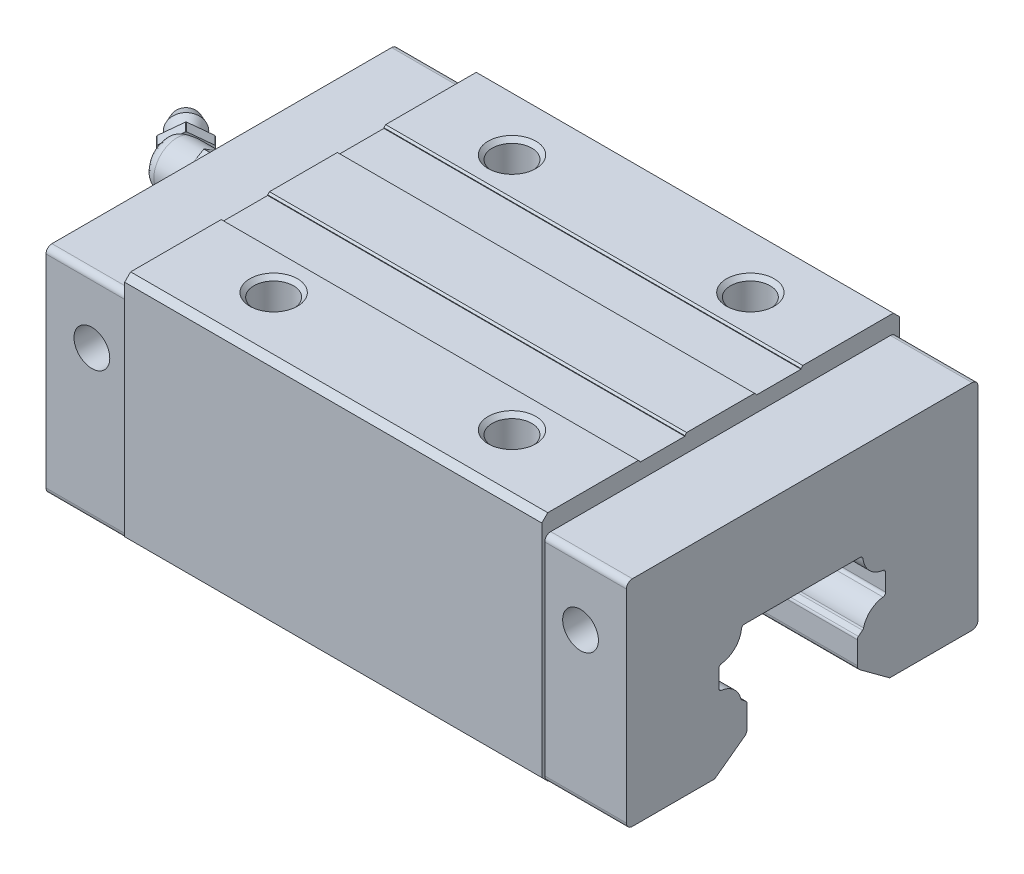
ISO-10303-21;
HEADER;
FILE_DESCRIPTION(('STEP AP214'),'2;1');
FILE_NAME('part.step','',(''),(''),'','','');
FILE_SCHEMA(('AUTOMOTIVE_DESIGN { 1 0 10303 214 1 1 1 1 }'));
ENDSEC;
DATA;
#1=APPLICATION_CONTEXT('core data for automotive mechanical design processes');
#2=APPLICATION_PROTOCOL_DEFINITION('international standard','automotive_design',2000,#1);
#3=PRODUCT_CONTEXT('',#1,'mechanical');
#4=PRODUCT('Part','Part','',(#3));
#5=PRODUCT_RELATED_PRODUCT_CATEGORY('part','',(#4));
#6=PRODUCT_DEFINITION_FORMATION('','',#4);
#7=PRODUCT_DEFINITION_CONTEXT('part definition',#1,'design');
#8=PRODUCT_DEFINITION('design','',#6,#7);
#9=PRODUCT_DEFINITION_SHAPE('','',#8);
#10=(LENGTH_UNIT() NAMED_UNIT(*) SI_UNIT(.MILLI.,.METRE.));
#11=(NAMED_UNIT(*) PLANE_ANGLE_UNIT() SI_UNIT($,.RADIAN.));
#12=(NAMED_UNIT(*) SI_UNIT($,.STERADIAN.) SOLID_ANGLE_UNIT());
#13=UNCERTAINTY_MEASURE_WITH_UNIT(LENGTH_MEASURE(1.E-05),#10,'distance_accuracy_value','');
#14=(GEOMETRIC_REPRESENTATION_CONTEXT(3) GLOBAL_UNCERTAINTY_ASSIGNED_CONTEXT((#13)) GLOBAL_UNIT_ASSIGNED_CONTEXT((#10,
#11,#12)) REPRESENTATION_CONTEXT('',''));
#15=CARTESIAN_POINT('',(0.,0.,0.));
#16=DIRECTION('',(0.,0.,1.));
#17=DIRECTION('',(1.,0.,0.));
#18=AXIS2_PLACEMENT_3D('',#15,#16,#17);
#19=CARTESIAN_POINT('',(-4.67157287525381,29.5,-4.32842712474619));
#20=DIRECTION('',(-0.707106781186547,0.,-0.707106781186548));
#21=DIRECTION('',(-0.707106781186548,0.,0.707106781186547));
#22=AXIS2_PLACEMENT_3D('',#19,#20,#21);
#23=PLANE('',#22);
#24=DIRECTION('',(0.,1.,0.));
#25=VECTOR('',#24,1.);
#26=CARTESIAN_POINT('',(-9.97487373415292,29.5,0.974873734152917));
#27=LINE('',#26,#25);
#28=CARTESIAN_POINT('',(-9.97487373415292,27.5635083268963,0.97487373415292));
#29=VERTEX_POINT('',#28);
#30=CARTESIAN_POINT('',(-9.97487373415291,31.4364916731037,0.974873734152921));
#31=VERTEX_POINT('',#30);
#32=EDGE_CURVE('E42',#29,#31,#27,.T.);
#33=ORIENTED_EDGE('',*,*,#32,.F.);
#34=CARTESIAN_POINT('',(-7.5,29.5,-1.5));
#35=DIRECTION('',(0.707106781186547,0.,0.707106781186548));
#36=DIRECTION('',(0.707106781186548,0.,-0.707106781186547));
#37=AXIS2_PLACEMENT_3D('',#34,#35,#36);
#38=CIRCLE('',#37,4.);
#39=CARTESIAN_POINT('',(-9.9232909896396,27.4371569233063,0.923290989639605));
#40=VERTEX_POINT('',#39);
#41=EDGE_CURVE('E10',#29,#40,#38,.T.);
#42=ORIENTED_EDGE('',*,*,#41,.T.);
#43=DIRECTION('',(-0.612372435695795,0.5,0.612372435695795));
#44=VECTOR('',#43,1.);
#45=CARTESIAN_POINT('',(-6.61611652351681,24.7368602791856,-2.38388347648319));
#46=LINE('',#45,#44);
#47=CARTESIAN_POINT('',(-9.40102717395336,27.0107303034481,0.401027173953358));
#48=VERTEX_POINT('',#47);
#49=EDGE_CURVE('E1071',#48,#40,#46,.T.);
#50=ORIENTED_EDGE('',*,*,#49,.F.);
#51=CARTESIAN_POINT('',(-9.5,27.6669697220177,0.500000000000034));
#52=CARTESIAN_POINT('',(-9.50000017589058,27.64319417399,0.49999985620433));
#53=CARTESIAN_POINT('',(-9.49960542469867,27.6194197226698,0.499602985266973));
#54=CARTESIAN_POINT('',(-9.49800430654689,27.570758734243,0.49799611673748));
#55=CARTESIAN_POINT('',(-9.49675914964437,27.5458747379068,0.496747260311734));
#56=CARTESIAN_POINT('',(-9.49335644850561,27.4950153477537,0.493338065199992));
#57=CARTESIAN_POINT('',(-9.49115761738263,27.4690454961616,0.491136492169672));
#58=CARTESIAN_POINT('',(-9.48574211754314,27.4160482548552,0.485717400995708));
#59=CARTESIAN_POINT('',(-9.48248173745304,27.3890297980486,0.482456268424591));
#60=CARTESIAN_POINT('',(-9.47483342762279,27.3339855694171,0.474808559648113));
#61=CARTESIAN_POINT('',(-9.47039946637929,27.3059725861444,0.470376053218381));
#62=CARTESIAN_POINT('',(-9.46029113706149,27.2490075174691,0.460272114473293));
#63=CARTESIAN_POINT('',(-9.45456858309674,27.220072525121,0.454552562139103));
#64=CARTESIAN_POINT('',(-9.4417683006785,27.1613523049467,0.441758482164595));
#65=CARTESIAN_POINT('',(-9.43464045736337,27.1315889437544,0.434633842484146));
#66=CARTESIAN_POINT('',(-9.41891469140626,27.0713213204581,0.41891305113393));
#67=CARTESIAN_POINT('',(-9.41026502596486,27.040844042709,0.410265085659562));
#68=CARTESIAN_POINT('',(-9.40102717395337,27.0107303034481,0.401027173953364));
#69=B_SPLINE_CURVE_WITH_KNOTS('',3,(#51,#52,#53,#54,#55,#56,#57,#58,#59,#60,#61,#62,#63,#64,#65,
#66,#67,#68),.UNSPECIFIED.,.F.,.F.,(4,2,2,2,2,2,2,2,4),(0.,0.0713186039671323,0.146128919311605,
0.224564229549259,0.306756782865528,0.39283632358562,0.482928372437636,0.577152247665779,
0.675618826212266),.UNSPECIFIED.);
#70=CARTESIAN_POINT('',(-9.5,27.6669697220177,0.5));
#71=VERTEX_POINT('',#70);
#72=EDGE_CURVE('E1738',#71,#48,#69,.T.);
#73=ORIENTED_EDGE('',*,*,#72,.F.);
#74=DIRECTION('',(0.,1.,0.));
#75=VECTOR('',#74,1.);
#76=CARTESIAN_POINT('',(-9.5,29.5,0.5));
#77=LINE('',#76,#75);
#78=CARTESIAN_POINT('',(-9.5,31.3330302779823,0.5));
#79=VERTEX_POINT('',#78);
#80=EDGE_CURVE('E29',#71,#79,#77,.T.);
#81=ORIENTED_EDGE('',*,*,#80,.T.);
#82=CARTESIAN_POINT('',(-9.40102717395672,31.989269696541,0.401027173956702));
#83=CARTESIAN_POINT('',(-9.41026502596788,31.9591559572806,0.410265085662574));
#84=CARTESIAN_POINT('',(-9.41891469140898,31.9286786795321,0.418913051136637));
#85=CARTESIAN_POINT('',(-9.43464045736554,31.8684110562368,0.434633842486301));
#86=CARTESIAN_POINT('',(-9.44176830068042,31.838647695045,0.441758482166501));
#87=CARTESIAN_POINT('',(-9.45456858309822,31.7799274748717,0.454552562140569));
#88=CARTESIAN_POINT('',(-9.46029113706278,31.7509924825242,0.460272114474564));
#89=CARTESIAN_POINT('',(-9.47039946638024,31.6940274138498,0.470376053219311));
#90=CARTESIAN_POINT('',(-9.47483342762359,31.6660144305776,0.474808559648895));
#91=CARTESIAN_POINT('',(-9.48248173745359,31.610970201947,0.482456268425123));
#92=CARTESIAN_POINT('',(-9.48574211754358,31.5839517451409,0.485717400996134));
#93=CARTESIAN_POINT('',(-9.4911576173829,31.5309545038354,0.491136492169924));
#94=CARTESIAN_POINT('',(-9.49335644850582,31.5049846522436,0.493338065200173));
#95=CARTESIAN_POINT('',(-9.49675914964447,31.4541252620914,0.496747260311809));
#96=CARTESIAN_POINT('',(-9.49800430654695,31.4292412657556,0.497996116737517));
#97=CARTESIAN_POINT('',(-9.49960542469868,31.3805802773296,0.499602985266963));
#98=CARTESIAN_POINT('',(-9.50000017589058,31.3568058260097,0.499999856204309));
#99=CARTESIAN_POINT('',(-9.5,31.3330302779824,0.500000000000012));
#100=B_SPLINE_CURVE_WITH_KNOTS('',3,(#82,#83,#84,#85,#86,#87,#88,#89,#90,#91,#92,#93,#94,#95,
#96,#97,#98,#99),.UNSPECIFIED.,.F.,.F.,(4,2,2,2,2,2,2,2,4),(0.,0.098466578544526,
0.192690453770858,0.282782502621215,0.368862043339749,0.451054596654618,0.529489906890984,
0.604300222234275,0.675618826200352),.UNSPECIFIED.);
#101=CARTESIAN_POINT('',(-9.40102717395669,31.989269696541,0.401027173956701));
#102=VERTEX_POINT('',#101);
#103=EDGE_CURVE('E1730',#102,#79,#100,.T.);
#104=ORIENTED_EDGE('',*,*,#103,.F.);
#105=DIRECTION('',(0.612372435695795,0.5,-0.612372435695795));
#106=VECTOR('',#105,1.);
#107=CARTESIAN_POINT('',(-6.61611652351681,34.2631397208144,-2.38388347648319));
#108=LINE('',#107,#106);
#109=CARTESIAN_POINT('',(-9.92329098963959,31.5628430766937,0.923290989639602));
#110=VERTEX_POINT('',#109);
#111=EDGE_CURVE('E1716',#110,#102,#108,.T.);
#112=ORIENTED_EDGE('',*,*,#111,.F.);
#113=CARTESIAN_POINT('',(-7.5,29.5,-1.5));
#114=DIRECTION('',(0.707106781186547,0.,0.707106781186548));
#115=DIRECTION('',(0.707106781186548,0.,-0.707106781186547));
#116=AXIS2_PLACEMENT_3D('',#113,#114,#115);
#117=CIRCLE('',#116,4.);
#118=EDGE_CURVE('E1272',#110,#31,#117,.T.);
#119=ORIENTED_EDGE('',*,*,#118,.T.);
#120=EDGE_LOOP('',(#33,#42,#50,#73,#81,#104,#112,#119));
#121=FACE_BOUND('',#120,.T.);
#122=ADVANCED_FACE('F16',(#121),#23,.F.);
#123=CARTESIAN_POINT('',(34.5728534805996,29.5,40.5728534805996));
#124=DIRECTION('',(-0.707106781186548,0.,-0.707106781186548));
#125=DIRECTION('',(0.707106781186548,0.,-0.707106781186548));
#126=AXIS2_PLACEMENT_3D('',#123,#124,#125);
#127=CYLINDRICAL_SURFACE('',#126,4.);
#128=DIRECTION('',(0.707106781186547,0.,0.707106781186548));
#129=VECTOR('',#128,1.);
#130=CARTESIAN_POINT('',(32.0979797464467,27.5635083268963,43.0477272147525));
#131=LINE('',#130,#129);
#132=CARTESIAN_POINT('',(-11.389087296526,27.5635083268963,-0.439339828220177));
#133=VERTEX_POINT('',#132);
#134=EDGE_CURVE('E1349',#133,#29,#131,.T.);
#135=ORIENTED_EDGE('',*,*,#134,.F.);
#136=CARTESIAN_POINT('',(-8.9142135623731,29.5,-2.91421356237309));
#137=DIRECTION('',(0.707106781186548,0.,0.707106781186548));
#138=DIRECTION('',(0.707106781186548,0.,-0.707106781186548));
#139=AXIS2_PLACEMENT_3D('',#136,#137,#138);
#140=CIRCLE('',#139,4.);
#141=CARTESIAN_POINT('',(-11.3375045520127,27.4371569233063,-0.490922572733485));
#142=VERTEX_POINT('',#141);
#143=EDGE_CURVE('E1275',#133,#142,#140,.T.);
#144=ORIENTED_EDGE('',*,*,#143,.T.);
#145=DIRECTION('',(-0.707106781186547,0.,-0.707106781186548));
#146=VECTOR('',#145,1.);
#147=CARTESIAN_POINT('',(32.14956249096,27.4371569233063,42.9961444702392));
#148=LINE('',#147,#146);
#149=EDGE_CURVE('E1068',#40,#142,#148,.T.);
#150=ORIENTED_EDGE('',*,*,#149,.F.);
#151=ORIENTED_EDGE('',*,*,#41,.F.);
#152=EDGE_LOOP('',(#135,#144,#150,#151));
#153=FACE_BOUND('',#152,.T.);
#154=ADVANCED_FACE('F1781',(#153),#127,.T.);
#155=CARTESIAN_POINT('',(-7.00502525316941,29.5,-4.82340187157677));
#156=DIRECTION('',(0.707106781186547,0.,0.707106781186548));
#157=DIRECTION('',(0.,-1.,0.));
#158=AXIS2_PLACEMENT_3D('',#155,#156,#157);
#159=PLANE('',#158);
#160=DIRECTION('',(0.,-1.,0.));
#161=VECTOR('',#160,1.);
#162=CARTESIAN_POINT('',(-6.43933982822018,31.5207259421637,-5.38908729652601));
#163=LINE('',#162,#161);
#164=CARTESIAN_POINT('',(-6.43933982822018,31.4364916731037,-5.38908729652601));
#165=VERTEX_POINT('',#164);
#166=CARTESIAN_POINT('',(-6.43933982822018,27.5635083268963,-5.38908729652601));
#167=VERTEX_POINT('',#166);
#168=EDGE_CURVE('E1515',#165,#167,#163,.T.);
#169=ORIENTED_EDGE('',*,*,#168,.T.);
#170=CARTESIAN_POINT('',(-8.9142135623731,29.5,-2.91421356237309));
#171=DIRECTION('',(0.707106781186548,0.,0.707106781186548));
#172=DIRECTION('',(0.707106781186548,0.,-0.707106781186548));
#173=AXIS2_PLACEMENT_3D('',#170,#171,#172);
#174=CIRCLE('',#173,4.);
#175=CARTESIAN_POINT('',(-6.49092257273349,27.4371569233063,-5.3375045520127));
#176=VERTEX_POINT('',#175);
#177=EDGE_CURVE('E1073',#176,#167,#174,.T.);
#178=ORIENTED_EDGE('',*,*,#177,.F.);
#179=DIRECTION('',(-0.612372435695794,-0.5,0.612372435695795));
#180=VECTOR('',#179,1.);
#181=CARTESIAN_POINT('',(-6.43933982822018,27.4792740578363,-5.38908729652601));
#182=LINE('',#181,#180);
#183=CARTESIAN_POINT('',(-8.86263081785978,25.5006652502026,-2.9657963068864));
#184=VERTEX_POINT('',#183);
#185=EDGE_CURVE('E928',#176,#184,#182,.T.);
#186=ORIENTED_EDGE('',*,*,#185,.T.);
#187=CARTESIAN_POINT('',(-8.9142135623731,29.5,-2.91421356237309));
#188=DIRECTION('',(0.707106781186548,0.,0.707106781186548));
#189=DIRECTION('',(0.707106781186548,0.,-0.707106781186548));
#190=AXIS2_PLACEMENT_3D('',#187,#188,#189);
#191=CIRCLE('',#190,4.);
#192=CARTESIAN_POINT('',(-8.96579630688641,25.5006652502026,-2.86263081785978));
#193=VERTEX_POINT('',#192);
#194=EDGE_CURVE('E1076',#193,#184,#191,.T.);
#195=ORIENTED_EDGE('',*,*,#194,.F.);
#196=DIRECTION('',(-0.612372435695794,0.5,0.612372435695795));
#197=VECTOR('',#196,1.);
#198=CARTESIAN_POINT('',(-8.91421356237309,25.4585481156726,-2.91421356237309));
#199=LINE('',#198,#197);
#200=EDGE_CURVE('E924',#193,#142,#199,.T.);
#201=ORIENTED_EDGE('',*,*,#200,.T.);
#202=ORIENTED_EDGE('',*,*,#143,.F.);
#203=DIRECTION('',(0.,1.,0.));
#204=VECTOR('',#203,1.);
#205=CARTESIAN_POINT('',(-11.389087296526,27.4792740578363,-0.439339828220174));
#206=LINE('',#205,#204);
#207=CARTESIAN_POINT('',(-11.389087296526,31.4364916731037,-0.439339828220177));
#208=VERTEX_POINT('',#207);
#209=EDGE_CURVE('E929',#133,#208,#206,.T.);
#210=ORIENTED_EDGE('',*,*,#209,.T.);
#211=CARTESIAN_POINT('',(-8.9142135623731,29.5,-2.91421356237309));
#212=DIRECTION('',(0.707106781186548,0.,0.707106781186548));
#213=DIRECTION('',(0.707106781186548,0.,-0.707106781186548));
#214=AXIS2_PLACEMENT_3D('',#211,#212,#213);
#215=CIRCLE('',#214,4.);
#216=CARTESIAN_POINT('',(-11.3375045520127,31.5628430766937,-0.490922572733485));
#217=VERTEX_POINT('',#216);
#218=EDGE_CURVE('E1409',#217,#208,#215,.T.);
#219=ORIENTED_EDGE('',*,*,#218,.F.);
#220=DIRECTION('',(0.612372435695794,0.5,-0.612372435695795));
#221=VECTOR('',#220,1.);
#222=CARTESIAN_POINT('',(-11.389087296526,31.5207259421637,-0.439339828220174));
#223=LINE('',#222,#221);
#224=CARTESIAN_POINT('',(-8.96579630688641,33.4993347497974,-2.86263081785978));
#225=VERTEX_POINT('',#224);
#226=EDGE_CURVE('E1005',#217,#225,#223,.T.);
#227=ORIENTED_EDGE('',*,*,#226,.T.);
#228=CARTESIAN_POINT('',(-8.9142135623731,29.5,-2.91421356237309));
#229=DIRECTION('',(0.707106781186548,0.,0.707106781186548));
#230=DIRECTION('',(0.707106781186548,0.,-0.707106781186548));
#231=AXIS2_PLACEMENT_3D('',#228,#229,#230);
#232=CIRCLE('',#231,4.);
#233=CARTESIAN_POINT('',(-8.86263081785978,33.4993347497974,-2.9657963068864));
#234=VERTEX_POINT('',#233);
#235=EDGE_CURVE('E2118',#234,#225,#232,.T.);
#236=ORIENTED_EDGE('',*,*,#235,.F.);
#237=DIRECTION('',(0.612372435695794,-0.5,-0.612372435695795));
#238=VECTOR('',#237,1.);
#239=CARTESIAN_POINT('',(-8.91421356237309,33.5414518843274,-2.91421356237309));
#240=LINE('',#239,#238);
#241=CARTESIAN_POINT('',(-6.4909225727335,31.5628430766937,-5.3375045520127));
#242=VERTEX_POINT('',#241);
#243=EDGE_CURVE('E1009',#234,#242,#240,.T.);
#244=ORIENTED_EDGE('',*,*,#243,.T.);
#245=CARTESIAN_POINT('',(-8.9142135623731,29.5,-2.91421356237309));
#246=DIRECTION('',(0.707106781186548,0.,0.707106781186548));
#247=DIRECTION('',(0.707106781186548,0.,-0.707106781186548));
#248=AXIS2_PLACEMENT_3D('',#245,#246,#247);
#249=CIRCLE('',#248,4.);
#250=EDGE_CURVE('E1077',#165,#242,#249,.T.);
#251=ORIENTED_EDGE('',*,*,#250,.F.);
#252=EDGE_LOOP('',(#169,#178,#186,#195,#201,#202,#210,#219,#227,#236,#244,#251));
#253=FACE_BOUND('',#252,.T.);
#254=CARTESIAN_POINT('',(-8.9142135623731,29.5,-2.91421356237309));
#255=DIRECTION('',(0.707106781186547,0.,0.707106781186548));
#256=DIRECTION('',(0.707106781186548,0.,-0.707106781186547));
#257=AXIS2_PLACEMENT_3D('',#254,#255,#256);
#258=CIRCLE('',#257,2.7);
#259=CARTESIAN_POINT('',(-7.00502525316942,29.5,-4.82340187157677));
#260=VERTEX_POINT('',#259);
#261=EDGE_CURVE('E972',#260,#260,#258,.T.);
#262=ORIENTED_EDGE('',*,*,#261,.T.);
#263=EDGE_LOOP('',(#262));
#264=FACE_BOUND('',#263,.T.);
#265=ADVANCED_FACE('F1844',(#253,#264),#159,.F.);
#266=CARTESIAN_POINT('',(-9.83345237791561,29.5,-3.83345237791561));
#267=DIRECTION('',(0.707106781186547,0.,0.707106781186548));
#268=DIRECTION('',(0.707106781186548,0.,-0.707106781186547));
#269=AXIS2_PLACEMENT_3D('',#266,#267,#268);
#270=CONICAL_SURFACE('',#269,2.,0.4939413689);
#271=ORIENTED_EDGE('',*,*,#261,.F.);
#272=EDGE_LOOP('',(#271));
#273=FACE_BOUND('',#272,.T.);
#274=CARTESIAN_POINT('',(-9.83345237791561,29.5,-3.83345237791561));
#275=DIRECTION('',(0.707106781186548,0.,0.707106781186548));
#276=DIRECTION('',(0.707106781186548,0.,-0.707106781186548));
#277=AXIS2_PLACEMENT_3D('',#274,#275,#276);
#278=CIRCLE('',#277,2.);
#279=CARTESIAN_POINT('',(-8.41923881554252,29.5,-5.24766594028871));
#280=VERTEX_POINT('',#279);
#281=EDGE_CURVE('E968',#280,#280,#278,.T.);
#282=ORIENTED_EDGE('',*,*,#281,.T.);
#283=EDGE_LOOP('',(#282));
#284=FACE_BOUND('',#283,.T.);
#285=ADVANCED_FACE('F1841',(#273,#284),#270,.T.);
#286=CARTESIAN_POINT('',(-11.601219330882,29.5,-5.60121933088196));
#287=DIRECTION('',(-0.707106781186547,0.,-0.707106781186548));
#288=DIRECTION('',(-0.707106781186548,0.,0.707106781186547));
#289=AXIS2_PLACEMENT_3D('',#286,#287,#288);
#290=CONICAL_SURFACE('',#289,2.7,0.2730087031);
#291=CARTESIAN_POINT('',(-11.601219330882,29.5,-5.60121933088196));
#292=DIRECTION('',(0.707106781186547,0.,0.707106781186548));
#293=DIRECTION('',(0.707106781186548,0.,-0.707106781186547));
#294=AXIS2_PLACEMENT_3D('',#291,#292,#293);
#295=CIRCLE('',#294,2.7);
#296=CARTESIAN_POINT('',(-9.69203102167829,29.5,-7.51040764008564));
#297=VERTEX_POINT('',#296);
#298=EDGE_CURVE('E973',#297,#297,#295,.T.);
#299=ORIENTED_EDGE('',*,*,#298,.T.);
#300=EDGE_LOOP('',(#299));
#301=FACE_BOUND('',#300,.T.);
#302=ORIENTED_EDGE('',*,*,#281,.F.);
#303=EDGE_LOOP('',(#302));
#304=FACE_BOUND('',#303,.T.);
#305=ADVANCED_FACE('F1683',(#301,#304),#290,.T.);
#306=CARTESIAN_POINT('',(-13.0154328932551,29.5,-7.01543289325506));
#307=DIRECTION('',(0.707106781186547,0.,0.707106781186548));
#308=DIRECTION('',(0.707106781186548,0.,-0.707106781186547));
#309=AXIS2_PLACEMENT_3D('',#306,#307,#308);
#310=CONICAL_SURFACE('',#309,2.,0.3366748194);
#311=ORIENTED_EDGE('',*,*,#298,.F.);
#312=EDGE_LOOP('',(#311));
#313=FACE_BOUND('',#312,.T.);
#314=CARTESIAN_POINT('',(-13.0154328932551,29.5,-7.01543289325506));
#315=DIRECTION('',(0.707106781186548,0.,0.707106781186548));
#316=DIRECTION('',(0.707106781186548,0.,-0.707106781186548));
#317=AXIS2_PLACEMENT_3D('',#314,#315,#316);
#318=CIRCLE('',#317,2.);
#319=CARTESIAN_POINT('',(-11.601219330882,29.5,-8.42964645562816));
#320=VERTEX_POINT('',#319);
#321=EDGE_CURVE('E1450',#320,#320,#318,.T.);
#322=ORIENTED_EDGE('',*,*,#321,.T.);
#323=EDGE_LOOP('',(#322));
#324=FACE_BOUND('',#323,.T.);
#325=ADVANCED_FACE('F1680',(#313,#324),#310,.T.);
#326=CARTESIAN_POINT('',(-13.0154328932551,29.5,-7.01543289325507));
#327=DIRECTION('',(0.707106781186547,0.,0.707106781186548));
#328=DIRECTION('',(0.,-1.,0.));
#329=AXIS2_PLACEMENT_3D('',#326,#327,#328);
#330=PLANE('',#329);
#331=ORIENTED_EDGE('',*,*,#321,.F.);
#332=EDGE_LOOP('',(#331));
#333=FACE_BOUND('',#332,.T.);
#334=ADVANCED_FACE('F1622',(#333),#330,.F.);
#335=CARTESIAN_POINT('',(-10.,31.7516660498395,3.9));
#336=DIRECTION('',(0.,0.,1.));
#337=DIRECTION('',(1.,0.,0.));
#338=AXIS2_PLACEMENT_3D('',#335,#336,#337);
#339=PLANE('',#338);
#340=DIRECTION('',(0.,-1.,0.));
#341=VECTOR('',#340,1.);
#342=CARTESIAN_POINT('',(-3.,29.5,3.9));
#343=LINE('',#342,#341);
#344=CARTESIAN_POINT('',(-3.,29.5,3.9));
#345=VERTEX_POINT('',#344);
#346=CARTESIAN_POINT('',(-3.,27.2550055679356,3.9));
#347=VERTEX_POINT('',#346);
#348=EDGE_CURVE('E1387',#345,#347,#343,.T.);
#349=ORIENTED_EDGE('',*,*,#348,.T.);
#350=DIRECTION('',(1.,0.,0.));
#351=VECTOR('',#350,1.);
#352=CARTESIAN_POINT('',(0.,27.2550055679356,3.9));
#353=LINE('',#352,#351);
#354=CARTESIAN_POINT('',(0.,27.2550055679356,3.9));
#355=VERTEX_POINT('',#354);
#356=EDGE_CURVE('E1176',#347,#355,#353,.T.);
#357=ORIENTED_EDGE('',*,*,#356,.T.);
#358=DIRECTION('',(0.,-1.,0.));
#359=VECTOR('',#358,1.);
#360=CARTESIAN_POINT('',(0.,31.7516660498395,3.9));
#361=LINE('',#360,#359);
#362=CARTESIAN_POINT('',(0.,31.7449944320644,3.9));
#363=VERTEX_POINT('',#362);
#364=EDGE_CURVE('E1423',#363,#355,#361,.T.);
#365=ORIENTED_EDGE('',*,*,#364,.F.);
#366=DIRECTION('',(-1.,0.,0.));
#367=VECTOR('',#366,1.);
#368=CARTESIAN_POINT('',(0.,31.7449944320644,3.9));
#369=LINE('',#368,#367);
#370=CARTESIAN_POINT('',(-3.,31.7449944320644,3.9));
#371=VERTEX_POINT('',#370);
#372=EDGE_CURVE('E1107',#363,#371,#369,.T.);
#373=ORIENTED_EDGE('',*,*,#372,.T.);
#374=DIRECTION('',(0.,-1.,0.));
#375=VECTOR('',#374,1.);
#376=CARTESIAN_POINT('',(-3.,29.5,3.9));
#377=LINE('',#376,#375);
#378=EDGE_CURVE('E1103',#371,#345,#377,.T.);
#379=ORIENTED_EDGE('',*,*,#378,.T.);
#380=EDGE_LOOP('',(#349,#357,#365,#373,#379));
#381=FACE_BOUND('',#380,.T.);
#382=ADVANCED_FACE('F1618',(#381),#339,.T.);
#383=CARTESIAN_POINT('',(-10.,34.0033320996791,0.));
#384=DIRECTION('',(0.,0.866025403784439,0.5));
#385=DIRECTION('',(1.,0.,0.));
#386=AXIS2_PLACEMENT_3D('',#383,#384,#385);
#387=PLANE('',#386);
#388=DIRECTION('',(0.,-0.5,0.866025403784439));
#389=VECTOR('',#388,1.);
#390=CARTESIAN_POINT('',(-3.,34.566248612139,-0.975));
#391=LINE('',#390,#389);
#392=CARTESIAN_POINT('',(-3.,32.8774990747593,1.95));
#393=VERTEX_POINT('',#392);
#394=CARTESIAN_POINT('',(-3.,31.7550018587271,3.89422220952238));
#395=VERTEX_POINT('',#394);
#396=EDGE_CURVE('E1108',#393,#395,#391,.T.);
#397=ORIENTED_EDGE('',*,*,#396,.T.);
#398=DIRECTION('',(1.,0.,0.));
#399=VECTOR('',#398,1.);
#400=CARTESIAN_POINT('',(0.,31.7550018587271,3.89422220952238));
#401=LINE('',#400,#399);
#402=CARTESIAN_POINT('',(0.,31.7550018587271,3.89422220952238));
#403=VERTEX_POINT('',#402);
#404=EDGE_CURVE('E1319',#395,#403,#401,.T.);
#405=ORIENTED_EDGE('',*,*,#404,.T.);
#406=DIRECTION('',(0.,-0.5,0.866025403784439));
#407=VECTOR('',#406,1.);
#408=CARTESIAN_POINT('',(0.,34.0033320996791,0.));
#409=LINE('',#408,#407);
#410=CARTESIAN_POINT('',(0.,33.9999962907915,0.00577779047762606));
#411=VERTEX_POINT('',#410);
#412=EDGE_CURVE('E1039',#411,#403,#409,.T.);
#413=ORIENTED_EDGE('',*,*,#412,.F.);
#414=DIRECTION('',(-1.,0.,0.));
#415=VECTOR('',#414,1.);
#416=CARTESIAN_POINT('',(0.,33.9999962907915,0.00577779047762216));
#417=LINE('',#416,#415);
#418=CARTESIAN_POINT('',(-3.,33.9999962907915,0.00577779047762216));
#419=VERTEX_POINT('',#418);
#420=EDGE_CURVE('E1315',#411,#419,#417,.T.);
#421=ORIENTED_EDGE('',*,*,#420,.T.);
#422=DIRECTION('',(0.,-0.5,0.866025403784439));
#423=VECTOR('',#422,1.);
#424=CARTESIAN_POINT('',(-3.,34.566248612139,-0.975));
#425=LINE('',#424,#423);
#426=EDGE_CURVE('E1250',#419,#393,#425,.T.);
#427=ORIENTED_EDGE('',*,*,#426,.T.);
#428=EDGE_LOOP('',(#397,#405,#413,#421,#427));
#429=FACE_BOUND('',#428,.T.);
#430=ADVANCED_FACE('F1621',(#429),#387,.T.);
#431=CARTESIAN_POINT('',(-10.,31.7516660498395,-3.9));
#432=DIRECTION('',(0.,0.866025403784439,-0.5));
#433=DIRECTION('',(-1.,0.,0.));
#434=AXIS2_PLACEMENT_3D('',#431,#432,#433);
#435=PLANE('',#434);
#436=DIRECTION('',(0.,0.5,0.866025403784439));
#437=VECTOR('',#436,1.);
#438=CARTESIAN_POINT('',(-3.,31.1887495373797,-4.875));
#439=LINE('',#438,#437);
#440=CARTESIAN_POINT('',(-3.,32.8774990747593,-1.95));
#441=VERTEX_POINT('',#440);
#442=CARTESIAN_POINT('',(-3.,33.9999962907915,-0.00577779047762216));
#443=VERTEX_POINT('',#442);
#444=EDGE_CURVE('E1246',#441,#443,#439,.T.);
#445=ORIENTED_EDGE('',*,*,#444,.T.);
#446=DIRECTION('',(1.,0.,0.));
#447=VECTOR('',#446,1.);
#448=CARTESIAN_POINT('',(0.,33.9999962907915,-0.00577779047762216));
#449=LINE('',#448,#447);
#450=CARTESIAN_POINT('',(0.,33.9999962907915,-0.00577779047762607));
#451=VERTEX_POINT('',#450);
#452=EDGE_CURVE('E1251',#443,#451,#449,.T.);
#453=ORIENTED_EDGE('',*,*,#452,.T.);
#454=DIRECTION('',(0.,0.5,0.866025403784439));
#455=VECTOR('',#454,1.);
#456=CARTESIAN_POINT('',(0.,31.7516660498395,-3.9));
#457=LINE('',#456,#455);
#458=CARTESIAN_POINT('',(0.,31.7550018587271,-3.89422220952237));
#459=VERTEX_POINT('',#458);
#460=EDGE_CURVE('E1036',#459,#451,#457,.T.);
#461=ORIENTED_EDGE('',*,*,#460,.F.);
#462=DIRECTION('',(-1.,0.,0.));
#463=VECTOR('',#462,1.);
#464=CARTESIAN_POINT('',(0.,31.7550018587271,-3.89422220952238));
#465=LINE('',#464,#463);
#466=CARTESIAN_POINT('',(-3.,31.7550018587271,-3.89422220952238));
#467=VERTEX_POINT('',#466);
#468=EDGE_CURVE('E1416',#459,#467,#465,.T.);
#469=ORIENTED_EDGE('',*,*,#468,.T.);
#470=DIRECTION('',(0.,0.5,0.866025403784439));
#471=VECTOR('',#470,1.);
#472=CARTESIAN_POINT('',(-3.,31.1887495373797,-4.875));
#473=LINE('',#472,#471);
#474=EDGE_CURVE('E1345',#467,#441,#473,.T.);
#475=ORIENTED_EDGE('',*,*,#474,.T.);
#476=EDGE_LOOP('',(#445,#453,#461,#469,#475));
#477=FACE_BOUND('',#476,.T.);
#478=ADVANCED_FACE('F1884',(#477),#435,.T.);
#479=CARTESIAN_POINT('',(-10.,27.2483339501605,-3.9));
#480=DIRECTION('',(0.,0.,-1.));
#481=DIRECTION('',(0.,-1.,0.));
#482=AXIS2_PLACEMENT_3D('',#479,#480,#481);
#483=PLANE('',#482);
#484=DIRECTION('',(0.,1.,0.));
#485=VECTOR('',#484,1.);
#486=CARTESIAN_POINT('',(-3.,29.5,-3.9));
#487=LINE('',#486,#485);
#488=CARTESIAN_POINT('',(-3.,29.5,-3.9));
#489=VERTEX_POINT('',#488);
#490=CARTESIAN_POINT('',(-3.,31.7449944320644,-3.9));
#491=VERTEX_POINT('',#490);
#492=EDGE_CURVE('E1255',#489,#491,#487,.T.);
#493=ORIENTED_EDGE('',*,*,#492,.T.);
#494=DIRECTION('',(1.,0.,0.));
#495=VECTOR('',#494,1.);
#496=CARTESIAN_POINT('',(0.,31.7449944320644,-3.9));
#497=LINE('',#496,#495);
#498=CARTESIAN_POINT('',(0.,31.7449944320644,-3.9));
#499=VERTEX_POINT('',#498);
#500=EDGE_CURVE('E1252',#491,#499,#497,.T.);
#501=ORIENTED_EDGE('',*,*,#500,.T.);
#502=DIRECTION('',(0.,1.,0.));
#503=VECTOR('',#502,1.);
#504=CARTESIAN_POINT('',(0.,27.2483339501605,-3.9));
#505=LINE('',#504,#503);
#506=CARTESIAN_POINT('',(0.,27.2550055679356,-3.9));
#507=VERTEX_POINT('',#506);
#508=EDGE_CURVE('E402',#507,#499,#505,.T.);
#509=ORIENTED_EDGE('',*,*,#508,.F.);
#510=DIRECTION('',(-1.,0.,0.));
#511=VECTOR('',#510,1.);
#512=CARTESIAN_POINT('',(0.,27.2550055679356,-3.9));
#513=LINE('',#512,#511);
#514=CARTESIAN_POINT('',(-3.,27.2550055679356,-3.9));
#515=VERTEX_POINT('',#514);
#516=EDGE_CURVE('E814',#507,#515,#513,.T.);
#517=ORIENTED_EDGE('',*,*,#516,.T.);
#518=DIRECTION('',(0.,1.,0.));
#519=VECTOR('',#518,1.);
#520=CARTESIAN_POINT('',(-3.,29.5,-3.9));
#521=LINE('',#520,#519);
#522=EDGE_CURVE('E810',#515,#489,#521,.T.);
#523=ORIENTED_EDGE('',*,*,#522,.T.);
#524=EDGE_LOOP('',(#493,#501,#509,#517,#523));
#525=FACE_BOUND('',#524,.T.);
#526=ADVANCED_FACE('F1887',(#525),#483,.T.);
#527=CARTESIAN_POINT('',(-10.,24.9966679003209,0.));
#528=DIRECTION('',(0.,-0.866025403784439,-0.5));
#529=DIRECTION('',(0.,0.5,-0.866025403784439));
#530=AXIS2_PLACEMENT_3D('',#527,#528,#529);
#531=PLANE('',#530);
#532=DIRECTION('',(0.,0.5,-0.866025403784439));
#533=VECTOR('',#532,1.);
#534=CARTESIAN_POINT('',(-3.,27.8112504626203,-4.875));
#535=LINE('',#534,#533);
#536=CARTESIAN_POINT('',(-3.,26.1225009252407,-1.95));
#537=VERTEX_POINT('',#536);
#538=CARTESIAN_POINT('',(-3.,27.2449981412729,-3.89422220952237));
#539=VERTEX_POINT('',#538);
#540=EDGE_CURVE('E815',#537,#539,#535,.T.);
#541=ORIENTED_EDGE('',*,*,#540,.T.);
#542=DIRECTION('',(1.,0.,0.));
#543=VECTOR('',#542,1.);
#544=CARTESIAN_POINT('',(0.,27.2449981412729,-3.89422220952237));
#545=LINE('',#544,#543);
#546=CARTESIAN_POINT('',(0.,27.2449981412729,-3.89422220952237));
#547=VERTEX_POINT('',#546);
#548=EDGE_CURVE('E808',#539,#547,#545,.T.);
#549=ORIENTED_EDGE('',*,*,#548,.T.);
#550=DIRECTION('',(0.,0.5,-0.866025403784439));
#551=VECTOR('',#550,1.);
#552=CARTESIAN_POINT('',(0.,24.9966679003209,0.));
#553=LINE('',#552,#551);
#554=CARTESIAN_POINT('',(0.,25.0000037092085,-0.00577779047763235));
#555=VERTEX_POINT('',#554);
#556=EDGE_CURVE('E1147',#555,#547,#553,.T.);
#557=ORIENTED_EDGE('',*,*,#556,.F.);
#558=DIRECTION('',(-1.,0.,0.));
#559=VECTOR('',#558,1.);
#560=CARTESIAN_POINT('',(0.,25.0000037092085,-0.00577779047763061));
#561=LINE('',#560,#559);
#562=CARTESIAN_POINT('',(-3.,25.0000037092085,-0.00577779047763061));
#563=VERTEX_POINT('',#562);
#564=EDGE_CURVE('E804',#555,#563,#561,.T.);
#565=ORIENTED_EDGE('',*,*,#564,.T.);
#566=DIRECTION('',(0.,0.5,-0.866025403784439));
#567=VECTOR('',#566,1.);
#568=CARTESIAN_POINT('',(-3.,27.8112504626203,-4.875));
#569=LINE('',#568,#567);
#570=EDGE_CURVE('E809',#563,#537,#569,.T.);
#571=ORIENTED_EDGE('',*,*,#570,.T.);
#572=EDGE_LOOP('',(#541,#549,#557,#565,#571));
#573=FACE_BOUND('',#572,.T.);
#574=ADVANCED_FACE('F1908',(#573),#531,.T.);
#575=CARTESIAN_POINT('',(-10.,27.2483339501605,3.9));
#576=DIRECTION('',(0.,-0.866025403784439,0.5));
#577=DIRECTION('',(-1.,0.,0.));
#578=AXIS2_PLACEMENT_3D('',#575,#576,#577);
#579=PLANE('',#578);
#580=DIRECTION('',(0.,-0.5,-0.866025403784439));
#581=VECTOR('',#580,1.);
#582=CARTESIAN_POINT('',(-3.,24.433751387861,-0.975));
#583=LINE('',#582,#581);
#584=CARTESIAN_POINT('',(-3.,26.1225009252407,1.95));
#585=VERTEX_POINT('',#584);
#586=CARTESIAN_POINT('',(-3.,25.0000037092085,0.00577779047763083));
#587=VERTEX_POINT('',#586);
#588=EDGE_CURVE('E1078',#585,#587,#583,.T.);
#589=ORIENTED_EDGE('',*,*,#588,.T.);
#590=DIRECTION('',(1.,0.,0.));
#591=VECTOR('',#590,1.);
#592=CARTESIAN_POINT('',(0.,25.0000037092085,0.00577779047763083));
#593=LINE('',#592,#591);
#594=CARTESIAN_POINT('',(0.,25.0000037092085,0.00577779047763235));
#595=VERTEX_POINT('',#594);
#596=EDGE_CURVE('E1082',#587,#595,#593,.T.);
#597=ORIENTED_EDGE('',*,*,#596,.T.);
#598=DIRECTION('',(0.,-0.5,-0.866025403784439));
#599=VECTOR('',#598,1.);
#600=CARTESIAN_POINT('',(0.,27.2483339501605,3.9));
#601=LINE('',#600,#599);
#602=CARTESIAN_POINT('',(0.,27.2449981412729,3.89422220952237));
#603=VERTEX_POINT('',#602);
#604=EDGE_CURVE('E1353',#603,#595,#601,.T.);
#605=ORIENTED_EDGE('',*,*,#604,.F.);
#606=DIRECTION('',(-1.,0.,0.));
#607=VECTOR('',#606,1.);
#608=CARTESIAN_POINT('',(0.,27.2449981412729,3.89422220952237));
#609=LINE('',#608,#607);
#610=CARTESIAN_POINT('',(-3.,27.2449981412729,3.89422220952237));
#611=VERTEX_POINT('',#610);
#612=EDGE_CURVE('E880',#603,#611,#609,.T.);
#613=ORIENTED_EDGE('',*,*,#612,.T.);
#614=DIRECTION('',(0.,-0.5,-0.866025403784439));
#615=VECTOR('',#614,1.);
#616=CARTESIAN_POINT('',(-3.,24.433751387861,-0.975));
#617=LINE('',#616,#615);
#618=EDGE_CURVE('E876',#611,#585,#617,.T.);
#619=ORIENTED_EDGE('',*,*,#618,.T.);
#620=EDGE_LOOP('',(#589,#597,#605,#613,#619));
#621=FACE_BOUND('',#620,.T.);
#622=ADVANCED_FACE('F1646',(#621),#579,.T.);
#623=CARTESIAN_POINT('',(0.,29.5,0.));
#624=DIRECTION('',(-1.,0.,0.));
#625=DIRECTION('',(0.,0.,-1.));
#626=AXIS2_PLACEMENT_3D('',#623,#624,#625);
#627=CYLINDRICAL_SURFACE('',#626,4.5);
#628=ORIENTED_EDGE('',*,*,#356,.F.);
#629=CARTESIAN_POINT('',(-3.,29.5,0.));
#630=DIRECTION('',(1.,0.,0.));
#631=DIRECTION('',(0.,0.,-1.));
#632=AXIS2_PLACEMENT_3D('',#629,#630,#631);
#633=CIRCLE('',#632,4.5);
#634=EDGE_CURVE('E881',#347,#611,#633,.T.);
#635=ORIENTED_EDGE('',*,*,#634,.T.);
#636=ORIENTED_EDGE('',*,*,#612,.F.);
#637=CARTESIAN_POINT('',(0.,29.5,0.));
#638=DIRECTION('',(-1.,0.,0.));
#639=DIRECTION('',(0.,0.,-1.));
#640=AXIS2_PLACEMENT_3D('',#637,#638,#639);
#641=CIRCLE('',#640,4.5);
#642=EDGE_CURVE('E1360',#603,#355,#641,.T.);
#643=ORIENTED_EDGE('',*,*,#642,.T.);
#644=EDGE_LOOP('',(#628,#635,#636,#643));
#645=FACE_BOUND('',#644,.T.);
#646=ADVANCED_FACE('F1642',(#645),#627,.T.);
#647=CARTESIAN_POINT('',(-3.,29.5,-3.9));
#648=DIRECTION('',(1.,0.,0.));
#649=DIRECTION('',(0.,1.,0.));
#650=AXIS2_PLACEMENT_3D('',#647,#648,#649);
#651=PLANE('',#650);
#652=ORIENTED_EDGE('',*,*,#378,.F.);
#653=CARTESIAN_POINT('',(-3.,29.5,0.));
#654=DIRECTION('',(1.,0.,0.));
#655=DIRECTION('',(0.,0.,-1.));
#656=AXIS2_PLACEMENT_3D('',#653,#654,#655);
#657=CIRCLE('',#656,4.5);
#658=EDGE_CURVE('E841',#395,#371,#657,.T.);
#659=ORIENTED_EDGE('',*,*,#658,.F.);
#660=ORIENTED_EDGE('',*,*,#396,.F.);
#661=CARTESIAN_POINT('',(-3.,29.5,0.));
#662=DIRECTION('',(1.,0.,0.));
#663=DIRECTION('',(0.,0.,-1.));
#664=AXIS2_PLACEMENT_3D('',#661,#662,#663);
#665=CIRCLE('',#664,3.9);
#666=EDGE_CURVE('E1405',#393,#345,#665,.T.);
#667=ORIENTED_EDGE('',*,*,#666,.T.);
#668=EDGE_LOOP('',(#652,#659,#660,#667));
#669=FACE_BOUND('',#668,.T.);
#670=ADVANCED_FACE('F1645',(#669),#651,.F.);
#671=CARTESIAN_POINT('',(0.,29.5,0.));
#672=DIRECTION('',(-1.,0.,0.));
#673=DIRECTION('',(0.,0.,-1.));
#674=AXIS2_PLACEMENT_3D('',#671,#672,#673);
#675=CYLINDRICAL_SURFACE('',#674,3.9);
#676=CARTESIAN_POINT('',(-7.5,29.5,0.));
#677=DIRECTION('',(1.,0.,0.));
#678=DIRECTION('',(0.,0.,-1.));
#679=AXIS2_PLACEMENT_3D('',#676,#677,#678);
#680=CIRCLE('',#679,3.9);
#681=CARTESIAN_POINT('',(-7.5,33.1,-1.5));
#682=VERTEX_POINT('',#681);
#683=CARTESIAN_POINT('',(-7.5,25.9,-1.5));
#684=VERTEX_POINT('',#683);
#685=EDGE_CURVE('E1408',#682,#684,#680,.T.);
#686=ORIENTED_EDGE('',*,*,#685,.T.);
#687=CARTESIAN_POINT('',(-9.,29.5,0.));
#688=DIRECTION('',(-0.707106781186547,0.,-0.707106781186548));
#689=DIRECTION('',(0.707106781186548,0.,-0.707106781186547));
#690=AXIS2_PLACEMENT_3D('',#687,#688,#689);
#691=ELLIPSE('',#690,5.5154328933,3.9);
#692=EDGE_CURVE('E1162',#682,#684,#691,.T.);
#693=ORIENTED_EDGE('',*,*,#692,.F.);
#694=EDGE_LOOP('',(#686,#693));
#695=FACE_BOUND('',#694,.T.);
#696=CARTESIAN_POINT('',(-3.,29.5,0.));
#697=DIRECTION('',(1.,0.,0.));
#698=DIRECTION('',(0.,0.,-1.));
#699=AXIS2_PLACEMENT_3D('',#696,#697,#698);
#700=CIRCLE('',#699,3.9);
#701=EDGE_CURVE('E2208',#345,#585,#700,.T.);
#702=ORIENTED_EDGE('',*,*,#701,.F.);
#703=ORIENTED_EDGE('',*,*,#666,.F.);
#704=CARTESIAN_POINT('',(-3.,29.5,0.));
#705=DIRECTION('',(1.,0.,0.));
#706=DIRECTION('',(0.,0.,-1.));
#707=AXIS2_PLACEMENT_3D('',#704,#705,#706);
#708=CIRCLE('',#707,3.9);
#709=EDGE_CURVE('E875',#441,#393,#708,.T.);
#710=ORIENTED_EDGE('',*,*,#709,.F.);
#711=CARTESIAN_POINT('',(-3.,29.5,0.));
#712=DIRECTION('',(1.,0.,0.));
#713=DIRECTION('',(0.,0.,-1.));
#714=AXIS2_PLACEMENT_3D('',#711,#712,#713);
#715=CIRCLE('',#714,3.9);
#716=EDGE_CURVE('E874',#489,#441,#715,.T.);
#717=ORIENTED_EDGE('',*,*,#716,.F.);
#718=CARTESIAN_POINT('',(-3.,29.5,0.));
#719=DIRECTION('',(1.,0.,0.));
#720=DIRECTION('',(0.,0.,-1.));
#721=AXIS2_PLACEMENT_3D('',#718,#719,#720);
#722=CIRCLE('',#721,3.9);
#723=EDGE_CURVE('E870',#537,#489,#722,.T.);
#724=ORIENTED_EDGE('',*,*,#723,.F.);
#725=CARTESIAN_POINT('',(-3.,29.5,0.));
#726=DIRECTION('',(1.,0.,0.));
#727=DIRECTION('',(0.,0.,-1.));
#728=AXIS2_PLACEMENT_3D('',#725,#726,#727);
#729=CIRCLE('',#728,3.9);
#730=EDGE_CURVE('E1023',#585,#537,#729,.T.);
#731=ORIENTED_EDGE('',*,*,#730,.F.);
#732=EDGE_LOOP('',(#702,#703,#710,#717,#724,#731));
#733=FACE_BOUND('',#732,.T.);
#734=ADVANCED_FACE('F1545',(#695,#733),#675,.T.);
#735=CARTESIAN_POINT('',(-7.5,33.0636213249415,-1.58448826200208));
#736=CARTESIAN_POINT('',(-7.50000000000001,34.3352380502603,1.27546380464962));
#737=CARTESIAN_POINT('',(-7.50000000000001,32.6299097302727,3.9));
#738=CARTESIAN_POINT('',(-7.5,29.5,3.9));
#739=CARTESIAN_POINT('',(-7.50000000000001,26.3700902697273,3.9));
#740=CARTESIAN_POINT('',(-7.50000000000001,24.6647619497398,1.27546380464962));
#741=CARTESIAN_POINT('',(-7.5,25.9363786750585,-1.58448826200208));
#742=CARTESIAN_POINT('',(-8.67157287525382,33.0636213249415,-1.58448826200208));
#743=CARTESIAN_POINT('',(-8.67157287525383,34.3352380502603,1.27546380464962));
#744=CARTESIAN_POINT('',(-8.67157287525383,32.6299097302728,3.9));
#745=CARTESIAN_POINT('',(-8.67157287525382,29.5,3.9));
#746=CARTESIAN_POINT('',(-8.67157287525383,26.3700902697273,3.9));
#747=CARTESIAN_POINT('',(-8.67157287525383,24.6647619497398,1.27546380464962));
#748=CARTESIAN_POINT('',(-8.67157287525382,25.9363786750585,-1.58448826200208));
#749=CARTESIAN_POINT('',(-9.50000000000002,32.3066468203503,-1.24791568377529));
#750=CARTESIAN_POINT('',(-9.50000000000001,33.308150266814,1.00453333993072));
#751=CARTESIAN_POINT('',(-9.50000000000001,31.9650630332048,3.07157287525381));
#752=CARTESIAN_POINT('',(-9.50000000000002,29.5,3.07157287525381));
#753=CARTESIAN_POINT('',(-9.50000000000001,27.0349369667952,3.07157287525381));
#754=CARTESIAN_POINT('',(-9.50000000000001,25.691849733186,1.00453333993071));
#755=CARTESIAN_POINT('',(-9.50000000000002,26.6933531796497,-1.24791568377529));
#756=CARTESIAN_POINT('',(-9.5,31.2361232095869,-0.771930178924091));
#757=CARTESIAN_POINT('',(-9.5,31.8556287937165,0.6213798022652));
#758=CARTESIAN_POINT('',(-9.5,31.0248278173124,1.9));
#759=CARTESIAN_POINT('',(-9.5,29.5,1.9));
#760=CARTESIAN_POINT('',(-9.5,27.9751721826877,1.9));
#761=CARTESIAN_POINT('',(-9.5,27.1443712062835,0.621379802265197));
#762=CARTESIAN_POINT('',(-9.5,27.7638767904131,-0.771930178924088));
#763=(BOUNDED_SURFACE() B_SPLINE_SURFACE(3,3,((#735,#736,#737,#738,#739,#740,#741),(#742,#743,
#744,#745,#746,#747,#748),(#749,#750,#751,#752,#753,#754,#755),(#756,#757,#758,#759,#760,#761,
#762)),.UNSPECIFIED.,.F.,.F.,.F.) B_SPLINE_SURFACE_WITH_KNOTS((4,4),(4,3,4),(1.1524181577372,
5.13076714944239),(-1.5707963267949,-0.785398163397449,0.),
.UNSPECIFIED.) GEOMETRIC_REPRESENTATION_ITEM() RATIONAL_B_SPLINE_SURFACE(((1.,0.696566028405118,
0.696566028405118,1.,0.696566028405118,0.696566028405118,1.),(0.804737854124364,
0.560553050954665,0.560553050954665,0.804737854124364,0.560553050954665,0.560553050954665,
0.804737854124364),(0.804737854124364,0.560553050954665,0.560553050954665,0.804737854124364,
0.560553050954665,0.560553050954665,0.804737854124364),(1.,0.696566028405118,0.696566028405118,
1.,0.696566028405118,0.696566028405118,1.))) REPRESENTATION_ITEM('') SURFACE());
#764=CARTESIAN_POINT('',(-7.5,33.1,-1.50000000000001));
#765=CARTESIAN_POINT('',(-7.51620648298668,33.1067528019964,-1.48379351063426));
#766=CARTESIAN_POINT('',(-7.53247856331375,33.11319095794,-1.46752128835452));
#767=CARTESIAN_POINT('',(-7.56536044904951,33.125510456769,-1.43463899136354));
#768=CARTESIAN_POINT('',(-7.58197186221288,33.1313832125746,-1.41802730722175));
#769=CARTESIAN_POINT('',(-7.61552409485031,33.1425360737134,-1.38447455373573));
#770=CARTESIAN_POINT('',(-7.63246637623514,33.1478073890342,-1.36753202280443));
#771=CARTESIAN_POINT('',(-7.66667016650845,33.1577210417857,-1.33332785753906));
#772=CARTESIAN_POINT('',(-7.68393297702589,33.1623544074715,-1.31606492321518));
#773=CARTESIAN_POINT('',(-7.71876580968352,33.1709553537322,-1.28123202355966));
#774=CARTESIAN_POINT('',(-7.73633696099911,33.1749138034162,-1.26366093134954));
#775=CARTESIAN_POINT('',(-7.77177246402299,33.1821278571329,-1.22822571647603));
#776=CARTESIAN_POINT('',(-7.78963776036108,33.1853741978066,-1.21036065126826));
#777=CARTESIAN_POINT('',(-7.82564549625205,33.1911268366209,-1.17435346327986));
#778=CARTESIAN_POINT('',(-7.84378868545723,33.1936237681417,-1.15621059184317));
#779=CARTESIAN_POINT('',(-7.88033383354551,33.1978407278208,-1.11966595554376));
#780=CARTESIAN_POINT('',(-7.8987363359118,33.199551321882,-1.1012636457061));
#781=CARTESIAN_POINT('',(-7.9171535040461,33.2008474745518,-1.082846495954));
#782=B_SPLINE_CURVE_WITH_KNOTS('',3,(#764,#765,#766,#767,#768,#769,#770,#771,#772,#773,#774,
#775,#776,#777,#778,#779,#780,#781),.UNSPECIFIED.,.F.,.F.,(4,2,2,2,2,2,2,2,4),(0.,
0.0716785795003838,0.14431467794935,0.217904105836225,0.292440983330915,0.367917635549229,
0.444324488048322,0.521649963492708,0.59988038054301),.UNSPECIFIED.);
#783=CARTESIAN_POINT('',(-7.917153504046,33.2008474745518,-1.082846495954));
#784=VERTEX_POINT('',#783);
#785=EDGE_CURVE('E1525',#682,#784,#782,.T.);
#786=CARTESIAN_POINT('',(-7.917153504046,33.2008474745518,-1.082846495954));
#787=CARTESIAN_POINT('',(-7.9354765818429,33.2021372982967,-1.06452337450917));
#788=CARTESIAN_POINT('',(-7.95381268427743,33.2030176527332,-1.04618412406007));
#789=CARTESIAN_POINT('',(-7.99061051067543,33.2039554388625,-1.009375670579));
#790=CARTESIAN_POINT('',(-8.00907228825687,33.2040075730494,-0.9909063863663));
#791=CARTESIAN_POINT('',(-8.04609769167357,33.2032659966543,-0.953863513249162));
#792=CARTESIAN_POINT('',(-8.06466125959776,33.2024671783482,-0.935289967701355));
#793=CARTESIAN_POINT('',(-8.10186471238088,33.2000026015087,-0.898065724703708));
#794=CARTESIAN_POINT('',(-8.12050443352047,33.1983319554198,-0.879415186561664));
#795=CARTESIAN_POINT('',(-8.15783313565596,33.194104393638,-0.84206543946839));
#796=CARTESIAN_POINT('',(-8.1765218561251,33.1915428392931,-0.82336649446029));
#797=CARTESIAN_POINT('',(-8.213919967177,33.1855161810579,-0.785949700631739));
#798=CARTESIAN_POINT('',(-8.23262901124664,33.1820467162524,-0.767232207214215));
#799=CARTESIAN_POINT('',(-8.27003772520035,33.1741891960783,-0.729809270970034));
#800=CARTESIAN_POINT('',(-8.28873697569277,33.1697970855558,-0.711104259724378));
#801=CARTESIAN_POINT('',(-8.32609467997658,33.1600816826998,-0.673738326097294));
#802=CARTESIAN_POINT('',(-8.34475265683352,33.1547546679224,-0.655077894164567));
#803=CARTESIAN_POINT('',(-8.38199511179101,33.1431595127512,-0.617834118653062));
#804=CARTESIAN_POINT('',(-8.40057907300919,33.1368880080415,-0.599251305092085));
#805=CARTESIAN_POINT('',(-8.43763962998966,33.1233967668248,-0.562196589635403));
#806=CARTESIAN_POINT('',(-8.45611568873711,33.1161740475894,-0.543725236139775));
#807=CARTESIAN_POINT('',(-8.49292554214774,33.1007762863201,-0.506927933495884));
#808=CARTESIAN_POINT('',(-8.51125880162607,33.0925986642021,-0.488602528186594));
#809=CARTESIAN_POINT('',(-8.54774727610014,33.075290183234,-0.452132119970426));
#810=CARTESIAN_POINT('',(-8.56590198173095,33.0661571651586,-0.433987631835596));
#811=CARTESIAN_POINT('',(-8.60199685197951,33.046940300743,-0.397914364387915));
#812=CARTESIAN_POINT('',(-8.61993655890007,33.0368547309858,-0.379986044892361));
#813=CARTESIAN_POINT('',(-8.65556440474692,33.0157386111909,-0.34438059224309));
#814=CARTESIAN_POINT('',(-8.67325216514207,33.0047067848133,-0.326703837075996));
#815=CARTESIAN_POINT('',(-8.70833874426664,32.9817075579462,-0.291636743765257));
#816=CARTESIAN_POINT('',(-8.725737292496,32.9697393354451,-0.274246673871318));
#817=CARTESIAN_POINT('',(-8.76020798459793,32.9448802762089,-0.239788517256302));
#818=CARTESIAN_POINT('',(-8.77727999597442,32.9319890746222,-0.222720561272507));
#819=CARTESIAN_POINT('',(-8.81321044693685,32.9036020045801,-0.186788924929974));
#820=CARTESIAN_POINT('',(-8.83201987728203,32.8879834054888,-0.167973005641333));
#821=CARTESIAN_POINT('',(-8.8688415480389,32.8558696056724,-0.131129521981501));
#822=CARTESIAN_POINT('',(-8.88686173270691,32.8393924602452,-0.113094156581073));
#823=CARTESIAN_POINT('',(-8.92208398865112,32.8056403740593,-0.0778378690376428));
#824=CARTESIAN_POINT('',(-8.93929470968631,32.7883834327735,-0.060608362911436));
#825=CARTESIAN_POINT('',(-8.97288114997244,32.7531519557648,-0.0269841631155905));
#826=CARTESIAN_POINT('',(-8.98926620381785,32.7351952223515,-0.0105801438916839));
#827=CARTESIAN_POINT('',(-9.02118907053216,32.6986444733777,0.0213780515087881));
#828=CARTESIAN_POINT('',(-9.03673686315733,32.6800679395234,0.0369422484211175));
#829=CARTESIAN_POINT('',(-9.06697732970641,32.6423574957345,0.0672110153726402));
#830=CARTESIAN_POINT('',(-9.08168058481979,32.6232406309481,0.0819262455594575));
#831=CARTESIAN_POINT('',(-9.11022835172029,32.5845283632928,0.11049230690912));
#832=CARTESIAN_POINT('',(-9.12408399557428,32.5649494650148,0.124354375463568));
#833=CARTESIAN_POINT('',(-9.1509369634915,32.5253903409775,0.151214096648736));
#834=CARTESIAN_POINT('',(-9.16394591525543,32.5054259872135,0.164223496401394));
#835=CARTESIAN_POINT('',(-9.18910974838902,32.4651710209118,0.189382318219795));
#836=CARTESIAN_POINT('',(-9.2012766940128,32.4448955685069,0.201543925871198));
#837=CARTESIAN_POINT('',(-9.2247643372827,32.4040908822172,0.22501572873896));
#838=CARTESIAN_POINT('',(-9.23609747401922,32.3835760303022,0.236338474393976));
#839=CARTESIAN_POINT('',(-9.25792862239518,32.3423620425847,0.258144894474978));
#840=CARTESIAN_POINT('',(-9.2684393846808,32.3216764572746,0.268641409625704));
#841=CARTESIAN_POINT('',(-9.28863992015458,32.2801872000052,0.288811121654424));
#842=CARTESIAN_POINT('',(-9.2983426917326,32.2593962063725,0.298497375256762));
#843=CARTESIAN_POINT('',(-9.31694409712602,32.217758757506,0.317065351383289));
#844=CARTESIAN_POINT('',(-9.32585591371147,32.1969240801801,0.325960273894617));
#845=CARTESIAN_POINT('',(-9.34289467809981,32.1552581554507,0.342967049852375));
#846=CARTESIAN_POINT('',(-9.35103493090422,32.1344377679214,0.351092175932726));
#847=CARTESIAN_POINT('',(-9.366551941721,32.0928552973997,0.366583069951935));
#848=CARTESIAN_POINT('',(-9.37394206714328,32.0721031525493,0.373962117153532));
#849=CARTESIAN_POINT('',(-9.38798204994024,32.0307084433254,0.387986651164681));
#850=CARTESIAN_POINT('',(-9.39464527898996,32.0100748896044,0.394645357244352));
#851=CARTESIAN_POINT('',(-9.40102717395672,31.989269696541,0.401027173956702));
#852=B_SPLINE_CURVE_WITH_KNOTS('',3,(#786,#787,#788,#789,#790,#791,#792,#793,#794,#795,#796,
#797,#798,#799,#800,#801,#802,#803,#804,#805,#806,#807,#808,#809,#810,#811,#812,#813,#814,#815,
#816,#817,#818,#819,#820,#821,#822,#823,#824,#825,#826,#827,#828,#829,#830,#831,#832,#833,#834,
#835,#836,#837,#838,#839,#840,#841,#842,#843,#844,#845,#846,#847,#848,#849,#850,#851),
.UNSPECIFIED.,.F.,.F.,(4,2,2,2,2,2,2,2,2,2,2,2,2,2,2,2,2,2,2,2,2,2,2,2,2,2,2,2,2,2,2,2,4),(0.,
0.0778316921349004,0.156161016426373,0.234963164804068,0.314211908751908,0.393879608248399,
0.473937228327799,0.554354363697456,0.63509927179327,0.71613891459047,0.797439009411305,
0.878964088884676,0.960677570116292,1.04254183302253,1.12451830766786,1.20656757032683,
1.2886494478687,1.38117279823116,1.47221367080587,1.56172869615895,1.64967995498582,
1.73603492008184,1.82076635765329,1.90385219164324,1.98527533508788,2.06502349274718,
2.14308893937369,2.21946827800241,2.2941621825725,2.36717512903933,2.43851511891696,
2.50819339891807,2.57622418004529),.UNSPECIFIED.);
#853=EDGE_CURVE('E1734',#784,#102,#852,.T.);
#854=CARTESIAN_POINT('',(-9.5,29.5,0.));
#855=DIRECTION('',(1.,0.,0.));
#856=DIRECTION('',(0.,0.,-1.));
#857=AXIS2_PLACEMENT_3D('',#854,#855,#856);
#858=CIRCLE('',#857,1.9);
#859=EDGE_CURVE('E1733',#79,#71,#858,.T.);
#860=CARTESIAN_POINT('',(-9.40102717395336,27.0107303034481,0.401027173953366));
#861=CARTESIAN_POINT('',(-9.39463790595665,26.989901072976,0.394637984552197));
#862=CARTESIAN_POINT('',(-9.38796665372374,26.9692438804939,0.38797126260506));
#863=CARTESIAN_POINT('',(-9.37390896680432,26.9278015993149,0.3739290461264));
#864=CARTESIAN_POINT('',(-9.36650911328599,26.9070255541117,0.366540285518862));
#865=CARTESIAN_POINT('',(-9.35097090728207,26.8653951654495,0.351028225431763));
#866=CARTESIAN_POINT('',(-9.34281914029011,26.8445507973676,0.342891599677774));
#867=CARTESIAN_POINT('',(-9.32575553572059,26.802836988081,0.325860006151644));
#868=CARTESIAN_POINT('',(-9.31683034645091,26.781978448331,0.316951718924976));
#869=CARTESIAN_POINT('',(-9.29820032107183,26.740293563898,0.298355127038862));
#870=CARTESIAN_POINT('',(-9.28848225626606,26.7194790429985,0.288653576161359));
#871=CARTESIAN_POINT('',(-9.26824920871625,26.6779432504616,0.268451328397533));
#872=CARTESIAN_POINT('',(-9.25772118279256,26.6572347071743,0.257937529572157));
#873=CARTESIAN_POINT('',(-9.23585354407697,26.6159755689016,0.236094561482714));
#874=CARTESIAN_POINT('',(-9.22450113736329,26.5954385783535,0.224752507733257));
#875=CARTESIAN_POINT('',(-9.20097296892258,26.5545906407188,0.201240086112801));
#876=CARTESIAN_POINT('',(-9.18878472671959,26.5342941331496,0.189057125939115));
#877=CARTESIAN_POINT('',(-9.16357630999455,26.4939983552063,0.163853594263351));
#878=CARTESIAN_POINT('',(-9.15054403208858,26.4740143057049,0.150820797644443));
#879=CARTESIAN_POINT('',(-9.12364243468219,26.4344173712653,0.123912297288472));
#880=CARTESIAN_POINT('',(-9.10976145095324,26.4148204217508,0.110024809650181));
#881=CARTESIAN_POINT('',(-9.08116106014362,26.3760739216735,0.0814059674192));
#882=CARTESIAN_POINT('',(-9.06643048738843,26.356940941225,0.0666633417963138));
#883=CARTESIAN_POINT('',(-9.03613349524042,26.319200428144,0.0363379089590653));
#884=CARTESIAN_POINT('',(-9.02055646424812,26.3006100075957,0.0207444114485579));
#885=CARTESIAN_POINT('',(-8.98857330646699,26.2640339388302,-0.0112741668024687));
#886=CARTESIAN_POINT('',(-8.97215717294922,26.2460658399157,-0.0277092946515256));
#887=CARTESIAN_POINT('',(-8.93850685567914,26.210814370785,-0.0613973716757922));
#888=CARTESIAN_POINT('',(-8.92126331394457,26.1935488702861,-0.0786596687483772));
#889=CARTESIAN_POINT('',(-8.88597382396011,26.1597826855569,-0.113983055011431));
#890=CARTESIAN_POINT('',(-8.86791920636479,26.1433000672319,-0.132052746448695));
#891=CARTESIAN_POINT('',(-8.83102720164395,26.1111785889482,-0.168966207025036));
#892=CARTESIAN_POINT('',(-8.8121818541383,26.0955578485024,-0.187817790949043));
#893=CARTESIAN_POINT('',(-8.7762304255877,26.0672075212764,-0.22376988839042));
#894=CARTESIAN_POINT('',(-8.75917442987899,26.0543522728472,-0.240821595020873));
#895=CARTESIAN_POINT('',(-8.72473731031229,26.0295628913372,-0.27524582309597));
#896=CARTESIAN_POINT('',(-8.70735631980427,26.0176283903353,-0.292618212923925));
#897=CARTESIAN_POINT('',(-8.67230623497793,25.9946942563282,-0.32764862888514));
#898=CARTESIAN_POINT('',(-8.65463741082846,25.9836938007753,-0.345306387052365));
#899=CARTESIAN_POINT('',(-8.61904866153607,25.9626379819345,-0.380872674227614));
#900=CARTESIAN_POINT('',(-8.60112911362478,25.9525813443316,-0.398780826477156));
#901=CARTESIAN_POINT('',(-8.5650756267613,25.9334198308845,-0.434812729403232));
#902=CARTESIAN_POINT('',(-8.54694214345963,25.9243132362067,-0.452936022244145));
#903=CARTESIAN_POINT('',(-8.51049702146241,25.9070550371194,-0.489363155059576));
#904=CARTESIAN_POINT('',(-8.49218588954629,25.8989012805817,-0.507666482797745));
#905=CARTESIAN_POINT('',(-8.45542104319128,25.883548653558,-0.544418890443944));
#906=CARTESIAN_POINT('',(-8.43696786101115,25.8763472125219,-0.562867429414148));
#907=CARTESIAN_POINT('',(-8.399953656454,25.8628959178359,-0.599875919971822));
#908=CARTESIAN_POINT('',(-8.38139316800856,25.8566430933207,-0.618435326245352));
#909=CARTESIAN_POINT('',(-8.34419810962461,25.8450826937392,-0.655631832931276));
#910=CARTESIAN_POINT('',(-8.32556405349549,25.8397717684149,-0.674268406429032));
#911=CARTESIAN_POINT('',(-8.28825449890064,25.830085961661,-0.711586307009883));
#912=CARTESIAN_POINT('',(-8.26957947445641,25.8257073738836,-0.730267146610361));
#913=CARTESIAN_POINT('',(-8.23221938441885,25.8178743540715,-0.767641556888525));
#914=CARTESIAN_POINT('',(-8.21353473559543,25.814415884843,-0.78633469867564));
#915=CARTESIAN_POINT('',(-8.17618545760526,25.8084087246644,-0.823702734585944));
#916=CARTESIAN_POINT('',(-8.15752117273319,25.8058556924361,-0.842377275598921));
#917=CARTESIAN_POINT('',(-8.12024126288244,25.8016427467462,-0.879678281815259));
#918=CARTESIAN_POINT('',(-8.1016258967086,25.7999782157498,-0.898304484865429));
#919=CARTESIAN_POINT('',(-8.06447096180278,25.7975235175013,-0.935480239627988));
#920=CARTESIAN_POINT('',(-8.04593155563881,25.7967284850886,-0.954029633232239));
#921=CARTESIAN_POINT('',(-8.00895417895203,25.7959922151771,-0.991024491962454));
#922=CARTESIAN_POINT('',(-7.99051626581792,25.7960458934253,-1.00946991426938));
#923=CARTESIAN_POINT('',(-7.95376577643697,25.7969845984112,-1.04623103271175));
#924=CARTESIAN_POINT('',(-7.9354531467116,25.7978643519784,-1.06454680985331));
#925=CARTESIAN_POINT('',(-7.917153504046,25.7991525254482,-1.08284649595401));
#926=B_SPLINE_CURVE_WITH_KNOTS('',3,(#860,#861,#862,#863,#864,#865,#866,#867,#868,#869,#870,
#871,#872,#873,#874,#875,#876,#877,#878,#879,#880,#881,#882,#883,#884,#885,#886,#887,#888,#889,
#890,#891,#892,#893,#894,#895,#896,#897,#898,#899,#900,#901,#902,#903,#904,#905,#906,#907,#908,
#909,#910,#911,#912,#913,#914,#915,#916,#917,#918,#919,#920,#921,#922,#923,#924,#925),
.UNSPECIFIED.,.F.,.F.,(4,2,2,2,2,2,2,2,2,2,2,2,2,2,2,2,2,2,2,2,2,2,2,2,2,2,2,2,2,2,2,2,4),(0.,
0.0681093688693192,0.137870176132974,0.209296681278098,0.28240016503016,0.357188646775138,
0.433666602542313,0.511834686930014,0.591689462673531,0.673223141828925,0.756423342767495,
0.841272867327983,0.927749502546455,1.01582585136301,1.10546919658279,1.19664140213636,
1.28929885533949,1.37126966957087,1.45320755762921,1.53507252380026,1.61682531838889,
1.69842754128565,1.77984173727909,1.86103148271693,1.94196146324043,2.02259754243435,
2.102906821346,2.18285768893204,2.26241986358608,2.34156442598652,2.4202638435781,
2.49849198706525,2.57622413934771),.UNSPECIFIED.);
#927=CARTESIAN_POINT('',(-7.91715350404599,25.7991525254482,-1.082846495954));
#928=VERTEX_POINT('',#927);
#929=EDGE_CURVE('E1592',#48,#928,#926,.T.);
#930=CARTESIAN_POINT('',(-7.91715350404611,25.7991525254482,-1.082846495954));
#931=CARTESIAN_POINT('',(-7.89873633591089,25.8004486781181,-1.10126364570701));
#932=CARTESIAN_POINT('',(-7.88033383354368,25.8021592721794,-1.11966595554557));
#933=CARTESIAN_POINT('',(-7.84378868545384,25.8063762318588,-1.1562105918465));
#934=CARTESIAN_POINT('',(-7.82564549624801,25.8088731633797,-1.1743534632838));
#935=CARTESIAN_POINT('',(-7.78963776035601,25.8146258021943,-1.21036065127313));
#936=CARTESIAN_POINT('',(-7.77177246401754,25.8178721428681,-1.22822571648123));
#937=CARTESIAN_POINT('',(-7.73633696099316,25.8250861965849,-1.26366093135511));
#938=CARTESIAN_POINT('',(-7.71876580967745,25.8290446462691,-1.28123202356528));
#939=CARTESIAN_POINT('',(-7.68393297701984,25.8376455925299,-1.31606492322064));
#940=CARTESIAN_POINT('',(-7.66667016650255,25.8422789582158,-1.33332785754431));
#941=CARTESIAN_POINT('',(-7.63246637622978,25.8521926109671,-1.36753202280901));
#942=CARTESIAN_POINT('',(-7.61552409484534,25.8574639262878,-1.38447455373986));
#943=CARTESIAN_POINT('',(-7.58197186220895,25.8686167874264,-1.41802730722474));
#944=CARTESIAN_POINT('',(-7.56536044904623,25.8744895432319,-1.43463899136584));
#945=CARTESIAN_POINT('',(-7.53247856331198,25.8868090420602,-1.46752128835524));
#946=CARTESIAN_POINT('',(-7.5162064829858,25.8932471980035,-1.48379351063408));
#947=CARTESIAN_POINT('',(-7.5,25.8999999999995,-1.49999999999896));
#948=B_SPLINE_CURVE_WITH_KNOTS('',3,(#930,#931,#932,#933,#934,#935,#936,#937,#938,#939,#940,
#941,#942,#943,#944,#945,#946,#947),.UNSPECIFIED.,.F.,.F.,(4,2,2,2,2,2,2,2,4),(0.,
0.0782304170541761,0.155555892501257,0.231962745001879,0.307439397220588,0.381976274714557,
0.455565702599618,0.528201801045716,0.599880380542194),.UNSPECIFIED.);
#949=EDGE_CURVE('E2198',#928,#684,#948,.T.);
#950=ORIENTED_EDGE('',*,*,#685,.F.);
#951=ORIENTED_EDGE('',*,*,#785,.T.);
#952=ORIENTED_EDGE('',*,*,#853,.T.);
#953=ORIENTED_EDGE('',*,*,#103,.T.);
#954=ORIENTED_EDGE('',*,*,#859,.T.);
#955=ORIENTED_EDGE('',*,*,#72,.T.);
#956=ORIENTED_EDGE('',*,*,#929,.T.);
#957=ORIENTED_EDGE('',*,*,#949,.T.);
#958=EDGE_LOOP('',(#950,#951,#952,#953,#954,#955,#956,#957));
#959=FACE_BOUND('',#958,.T.);
#960=ADVANCED_FACE('F1532',(#959),#763,.T.);
#961=CARTESIAN_POINT('',(97.4,39.,-29.));
#962=DIRECTION('',(0.,-1.,0.));
#963=DIRECTION('',(0.,0.,-1.));
#964=AXIS2_PLACEMENT_3D('',#961,#962,#963);
#965=PLANE('',#964);
#966=DIRECTION('',(-1.,0.,0.));
#967=VECTOR('',#966,1.);
#968=CARTESIAN_POINT('',(97.4,39.,13.8));
#969=LINE('',#968,#967);
#970=CARTESIAN_POINT('',(83.7,39.,13.8));
#971=VERTEX_POINT('',#970);
#972=CARTESIAN_POINT('',(13.7,39.,13.8));
#973=VERTEX_POINT('',#972);
#974=EDGE_CURVE('E2060',#971,#973,#969,.T.);
#975=ORIENTED_EDGE('',*,*,#974,.T.);
#976=DIRECTION('',(0.,0.,1.));
#977=VECTOR('',#976,1.);
#978=CARTESIAN_POINT('',(13.7,39.,-30.));
#979=LINE('',#978,#977);
#980=CARTESIAN_POINT('',(13.7,39.,29.));
#981=VERTEX_POINT('',#980);
#982=EDGE_CURVE('E1260',#973,#981,#979,.T.);
#983=ORIENTED_EDGE('',*,*,#982,.T.);
#984=DIRECTION('',(-1.,0.,0.));
#985=VECTOR('',#984,1.);
#986=CARTESIAN_POINT('',(97.4,39.,29.));
#987=LINE('',#986,#985);
#988=CARTESIAN_POINT('',(83.7,39.,29.));
#989=VERTEX_POINT('',#988);
#990=EDGE_CURVE('E821',#989,#981,#987,.T.);
#991=ORIENTED_EDGE('',*,*,#990,.F.);
#992=DIRECTION('',(0.,0.,1.));
#993=VECTOR('',#992,1.);
#994=CARTESIAN_POINT('',(83.7,39.,-30.));
#995=LINE('',#994,#993);
#996=EDGE_CURVE('E802',#971,#989,#995,.T.);
#997=ORIENTED_EDGE('',*,*,#996,.F.);
#998=EDGE_LOOP('',(#975,#983,#991,#997));
#999=FACE_BOUND('',#998,.T.);
#1000=CARTESIAN_POINT('',(68.7,39.,20.));
#1001=DIRECTION('',(0.,-1.,0.));
#1002=DIRECTION('',(0.,0.,-1.));
#1003=AXIS2_PLACEMENT_3D('',#1000,#1001,#1002);
#1004=CIRCLE('',#1003,4.);
#1005=CARTESIAN_POINT('',(68.7,39.,16.));
#1006=VERTEX_POINT('',#1005);
#1007=EDGE_CURVE('E1256',#1006,#1006,#1004,.T.);
#1008=ORIENTED_EDGE('',*,*,#1007,.T.);
#1009=EDGE_LOOP('',(#1008));
#1010=FACE_BOUND('',#1009,.T.);
#1011=CARTESIAN_POINT('',(28.7,39.,20.));
#1012=DIRECTION('',(0.,-1.,0.));
#1013=DIRECTION('',(0.,0.,-1.));
#1014=AXIS2_PLACEMENT_3D('',#1011,#1012,#1013);
#1015=CIRCLE('',#1014,4.);
#1016=CARTESIAN_POINT('',(28.7,39.,16.));
#1017=VERTEX_POINT('',#1016);
#1018=EDGE_CURVE('E1261',#1017,#1017,#1015,.T.);
#1019=ORIENTED_EDGE('',*,*,#1018,.T.);
#1020=EDGE_LOOP('',(#1019));
#1021=FACE_BOUND('',#1020,.T.);
#1022=ADVANCED_FACE('F1544',(#999,#1010,#1021),#965,.F.);
#1023=CARTESIAN_POINT('',(97.4,39.,-29.));
#1024=DIRECTION('',(0.,-1.,0.));
#1025=DIRECTION('',(0.,0.,-1.));
#1026=AXIS2_PLACEMENT_3D('',#1023,#1024,#1025);
#1027=PLANE('',#1026);
#1028=DIRECTION('',(-1.,0.,0.));
#1029=VECTOR('',#1028,1.);
#1030=CARTESIAN_POINT('',(97.4,39.,5.7));
#1031=LINE('',#1030,#1029);
#1032=CARTESIAN_POINT('',(83.7,39.,5.7));
#1033=VERTEX_POINT('',#1032);
#1034=CARTESIAN_POINT('',(13.7,39.,5.7));
#1035=VERTEX_POINT('',#1034);
#1036=EDGE_CURVE('E890',#1033,#1035,#1031,.T.);
#1037=ORIENTED_EDGE('',*,*,#1036,.F.);
#1038=DIRECTION('',(0.,0.,1.));
#1039=VECTOR('',#1038,1.);
#1040=CARTESIAN_POINT('',(83.7,39.,-30.));
#1041=LINE('',#1040,#1039);
#1042=CARTESIAN_POINT('',(83.7,39.,-5.7));
#1043=VERTEX_POINT('',#1042);
#1044=EDGE_CURVE('E2075',#1043,#1033,#1041,.T.);
#1045=ORIENTED_EDGE('',*,*,#1044,.F.);
#1046=DIRECTION('',(-1.,0.,0.));
#1047=VECTOR('',#1046,1.);
#1048=CARTESIAN_POINT('',(97.4,39.,-5.7));
#1049=LINE('',#1048,#1047);
#1050=CARTESIAN_POINT('',(13.7,39.,-5.7));
#1051=VERTEX_POINT('',#1050);
#1052=EDGE_CURVE('E1391',#1043,#1051,#1049,.T.);
#1053=ORIENTED_EDGE('',*,*,#1052,.T.);
#1054=DIRECTION('',(0.,0.,1.));
#1055=VECTOR('',#1054,1.);
#1056=CARTESIAN_POINT('',(13.7,39.,-30.));
#1057=LINE('',#1056,#1055);
#1058=EDGE_CURVE('E1236',#1051,#1035,#1057,.T.);
#1059=ORIENTED_EDGE('',*,*,#1058,.T.);
#1060=EDGE_LOOP('',(#1037,#1045,#1053,#1059));
#1061=FACE_BOUND('',#1060,.T.);
#1062=ADVANCED_FACE('F2487',(#1061),#1027,.F.);
#1063=CARTESIAN_POINT('',(97.4,39.,-29.));
#1064=DIRECTION('',(0.,-1.,0.));
#1065=DIRECTION('',(0.,0.,-1.));
#1066=AXIS2_PLACEMENT_3D('',#1063,#1064,#1065);
#1067=PLANE('',#1066);
#1068=DIRECTION('',(-1.,0.,0.));
#1069=VECTOR('',#1068,1.);
#1070=CARTESIAN_POINT('',(97.4,39.,-13.8));
#1071=LINE('',#1070,#1069);
#1072=CARTESIAN_POINT('',(83.7,39.,-13.8));
#1073=VERTEX_POINT('',#1072);
#1074=CARTESIAN_POINT('',(13.7,39.,-13.8));
#1075=VERTEX_POINT('',#1074);
#1076=EDGE_CURVE('E1109',#1073,#1075,#1071,.T.);
#1077=ORIENTED_EDGE('',*,*,#1076,.F.);
#1078=DIRECTION('',(0.,0.,1.));
#1079=VECTOR('',#1078,1.);
#1080=CARTESIAN_POINT('',(83.7,39.,-30.));
#1081=LINE('',#1080,#1079);
#1082=CARTESIAN_POINT('',(83.7,39.,-29.));
#1083=VERTEX_POINT('',#1082);
#1084=EDGE_CURVE('E983',#1083,#1073,#1081,.T.);
#1085=ORIENTED_EDGE('',*,*,#1084,.F.);
#1086=DIRECTION('',(-1.,0.,0.));
#1087=VECTOR('',#1086,1.);
#1088=CARTESIAN_POINT('',(97.4,39.,-29.));
#1089=LINE('',#1088,#1087);
#1090=CARTESIAN_POINT('',(13.7,39.,-29.));
#1091=VERTEX_POINT('',#1090);
#1092=EDGE_CURVE('E1232',#1083,#1091,#1089,.T.);
#1093=ORIENTED_EDGE('',*,*,#1092,.T.);
#1094=DIRECTION('',(0.,0.,1.));
#1095=VECTOR('',#1094,1.);
#1096=CARTESIAN_POINT('',(13.7,39.,-30.));
#1097=LINE('',#1096,#1095);
#1098=EDGE_CURVE('E1237',#1091,#1075,#1097,.T.);
#1099=ORIENTED_EDGE('',*,*,#1098,.T.);
#1100=EDGE_LOOP('',(#1077,#1085,#1093,#1099));
#1101=FACE_BOUND('',#1100,.T.);
#1102=CARTESIAN_POINT('',(28.7,39.,-20.));
#1103=DIRECTION('',(0.,-1.,0.));
#1104=DIRECTION('',(0.,0.,-1.));
#1105=AXIS2_PLACEMENT_3D('',#1102,#1103,#1104);
#1106=CIRCLE('',#1105,4.);
#1107=CARTESIAN_POINT('',(28.7,39.,-24.));
#1108=VERTEX_POINT('',#1107);
#1109=EDGE_CURVE('E820',#1108,#1108,#1106,.T.);
#1110=ORIENTED_EDGE('',*,*,#1109,.T.);
#1111=EDGE_LOOP('',(#1110));
#1112=FACE_BOUND('',#1111,.T.);
#1113=CARTESIAN_POINT('',(68.7,39.,-20.));
#1114=DIRECTION('',(0.,-1.,0.));
#1115=DIRECTION('',(0.,0.,-1.));
#1116=AXIS2_PLACEMENT_3D('',#1113,#1114,#1115);
#1117=CIRCLE('',#1116,4.);
#1118=CARTESIAN_POINT('',(68.7,39.,-24.));
#1119=VERTEX_POINT('',#1118);
#1120=EDGE_CURVE('E816',#1119,#1119,#1117,.T.);
#1121=ORIENTED_EDGE('',*,*,#1120,.T.);
#1122=EDGE_LOOP('',(#1121));
#1123=FACE_BOUND('',#1122,.T.);
#1124=ADVANCED_FACE('F1974',(#1101,#1112,#1123),#1067,.F.);
#1125=CARTESIAN_POINT('',(97.4,39.,29.));
#1126=DIRECTION('',(0.,-0.707106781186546,-0.707106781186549));
#1127=DIRECTION('',(0.,-0.707106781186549,0.707106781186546));
#1128=AXIS2_PLACEMENT_3D('',#1125,#1126,#1127);
#1129=PLANE('',#1128);
#1130=DIRECTION('',(0.,-0.707106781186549,0.707106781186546));
#1131=VECTOR('',#1130,1.);
#1132=CARTESIAN_POINT('',(83.7,39.,29.));
#1133=LINE('',#1132,#1131);
#1134=CARTESIAN_POINT('',(83.7,38.,30.));
#1135=VERTEX_POINT('',#1134);
#1136=EDGE_CURVE('E799',#989,#1135,#1133,.T.);
#1137=ORIENTED_EDGE('',*,*,#1136,.F.);
#1138=ORIENTED_EDGE('',*,*,#990,.T.);
#1139=DIRECTION('',(0.,-0.707106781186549,0.707106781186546));
#1140=VECTOR('',#1139,1.);
#1141=CARTESIAN_POINT('',(13.7,39.,29.));
#1142=LINE('',#1141,#1140);
#1143=CARTESIAN_POINT('',(13.7,38.,30.));
#1144=VERTEX_POINT('',#1143);
#1145=EDGE_CURVE('E999',#981,#1144,#1142,.T.);
#1146=ORIENTED_EDGE('',*,*,#1145,.T.);
#1147=DIRECTION('',(-1.,0.,0.));
#1148=VECTOR('',#1147,1.);
#1149=CARTESIAN_POINT('',(97.4,38.,30.));
#1150=LINE('',#1149,#1148);
#1151=EDGE_CURVE('E1087',#1135,#1144,#1150,.T.);
#1152=ORIENTED_EDGE('',*,*,#1151,.F.);
#1153=EDGE_LOOP('',(#1137,#1138,#1146,#1152));
#1154=FACE_BOUND('',#1153,.T.);
#1155=ADVANCED_FACE('F1657',(#1154),#1129,.F.);
#1156=CARTESIAN_POINT('',(0.,29.5,0.));
#1157=DIRECTION('',(-1.,0.,0.));
#1158=DIRECTION('',(0.,0.,-1.));
#1159=AXIS2_PLACEMENT_3D('',#1156,#1157,#1158);
#1160=CYLINDRICAL_SURFACE('',#1159,4.5);
#1161=ORIENTED_EDGE('',*,*,#564,.F.);
#1162=CARTESIAN_POINT('',(0.,29.5,0.));
#1163=DIRECTION('',(-1.,0.,0.));
#1164=DIRECTION('',(0.,0.,-1.));
#1165=AXIS2_PLACEMENT_3D('',#1162,#1163,#1164);
#1166=CIRCLE('',#1165,4.5);
#1167=EDGE_CURVE('E1218',#555,#595,#1166,.T.);
#1168=ORIENTED_EDGE('',*,*,#1167,.T.);
#1169=ORIENTED_EDGE('',*,*,#596,.F.);
#1170=CARTESIAN_POINT('',(-3.,29.5,0.));
#1171=DIRECTION('',(1.,0.,0.));
#1172=DIRECTION('',(0.,0.,-1.));
#1173=AXIS2_PLACEMENT_3D('',#1170,#1171,#1172);
#1174=CIRCLE('',#1173,4.5);
#1175=EDGE_CURVE('E1222',#587,#563,#1174,.T.);
#1176=ORIENTED_EDGE('',*,*,#1175,.T.);
#1177=EDGE_LOOP('',(#1161,#1168,#1169,#1176));
#1178=FACE_BOUND('',#1177,.T.);
#1179=ADVANCED_FACE('F1653',(#1178),#1160,.T.);
#1180=CARTESIAN_POINT('',(97.4,4.50530776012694,9.25));
#1181=DIRECTION('',(0.,0.,1.));
#1182=DIRECTION('',(1.,0.,0.));
#1183=AXIS2_PLACEMENT_3D('',#1180,#1181,#1182);
#1184=PLANE('',#1183);
#1185=DIRECTION('',(0.,1.,0.));
#1186=VECTOR('',#1185,1.);
#1187=CARTESIAN_POINT('',(0.,4.50530776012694,9.25));
#1188=LINE('',#1187,#1186);
#1189=CARTESIAN_POINT('',(0.,4.50530776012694,9.25));
#1190=VERTEX_POINT('',#1189);
#1191=CARTESIAN_POINT('',(0.,8.26099859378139,9.25));
#1192=VERTEX_POINT('',#1191);
#1193=EDGE_CURVE('E792',#1190,#1192,#1188,.T.);
#1194=ORIENTED_EDGE('',*,*,#1193,.T.);
#1195=DIRECTION('',(-1.,0.,0.));
#1196=VECTOR('',#1195,1.);
#1197=CARTESIAN_POINT('',(97.4,8.26099859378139,9.25));
#1198=LINE('',#1197,#1196);
#1199=CARTESIAN_POINT('',(97.4,8.26099859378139,9.25));
#1200=VERTEX_POINT('',#1199);
#1201=EDGE_CURVE('E930',#1200,#1192,#1198,.T.);
#1202=ORIENTED_EDGE('',*,*,#1201,.F.);
#1203=DIRECTION('',(0.,1.,0.));
#1204=VECTOR('',#1203,1.);
#1205=CARTESIAN_POINT('',(97.4,4.50530776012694,9.25));
#1206=LINE('',#1205,#1204);
#1207=CARTESIAN_POINT('',(97.4,4.50530776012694,9.25));
#1208=VERTEX_POINT('',#1207);
#1209=EDGE_CURVE('E1487',#1208,#1200,#1206,.T.);
#1210=ORIENTED_EDGE('',*,*,#1209,.F.);
#1211=DIRECTION('',(-1.,0.,0.));
#1212=VECTOR('',#1211,1.);
#1213=CARTESIAN_POINT('',(97.4,4.50530776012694,9.25));
#1214=LINE('',#1213,#1212);
#1215=EDGE_CURVE('E789',#1208,#1190,#1214,.T.);
#1216=ORIENTED_EDGE('',*,*,#1215,.T.);
#1217=EDGE_LOOP('',(#1194,#1202,#1210,#1216));
#1218=FACE_BOUND('',#1217,.T.);
#1219=ADVANCED_FACE('F1656',(#1218),#1184,.F.);
#1220=CARTESIAN_POINT('',(97.4,8.26099859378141,9.75));
#1221=DIRECTION('',(1.,0.,0.));
#1222=DIRECTION('',(0.,0.,1.));
#1223=AXIS2_PLACEMENT_3D('',#1220,#1221,#1222);
#1224=CYLINDRICAL_SURFACE('',#1223,0.5);
#1225=CARTESIAN_POINT('',(0.,8.26099859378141,9.75));
#1226=DIRECTION('',(1.,0.,0.));
#1227=DIRECTION('',(0.,0.,-1.));
#1228=AXIS2_PLACEMENT_3D('',#1225,#1226,#1227);
#1229=CIRCLE('',#1228,0.5);
#1230=CARTESIAN_POINT('',(0.,8.6500974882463,9.4359903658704));
#1231=VERTEX_POINT('',#1230);
#1232=EDGE_CURVE('E793',#1192,#1231,#1229,.T.);
#1233=ORIENTED_EDGE('',*,*,#1232,.T.);
#1234=DIRECTION('',(-1.,0.,0.));
#1235=VECTOR('',#1234,1.);
#1236=CARTESIAN_POINT('',(97.4,8.6500974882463,9.4359903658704));
#1237=LINE('',#1236,#1235);
#1238=CARTESIAN_POINT('',(97.4,8.6500974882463,9.4359903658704));
#1239=VERTEX_POINT('',#1238);
#1240=EDGE_CURVE('E1223',#1239,#1231,#1237,.T.);
#1241=ORIENTED_EDGE('',*,*,#1240,.F.);
#1242=CARTESIAN_POINT('',(97.4,8.26099859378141,9.75));
#1243=DIRECTION('',(1.,0.,0.));
#1244=DIRECTION('',(0.,0.,-1.));
#1245=AXIS2_PLACEMENT_3D('',#1242,#1243,#1244);
#1246=CIRCLE('',#1245,0.5);
#1247=EDGE_CURVE('E896',#1200,#1239,#1246,.T.);
#1248=ORIENTED_EDGE('',*,*,#1247,.F.);
#1249=ORIENTED_EDGE('',*,*,#1201,.T.);
#1250=EDGE_LOOP('',(#1233,#1241,#1248,#1249));
#1251=FACE_BOUND('',#1250,.T.);
#1252=ADVANCED_FACE('F1874',(#1251),#1224,.T.);
#1253=CARTESIAN_POINT('',(97.4,4.50530776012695,10.25));
#1254=DIRECTION('',(1.,0.,0.));
#1255=DIRECTION('',(0.,0.,1.));
#1256=AXIS2_PLACEMENT_3D('',#1253,#1254,#1255);
#1257=CYLINDRICAL_SURFACE('',#1256,1.);
#1258=CARTESIAN_POINT('',(0.,4.50530776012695,10.25));
#1259=DIRECTION('',(1.,0.,0.));
#1260=DIRECTION('',(0.,0.,-1.));
#1261=AXIS2_PLACEMENT_3D('',#1258,#1259,#1260);
#1262=CIRCLE('',#1261,1.);
#1263=CARTESIAN_POINT('',(0.,3.70025192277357,9.65680096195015));
#1264=VERTEX_POINT('',#1263);
#1265=EDGE_CURVE('E933',#1264,#1190,#1262,.T.);
#1266=ORIENTED_EDGE('',*,*,#1265,.T.);
#1267=ORIENTED_EDGE('',*,*,#1215,.F.);
#1268=CARTESIAN_POINT('',(97.4,4.50530776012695,10.25));
#1269=DIRECTION('',(1.,0.,0.));
#1270=DIRECTION('',(0.,0.,-1.));
#1271=AXIS2_PLACEMENT_3D('',#1268,#1269,#1270);
#1272=CIRCLE('',#1271,1.);
#1273=CARTESIAN_POINT('',(97.4,3.70025192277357,9.65680096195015));
#1274=VERTEX_POINT('',#1273);
#1275=EDGE_CURVE('E1490',#1274,#1208,#1272,.T.);
#1276=ORIENTED_EDGE('',*,*,#1275,.F.);
#1277=DIRECTION('',(-1.,0.,0.));
#1278=VECTOR('',#1277,1.);
#1279=CARTESIAN_POINT('',(97.4,3.70025192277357,9.65680096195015));
#1280=LINE('',#1279,#1278);
#1281=EDGE_CURVE('E962',#1274,#1264,#1280,.T.);
#1282=ORIENTED_EDGE('',*,*,#1281,.T.);
#1283=EDGE_LOOP('',(#1266,#1267,#1276,#1282));
#1284=FACE_BOUND('',#1283,.T.);
#1285=ADVANCED_FACE('F1882',(#1284),#1257,.T.);
#1286=CARTESIAN_POINT('',(97.4,0.,14.6785714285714));
#1287=DIRECTION('',(0.,0.805055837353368,0.59319903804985));
#1288=DIRECTION('',(1.,0.,0.));
#1289=AXIS2_PLACEMENT_3D('',#1286,#1287,#1288);
#1290=PLANE('',#1289);
#1291=DIRECTION('',(0.,0.59319903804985,-0.805055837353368));
#1292=VECTOR('',#1291,1.);
#1293=CARTESIAN_POINT('',(0.,0.,14.6785714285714));
#1294=LINE('',#1293,#1292);
#1295=CARTESIAN_POINT('',(0.,0.,14.6785714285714));
#1296=VERTEX_POINT('',#1295);
#1297=EDGE_CURVE('E1325',#1296,#1264,#1294,.T.);
#1298=ORIENTED_EDGE('',*,*,#1297,.T.);
#1299=ORIENTED_EDGE('',*,*,#1281,.F.);
#1300=DIRECTION('',(0.,0.59319903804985,-0.805055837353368));
#1301=VECTOR('',#1300,1.);
#1302=CARTESIAN_POINT('',(97.4,0.,14.6785714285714));
#1303=LINE('',#1302,#1301);
#1304=CARTESIAN_POINT('',(97.4,0.,14.6785714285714));
#1305=VERTEX_POINT('',#1304);
#1306=EDGE_CURVE('E1180',#1305,#1274,#1303,.T.);
#1307=ORIENTED_EDGE('',*,*,#1306,.F.);
#1308=DIRECTION('',(-1.,0.,0.));
#1309=VECTOR('',#1308,1.);
#1310=CARTESIAN_POINT('',(97.4,0.,14.6785714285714));
#1311=LINE('',#1310,#1309);
#1312=EDGE_CURVE('E1329',#1305,#1296,#1311,.T.);
#1313=ORIENTED_EDGE('',*,*,#1312,.T.);
#1314=EDGE_LOOP('',(#1298,#1299,#1307,#1313));
#1315=FACE_BOUND('',#1314,.T.);
#1316=ADVANCED_FACE('F1634',(#1315),#1290,.F.);
#1317=CARTESIAN_POINT('',(97.4,0.,29.));
#1318=DIRECTION('',(0.,1.,0.));
#1319=DIRECTION('',(1.,0.,0.));
#1320=AXIS2_PLACEMENT_3D('',#1317,#1318,#1319);
#1321=PLANE('',#1320);
#1322=DIRECTION('',(0.,0.,-1.));
#1323=VECTOR('',#1322,1.);
#1324=CARTESIAN_POINT('',(83.7,0.,29.));
#1325=LINE('',#1324,#1323);
#1326=CARTESIAN_POINT('',(83.7,0.,29.));
#1327=VERTEX_POINT('',#1326);
#1328=CARTESIAN_POINT('',(83.7,0.,28.5));
#1329=VERTEX_POINT('',#1328);
#1330=EDGE_CURVE('E1427',#1327,#1329,#1325,.T.);
#1331=ORIENTED_EDGE('',*,*,#1330,.F.);
#1332=DIRECTION('',(-1.,0.,0.));
#1333=VECTOR('',#1332,1.);
#1334=CARTESIAN_POINT('',(97.4,0.,29.));
#1335=LINE('',#1334,#1333);
#1336=CARTESIAN_POINT('',(13.7,0.,29.));
#1337=VERTEX_POINT('',#1336);
#1338=EDGE_CURVE('E917',#1327,#1337,#1335,.T.);
#1339=ORIENTED_EDGE('',*,*,#1338,.T.);
#1340=DIRECTION('',(0.,0.,-1.));
#1341=VECTOR('',#1340,1.);
#1342=CARTESIAN_POINT('',(13.7,0.,29.));
#1343=LINE('',#1342,#1341);
#1344=CARTESIAN_POINT('',(13.7,0.,28.5));
#1345=VERTEX_POINT('',#1344);
#1346=EDGE_CURVE('E914',#1337,#1345,#1343,.T.);
#1347=ORIENTED_EDGE('',*,*,#1346,.T.);
#1348=DIRECTION('',(1.,0.,0.));
#1349=VECTOR('',#1348,1.);
#1350=CARTESIAN_POINT('',(-83.7,0.,28.5));
#1351=LINE('',#1350,#1349);
#1352=CARTESIAN_POINT('',(0.,0.,28.5));
#1353=VERTEX_POINT('',#1352);
#1354=EDGE_CURVE('E822',#1353,#1345,#1351,.T.);
#1355=ORIENTED_EDGE('',*,*,#1354,.F.);
#1356=DIRECTION('',(0.,0.,-1.));
#1357=VECTOR('',#1356,1.);
#1358=CARTESIAN_POINT('',(0.,0.,29.));
#1359=LINE('',#1358,#1357);
#1360=EDGE_CURVE('E918',#1353,#1296,#1359,.T.);
#1361=ORIENTED_EDGE('',*,*,#1360,.T.);
#1362=ORIENTED_EDGE('',*,*,#1312,.F.);
#1363=DIRECTION('',(0.,0.,-1.));
#1364=VECTOR('',#1363,1.);
#1365=CARTESIAN_POINT('',(97.4,0.,29.));
#1366=LINE('',#1365,#1364);
#1367=CARTESIAN_POINT('',(97.4,0.,28.5));
#1368=VERTEX_POINT('',#1367);
#1369=EDGE_CURVE('E847',#1368,#1305,#1366,.T.);
#1370=ORIENTED_EDGE('',*,*,#1369,.F.);
#1371=DIRECTION('',(-1.,0.,0.));
#1372=VECTOR('',#1371,1.);
#1373=CARTESIAN_POINT('',(181.1,0.,28.5));
#1374=LINE('',#1373,#1372);
#1375=EDGE_CURVE('E988',#1368,#1329,#1374,.T.);
#1376=ORIENTED_EDGE('',*,*,#1375,.T.);
#1377=EDGE_LOOP('',(#1331,#1339,#1347,#1355,#1361,#1362,#1370,#1376));
#1378=FACE_BOUND('',#1377,.T.);
#1379=ADVANCED_FACE('F1630',(#1378),#1321,.F.);
#1380=CARTESIAN_POINT('',(97.4,1.,30.));
#1381=DIRECTION('',(0.,0.707106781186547,-0.707106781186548));
#1382=DIRECTION('',(-1.,0.,0.));
#1383=AXIS2_PLACEMENT_3D('',#1380,#1381,#1382);
#1384=PLANE('',#1383);
#1385=DIRECTION('',(0.,-0.707106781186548,-0.707106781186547));
#1386=VECTOR('',#1385,1.);
#1387=CARTESIAN_POINT('',(83.7,1.,30.));
#1388=LINE('',#1387,#1386);
#1389=CARTESIAN_POINT('',(83.7,1.00000000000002,30.));
#1390=VERTEX_POINT('',#1389);
#1391=EDGE_CURVE('E1424',#1390,#1327,#1388,.T.);
#1392=ORIENTED_EDGE('',*,*,#1391,.F.);
#1393=DIRECTION('',(-1.,0.,0.));
#1394=VECTOR('',#1393,1.);
#1395=CARTESIAN_POINT('',(97.4,1.,30.));
#1396=LINE('',#1395,#1394);
#1397=CARTESIAN_POINT('',(13.7,1.00000000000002,30.));
#1398=VERTEX_POINT('',#1397);
#1399=EDGE_CURVE('E1334',#1390,#1398,#1396,.T.);
#1400=ORIENTED_EDGE('',*,*,#1399,.T.);
#1401=DIRECTION('',(0.,-0.707106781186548,-0.707106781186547));
#1402=VECTOR('',#1401,1.);
#1403=CARTESIAN_POINT('',(13.7,1.,30.));
#1404=LINE('',#1403,#1402);
#1405=EDGE_CURVE('E1338',#1398,#1337,#1404,.T.);
#1406=ORIENTED_EDGE('',*,*,#1405,.T.);
#1407=ORIENTED_EDGE('',*,*,#1338,.F.);
#1408=EDGE_LOOP('',(#1392,#1400,#1406,#1407));
#1409=FACE_BOUND('',#1408,.T.);
#1410=ADVANCED_FACE('F1633',(#1409),#1384,.F.);
#1411=CARTESIAN_POINT('',(97.4,38.,30.));
#1412=DIRECTION('',(0.,0.,-1.));
#1413=DIRECTION('',(0.,-1.,0.));
#1414=AXIS2_PLACEMENT_3D('',#1411,#1412,#1413);
#1415=PLANE('',#1414);
#1416=DIRECTION('',(0.,-1.,0.));
#1417=VECTOR('',#1416,1.);
#1418=CARTESIAN_POINT('',(83.7,39.,30.));
#1419=LINE('',#1418,#1417);
#1420=EDGE_CURVE('E803',#1135,#1390,#1419,.T.);
#1421=ORIENTED_EDGE('',*,*,#1420,.F.);
#1422=ORIENTED_EDGE('',*,*,#1151,.T.);
#1423=DIRECTION('',(0.,-1.,0.));
#1424=VECTOR('',#1423,1.);
#1425=CARTESIAN_POINT('',(13.7,39.,30.));
#1426=LINE('',#1425,#1424);
#1427=EDGE_CURVE('E1083',#1144,#1398,#1426,.T.);
#1428=ORIENTED_EDGE('',*,*,#1427,.T.);
#1429=ORIENTED_EDGE('',*,*,#1399,.F.);
#1430=EDGE_LOOP('',(#1421,#1422,#1428,#1429));
#1431=FACE_BOUND('',#1430,.T.);
#1432=ADVANCED_FACE('F1812',(#1431),#1415,.F.);
#1433=CARTESIAN_POINT('',(97.4,39.,13.8));
#1434=DIRECTION('',(0.,0.707106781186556,-0.707106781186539));
#1435=DIRECTION('',(-1.,0.,0.));
#1436=AXIS2_PLACEMENT_3D('',#1433,#1434,#1435);
#1437=PLANE('',#1436);
#1438=DIRECTION('',(0.,0.707106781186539,0.707106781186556));
#1439=VECTOR('',#1438,1.);
#1440=CARTESIAN_POINT('',(13.7,12.6000000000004,-12.6000000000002));
#1441=LINE('',#1440,#1439);
#1442=CARTESIAN_POINT('',(13.7,38.7,13.5));
#1443=VERTEX_POINT('',#1442);
#1444=EDGE_CURVE('E781',#1443,#973,#1441,.T.);
#1445=ORIENTED_EDGE('',*,*,#1444,.T.);
#1446=ORIENTED_EDGE('',*,*,#974,.F.);
#1447=DIRECTION('',(0.,0.707106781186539,0.707106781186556));
#1448=VECTOR('',#1447,1.);
#1449=CARTESIAN_POINT('',(83.7,12.6000000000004,-12.6000000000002));
#1450=LINE('',#1449,#1448);
#1451=CARTESIAN_POINT('',(83.7,38.7,13.5));
#1452=VERTEX_POINT('',#1451);
#1453=EDGE_CURVE('E978',#1452,#971,#1450,.T.);
#1454=ORIENTED_EDGE('',*,*,#1453,.F.);
#1455=DIRECTION('',(-1.,0.,0.));
#1456=VECTOR('',#1455,1.);
#1457=CARTESIAN_POINT('',(97.4,38.7,13.5));
#1458=LINE('',#1457,#1456);
#1459=EDGE_CURVE('E778',#1452,#1443,#1458,.T.);
#1460=ORIENTED_EDGE('',*,*,#1459,.T.);
#1461=EDGE_LOOP('',(#1445,#1446,#1454,#1460));
#1462=FACE_BOUND('',#1461,.T.);
#1463=ADVANCED_FACE('F1808',(#1462),#1437,.T.);
#1464=CARTESIAN_POINT('',(97.4,38.7,13.5));
#1465=DIRECTION('',(0.,0.,-1.));
#1466=DIRECTION('',(0.,-1.,0.));
#1467=AXIS2_PLACEMENT_3D('',#1464,#1465,#1466);
#1468=PLANE('',#1467);
#1469=DIRECTION('',(0.,1.,0.));
#1470=VECTOR('',#1469,1.);
#1471=CARTESIAN_POINT('',(13.7,0.,13.5));
#1472=LINE('',#1471,#1470);
#1473=CARTESIAN_POINT('',(13.7,38.6,13.5));
#1474=VERTEX_POINT('',#1473);
#1475=EDGE_CURVE('E782',#1474,#1443,#1472,.T.);
#1476=ORIENTED_EDGE('',*,*,#1475,.T.);
#1477=ORIENTED_EDGE('',*,*,#1459,.F.);
#1478=DIRECTION('',(0.,1.,0.));
#1479=VECTOR('',#1478,1.);
#1480=CARTESIAN_POINT('',(83.7,0.,13.5));
#1481=LINE('',#1480,#1479);
#1482=CARTESIAN_POINT('',(83.7,38.6,13.5));
#1483=VERTEX_POINT('',#1482);
#1484=EDGE_CURVE('E974',#1483,#1452,#1481,.T.);
#1485=ORIENTED_EDGE('',*,*,#1484,.F.);
#1486=DIRECTION('',(-1.,0.,0.));
#1487=VECTOR('',#1486,1.);
#1488=CARTESIAN_POINT('',(97.4,38.6,13.5));
#1489=LINE('',#1488,#1487);
#1490=EDGE_CURVE('E1346',#1483,#1474,#1489,.T.);
#1491=ORIENTED_EDGE('',*,*,#1490,.T.);
#1492=EDGE_LOOP('',(#1476,#1477,#1485,#1491));
#1493=FACE_BOUND('',#1492,.T.);
#1494=ADVANCED_FACE('F1811',(#1493),#1468,.T.);
#1495=CARTESIAN_POINT('',(-9.97487373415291,27.4792740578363,0.974873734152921));
#1496=DIRECTION('',(-0.707106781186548,0.,0.707106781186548));
#1497=DIRECTION('',(0.,1.,0.));
#1498=AXIS2_PLACEMENT_3D('',#1495,#1496,#1497);
#1499=PLANE('',#1498);
#1500=ORIENTED_EDGE('',*,*,#134,.T.);
#1501=ORIENTED_EDGE('',*,*,#32,.T.);
#1502=DIRECTION('',(-0.707106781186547,0.,-0.707106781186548));
#1503=VECTOR('',#1502,1.);
#1504=CARTESIAN_POINT('',(32.0979797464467,31.4364916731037,43.0477272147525));
#1505=LINE('',#1504,#1503);
#1506=EDGE_CURVE('E860',#31,#208,#1505,.T.);
#1507=ORIENTED_EDGE('',*,*,#1506,.T.);
#1508=ORIENTED_EDGE('',*,*,#209,.F.);
#1509=EDGE_LOOP('',(#1500,#1501,#1507,#1508));
#1510=FACE_BOUND('',#1509,.T.);
#1511=ADVANCED_FACE('F1708',(#1510),#1499,.T.);
#1512=CARTESIAN_POINT('',(-7.5,29.5,-1.5));
#1513=DIRECTION('',(-0.707106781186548,0.,-0.707106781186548));
#1514=DIRECTION('',(-0.707106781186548,0.,0.707106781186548));
#1515=AXIS2_PLACEMENT_3D('',#1512,#1513,#1514);
#1516=PLANE('',#1515);
#1517=DIRECTION('',(0.612372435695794,0.5,-0.612372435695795));
#1518=VECTOR('',#1517,1.);
#1519=CARTESIAN_POINT('',(-9.97487373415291,31.5207259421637,0.974873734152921));
#1520=LINE('',#1519,#1518);
#1521=EDGE_CURVE('E1726',#102,#784,#1520,.T.);
#1522=ORIENTED_EDGE('',*,*,#1521,.F.);
#1523=ORIENTED_EDGE('',*,*,#853,.F.);
#1524=EDGE_LOOP('',(#1522,#1523));
#1525=FACE_BOUND('',#1524,.T.);
#1526=ADVANCED_FACE('F1703',(#1525),#1516,.T.);
#1527=CARTESIAN_POINT('',(-7.5,25.4585481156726,-1.5));
#1528=DIRECTION('',(-0.353553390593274,-0.866025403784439,0.353553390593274));
#1529=DIRECTION('',(-0.925820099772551,0.377964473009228,0.));
#1530=AXIS2_PLACEMENT_3D('',#1527,#1528,#1529);
#1531=PLANE('',#1530);
#1532=DIRECTION('',(0.707106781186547,0.,0.707106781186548));
#1533=VECTOR('',#1532,1.);
#1534=CARTESIAN_POINT('',(34.5212707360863,25.5006652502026,40.6244362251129));
#1535=LINE('',#1534,#1533);
#1536=CARTESIAN_POINT('',(-7.55158274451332,25.5006652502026,-1.44841725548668));
#1537=VERTEX_POINT('',#1536);
#1538=EDGE_CURVE('E856',#193,#1537,#1535,.T.);
#1539=ORIENTED_EDGE('',*,*,#1538,.T.);
#1540=DIRECTION('',(-0.612372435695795,0.5,0.612372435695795));
#1541=VECTOR('',#1540,1.);
#1542=CARTESIAN_POINT('',(-6.61611652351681,24.7368602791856,-2.38388347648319));
#1543=LINE('',#1542,#1541);
#1544=EDGE_CURVE('E861',#1537,#928,#1543,.T.);
#1545=ORIENTED_EDGE('',*,*,#1544,.T.);
#1546=DIRECTION('',(-0.612372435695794,0.5,0.612372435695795));
#1547=VECTOR('',#1546,1.);
#1548=CARTESIAN_POINT('',(-7.5,25.4585481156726,-1.5));
#1549=LINE('',#1548,#1547);
#1550=EDGE_CURVE('E1757',#928,#48,#1549,.T.);
#1551=ORIENTED_EDGE('',*,*,#1550,.T.);
#1552=ORIENTED_EDGE('',*,*,#49,.T.);
#1553=ORIENTED_EDGE('',*,*,#149,.T.);
#1554=ORIENTED_EDGE('',*,*,#200,.F.);
#1555=EDGE_LOOP('',(#1539,#1545,#1551,#1552,#1553,#1554));
#1556=FACE_BOUND('',#1555,.T.);
#1557=ADVANCED_FACE('F1707',(#1556),#1531,.T.);
#1558=CARTESIAN_POINT('',(-5.02512626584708,27.4792740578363,-3.97487373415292));
#1559=DIRECTION('',(0.353553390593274,-0.866025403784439,-0.353553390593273));
#1560=DIRECTION('',(0.,0.377964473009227,-0.925820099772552));
#1561=AXIS2_PLACEMENT_3D('',#1558,#1559,#1560);
#1562=PLANE('',#1561);
#1563=DIRECTION('',(0.707106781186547,0.,0.707106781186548));
#1564=VECTOR('',#1563,1.);
#1565=CARTESIAN_POINT('',(36.9961444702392,27.4371569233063,38.14956249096));
#1566=LINE('',#1565,#1564);
#1567=CARTESIAN_POINT('',(-5.0767090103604,27.4371569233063,-3.92329098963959));
#1568=VERTEX_POINT('',#1567);
#1569=EDGE_CURVE('E1072',#176,#1568,#1566,.T.);
#1570=ORIENTED_EDGE('',*,*,#1569,.T.);
#1571=DIRECTION('',(-0.612372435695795,-0.5,0.612372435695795));
#1572=VECTOR('',#1571,1.);
#1573=CARTESIAN_POINT('',(-4.1412427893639,28.2009618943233,-4.8587572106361));
#1574=LINE('',#1573,#1572);
#1575=CARTESIAN_POINT('',(-7.44841725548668,25.5006652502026,-1.55158274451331));
#1576=VERTEX_POINT('',#1575);
#1577=EDGE_CURVE('E1098',#1568,#1576,#1574,.T.);
#1578=ORIENTED_EDGE('',*,*,#1577,.T.);
#1579=DIRECTION('',(-0.707106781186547,0.,-0.707106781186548));
#1580=VECTOR('',#1579,1.);
#1581=CARTESIAN_POINT('',(34.6244362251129,25.5006652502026,40.5212707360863));
#1582=LINE('',#1581,#1580);
#1583=EDGE_CURVE('E1102',#1576,#184,#1582,.T.);
#1584=ORIENTED_EDGE('',*,*,#1583,.T.);
#1585=ORIENTED_EDGE('',*,*,#185,.F.);
#1586=EDGE_LOOP('',(#1570,#1578,#1584,#1585));
#1587=FACE_BOUND('',#1586,.T.);
#1588=ADVANCED_FACE('F2408',(#1587),#1562,.T.);
#1589=CARTESIAN_POINT('',(-5.02512626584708,31.5207259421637,-3.97487373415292));
#1590=DIRECTION('',(0.707106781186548,0.,-0.707106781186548));
#1591=DIRECTION('',(0.,-1.,0.));
#1592=AXIS2_PLACEMENT_3D('',#1589,#1590,#1591);
#1593=PLANE('',#1592);
#1594=DIRECTION('',(0.707106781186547,0.,0.707106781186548));
#1595=VECTOR('',#1594,1.);
#1596=CARTESIAN_POINT('',(37.0477272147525,31.4364916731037,38.0979797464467));
#1597=LINE('',#1596,#1595);
#1598=CARTESIAN_POINT('',(-5.02512626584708,31.4364916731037,-3.97487373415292));
#1599=VERTEX_POINT('',#1598);
#1600=EDGE_CURVE('E1398',#165,#1599,#1597,.T.);
#1601=ORIENTED_EDGE('',*,*,#1600,.T.);
#1602=DIRECTION('',(0.,-1.,0.));
#1603=VECTOR('',#1602,1.);
#1604=CARTESIAN_POINT('',(-5.02512626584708,29.5,-3.97487373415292));
#1605=LINE('',#1604,#1603);
#1606=CARTESIAN_POINT('',(-5.02512626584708,27.5635083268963,-3.97487373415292));
#1607=VERTEX_POINT('',#1606);
#1608=EDGE_CURVE('E1439',#1599,#1607,#1605,.T.);
#1609=ORIENTED_EDGE('',*,*,#1608,.T.);
#1610=DIRECTION('',(-0.707106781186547,0.,-0.707106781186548));
#1611=VECTOR('',#1610,1.);
#1612=CARTESIAN_POINT('',(37.0477272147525,27.5635083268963,38.0979797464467));
#1613=LINE('',#1612,#1611);
#1614=EDGE_CURVE('E1443',#1607,#167,#1613,.T.);
#1615=ORIENTED_EDGE('',*,*,#1614,.T.);
#1616=ORIENTED_EDGE('',*,*,#168,.F.);
#1617=EDGE_LOOP('',(#1601,#1609,#1615,#1616));
#1618=FACE_BOUND('',#1617,.T.);
#1619=ADVANCED_FACE('F2334',(#1618),#1593,.T.);
#1620=CARTESIAN_POINT('',(-7.5,33.5414518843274,-1.5));
#1621=DIRECTION('',(0.353553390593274,0.866025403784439,-0.353553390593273));
#1622=DIRECTION('',(-0.707106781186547,0.,-0.707106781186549));
#1623=AXIS2_PLACEMENT_3D('',#1620,#1621,#1622);
#1624=PLANE('',#1623);
#1625=DIRECTION('',(0.707106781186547,0.,0.707106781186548));
#1626=VECTOR('',#1625,1.);
#1627=CARTESIAN_POINT('',(34.6244362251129,33.4993347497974,40.5212707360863));
#1628=LINE('',#1627,#1626);
#1629=CARTESIAN_POINT('',(-7.44841725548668,33.4993347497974,-1.55158274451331));
#1630=VERTEX_POINT('',#1629);
#1631=EDGE_CURVE('E1511',#234,#1630,#1628,.T.);
#1632=ORIENTED_EDGE('',*,*,#1631,.T.);
#1633=DIRECTION('',(0.612372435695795,-0.5,-0.612372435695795));
#1634=VECTOR('',#1633,1.);
#1635=CARTESIAN_POINT('',(-4.1412427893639,30.7990381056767,-4.8587572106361));
#1636=LINE('',#1635,#1634);
#1637=CARTESIAN_POINT('',(-5.07670901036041,31.5628430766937,-3.92329098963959));
#1638=VERTEX_POINT('',#1637);
#1639=EDGE_CURVE('E1028',#1630,#1638,#1636,.T.);
#1640=ORIENTED_EDGE('',*,*,#1639,.T.);
#1641=DIRECTION('',(-0.707106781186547,0.,-0.707106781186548));
#1642=VECTOR('',#1641,1.);
#1643=CARTESIAN_POINT('',(36.9961444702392,31.5628430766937,38.14956249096));
#1644=LINE('',#1643,#1642);
#1645=EDGE_CURVE('E1024',#1638,#242,#1644,.T.);
#1646=ORIENTED_EDGE('',*,*,#1645,.T.);
#1647=ORIENTED_EDGE('',*,*,#243,.F.);
#1648=EDGE_LOOP('',(#1632,#1640,#1646,#1647));
#1649=FACE_BOUND('',#1648,.T.);
#1650=ADVANCED_FACE('F1663',(#1649),#1624,.T.);
#1651=CARTESIAN_POINT('',(28.7,39.,20.));
#1652=DIRECTION('',(0.,1.,0.));
#1653=DIRECTION('',(0.,0.,1.));
#1654=AXIS2_PLACEMENT_3D('',#1651,#1652,#1653);
#1655=CONICAL_SURFACE('',#1654,4.,0.7853981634);
#1656=ORIENTED_EDGE('',*,*,#1018,.F.);
#1657=EDGE_LOOP('',(#1656));
#1658=FACE_BOUND('',#1657,.T.);
#1659=CARTESIAN_POINT('',(28.7,38.3235,20.));
#1660=DIRECTION('',(0.,-1.,0.));
#1661=DIRECTION('',(0.,0.,-1.));
#1662=AXIS2_PLACEMENT_3D('',#1659,#1660,#1661);
#1663=CIRCLE('',#1662,3.3235);
#1664=CARTESIAN_POINT('',(28.7,38.3235,16.6765));
#1665=VERTEX_POINT('',#1664);
#1666=EDGE_CURVE('E1029',#1665,#1665,#1663,.T.);
#1667=ORIENTED_EDGE('',*,*,#1666,.T.);
#1668=EDGE_LOOP('',(#1667));
#1669=FACE_BOUND('',#1668,.T.);
#1670=ADVANCED_FACE('F1659',(#1658,#1669),#1655,.F.);
#1671=CARTESIAN_POINT('',(28.7,29.,20.));
#1672=DIRECTION('',(0.,1.,0.));
#1673=DIRECTION('',(0.,0.,-1.));
#1674=AXIS2_PLACEMENT_3D('',#1671,#1672,#1673);
#1675=CYLINDRICAL_SURFACE('',#1674,3.3235);
#1676=ORIENTED_EDGE('',*,*,#1666,.F.);
#1677=EDGE_LOOP('',(#1676));
#1678=FACE_BOUND('',#1677,.T.);
#1679=CARTESIAN_POINT('',(28.7,29.,20.));
#1680=DIRECTION('',(0.,-1.,0.));
#1681=DIRECTION('',(0.,0.,-1.));
#1682=AXIS2_PLACEMENT_3D('',#1679,#1680,#1681);
#1683=CIRCLE('',#1682,3.3235);
#1684=CARTESIAN_POINT('',(28.7,29.,16.6765));
#1685=VERTEX_POINT('',#1684);
#1686=EDGE_CURVE('E770',#1685,#1685,#1683,.T.);
#1687=ORIENTED_EDGE('',*,*,#1686,.T.);
#1688=EDGE_LOOP('',(#1687));
#1689=FACE_BOUND('',#1688,.T.);
#1690=ADVANCED_FACE('F1662',(#1678,#1689),#1675,.F.);
#1691=CARTESIAN_POINT('',(181.1,35.,29.5));
#1692=DIRECTION('',(0.,0.,-1.));
#1693=DIRECTION('',(0.,-1.,0.));
#1694=AXIS2_PLACEMENT_3D('',#1691,#1692,#1693);
#1695=PLANE('',#1694);
#1696=DIRECTION('',(0.,1.,0.));
#1697=VECTOR('',#1696,1.);
#1698=CARTESIAN_POINT('',(97.4,4.50530776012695,29.5));
#1699=LINE('',#1698,#1697);
#1700=CARTESIAN_POINT('',(97.4,1.,29.5));
#1701=VERTEX_POINT('',#1700);
#1702=CARTESIAN_POINT('',(97.4,35.,29.5));
#1703=VERTEX_POINT('',#1702);
#1704=EDGE_CURVE('E767',#1701,#1703,#1699,.T.);
#1705=ORIENTED_EDGE('',*,*,#1704,.T.);
#1706=DIRECTION('',(-1.,0.,0.));
#1707=VECTOR('',#1706,1.);
#1708=CARTESIAN_POINT('',(181.1,35.,29.5));
#1709=LINE('',#1708,#1707);
#1710=CARTESIAN_POINT('',(83.7,35.,29.5));
#1711=VERTEX_POINT('',#1710);
#1712=EDGE_CURVE('E771',#1703,#1711,#1709,.T.);
#1713=ORIENTED_EDGE('',*,*,#1712,.T.);
#1714=DIRECTION('',(0.,-1.,0.));
#1715=VECTOR('',#1714,1.);
#1716=CARTESIAN_POINT('',(83.7,35.,29.5));
#1717=LINE('',#1716,#1715);
#1718=CARTESIAN_POINT('',(83.7,1.,29.5));
#1719=VERTEX_POINT('',#1718);
#1720=EDGE_CURVE('E963',#1711,#1719,#1717,.T.);
#1721=ORIENTED_EDGE('',*,*,#1720,.T.);
#1722=DIRECTION('',(-1.,0.,0.));
#1723=VECTOR('',#1722,1.);
#1724=CARTESIAN_POINT('',(181.1,1.,29.5));
#1725=LINE('',#1724,#1723);
#1726=EDGE_CURVE('E1373',#1701,#1719,#1725,.T.);
#1727=ORIENTED_EDGE('',*,*,#1726,.F.);
#1728=EDGE_LOOP('',(#1705,#1713,#1721,#1727));
#1729=FACE_BOUND('',#1728,.T.);
#1730=CARTESIAN_POINT('',(89.7,25.2,29.5));
#1731=DIRECTION('',(0.,0.,-1.));
#1732=DIRECTION('',(-1.,0.,0.));
#1733=AXIS2_PLACEMENT_3D('',#1730,#1731,#1732);
#1734=CIRCLE('',#1733,3.);
#1735=CARTESIAN_POINT('',(86.7,25.2,29.5));
#1736=VERTEX_POINT('',#1735);
#1737=EDGE_CURVE('E967',#1736,#1736,#1734,.T.);
#1738=ORIENTED_EDGE('',*,*,#1737,.T.);
#1739=EDGE_LOOP('',(#1738));
#1740=FACE_BOUND('',#1739,.T.);
#1741=ADVANCED_FACE('F1640',(#1729,#1740),#1695,.F.);
#1742=CARTESIAN_POINT('',(83.7,0.,0.));
#1743=DIRECTION('',(1.,0.,0.));
#1744=DIRECTION('',(0.,1.,0.));
#1745=AXIS2_PLACEMENT_3D('',#1742,#1743,#1744);
#1746=PLANE('',#1745);
#1747=ORIENTED_EDGE('',*,*,#1484,.T.);
#1748=ORIENTED_EDGE('',*,*,#1453,.T.);
#1749=ORIENTED_EDGE('',*,*,#996,.T.);
#1750=ORIENTED_EDGE('',*,*,#1136,.T.);
#1751=ORIENTED_EDGE('',*,*,#1420,.T.);
#1752=ORIENTED_EDGE('',*,*,#1391,.T.);
#1753=ORIENTED_EDGE('',*,*,#1330,.T.);
#1754=CARTESIAN_POINT('',(83.7,1.,28.5));
#1755=DIRECTION('',(1.,0.,0.));
#1756=DIRECTION('',(0.,0.,-1.));
#1757=AXIS2_PLACEMENT_3D('',#1754,#1755,#1756);
#1758=CIRCLE('',#1757,1.);
#1759=EDGE_CURVE('E1369',#1719,#1329,#1758,.T.);
#1760=ORIENTED_EDGE('',*,*,#1759,.F.);
#1761=ORIENTED_EDGE('',*,*,#1720,.F.);
#1762=CARTESIAN_POINT('',(83.7,35.,28.5));
#1763=DIRECTION('',(1.,0.,0.));
#1764=DIRECTION('',(0.,0.,-1.));
#1765=AXIS2_PLACEMENT_3D('',#1762,#1763,#1764);
#1766=CIRCLE('',#1765,1.);
#1767=CARTESIAN_POINT('',(83.7,36.,28.5));
#1768=VERTEX_POINT('',#1767);
#1769=EDGE_CURVE('E1189',#1768,#1711,#1766,.T.);
#1770=ORIENTED_EDGE('',*,*,#1769,.F.);
#1771=DIRECTION('',(0.,0.,1.));
#1772=VECTOR('',#1771,1.);
#1773=CARTESIAN_POINT('',(83.7,36.,-28.5));
#1774=LINE('',#1773,#1772);
#1775=CARTESIAN_POINT('',(83.7,36.,-28.5));
#1776=VERTEX_POINT('',#1775);
#1777=EDGE_CURVE('E944',#1776,#1768,#1774,.T.);
#1778=ORIENTED_EDGE('',*,*,#1777,.F.);
#1779=CARTESIAN_POINT('',(83.7,35.,-28.5));
#1780=DIRECTION('',(1.,0.,0.));
#1781=DIRECTION('',(0.,0.,-1.));
#1782=AXIS2_PLACEMENT_3D('',#1779,#1780,#1781);
#1783=CIRCLE('',#1782,1.);
#1784=CARTESIAN_POINT('',(83.7,35.,-29.5));
#1785=VERTEX_POINT('',#1784);
#1786=EDGE_CURVE('E832',#1785,#1776,#1783,.T.);
#1787=ORIENTED_EDGE('',*,*,#1786,.F.);
#1788=DIRECTION('',(0.,1.,0.));
#1789=VECTOR('',#1788,1.);
#1790=CARTESIAN_POINT('',(83.7,1.,-29.5));
#1791=LINE('',#1790,#1789);
#1792=CARTESIAN_POINT('',(83.7,1.,-29.5));
#1793=VERTEX_POINT('',#1792);
#1794=EDGE_CURVE('E882',#1793,#1785,#1791,.T.);
#1795=ORIENTED_EDGE('',*,*,#1794,.F.);
#1796=CARTESIAN_POINT('',(83.7,1.,-28.5));
#1797=DIRECTION('',(1.,0.,0.));
#1798=DIRECTION('',(0.,0.,-1.));
#1799=AXIS2_PLACEMENT_3D('',#1796,#1797,#1798);
#1800=CIRCLE('',#1799,1.);
#1801=CARTESIAN_POINT('',(83.7,0.,-28.5));
#1802=VERTEX_POINT('',#1801);
#1803=EDGE_CURVE('E1481',#1802,#1793,#1800,.T.);
#1804=ORIENTED_EDGE('',*,*,#1803,.F.);
#1805=DIRECTION('',(0.,0.,-1.));
#1806=VECTOR('',#1805,1.);
#1807=CARTESIAN_POINT('',(83.7,0.,-14.6785714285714));
#1808=LINE('',#1807,#1806);
#1809=CARTESIAN_POINT('',(83.7,0.,-29.));
#1810=VERTEX_POINT('',#1809);
#1811=EDGE_CURVE('E765',#1802,#1810,#1808,.T.);
#1812=ORIENTED_EDGE('',*,*,#1811,.T.);
#1813=DIRECTION('',(0.,0.707106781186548,-0.707106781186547));
#1814=VECTOR('',#1813,1.);
#1815=CARTESIAN_POINT('',(83.7,0.,-29.));
#1816=LINE('',#1815,#1814);
#1817=CARTESIAN_POINT('',(83.7,1.,-30.));
#1818=VERTEX_POINT('',#1817);
#1819=EDGE_CURVE('E1301',#1810,#1818,#1816,.T.);
#1820=ORIENTED_EDGE('',*,*,#1819,.T.);
#1821=DIRECTION('',(0.,1.,0.));
#1822=VECTOR('',#1821,1.);
#1823=CARTESIAN_POINT('',(83.7,-1.,-30.));
#1824=LINE('',#1823,#1822);
#1825=CARTESIAN_POINT('',(83.7,38.,-30.));
#1826=VERTEX_POINT('',#1825);
#1827=EDGE_CURVE('E588',#1818,#1826,#1824,.T.);
#1828=ORIENTED_EDGE('',*,*,#1827,.T.);
#1829=DIRECTION('',(0.,0.707106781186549,0.707106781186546));
#1830=VECTOR('',#1829,1.);
#1831=CARTESIAN_POINT('',(83.7,38.,-30.));
#1832=LINE('',#1831,#1830);
#1833=EDGE_CURVE('E603',#1826,#1083,#1832,.T.);
#1834=ORIENTED_EDGE('',*,*,#1833,.T.);
#1835=ORIENTED_EDGE('',*,*,#1084,.T.);
#1836=DIRECTION('',(0.,-0.707106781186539,0.707106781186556));
#1837=VECTOR('',#1836,1.);
#1838=CARTESIAN_POINT('',(83.7,12.6000000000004,12.6000000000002));
#1839=LINE('',#1838,#1837);
#1840=CARTESIAN_POINT('',(83.7,38.7,-13.5));
#1841=VERTEX_POINT('',#1840);
#1842=EDGE_CURVE('E979',#1073,#1841,#1839,.T.);
#1843=ORIENTED_EDGE('',*,*,#1842,.T.);
#1844=DIRECTION('',(0.,-1.,0.));
#1845=VECTOR('',#1844,1.);
#1846=CARTESIAN_POINT('',(83.7,0.,-13.5));
#1847=LINE('',#1846,#1845);
#1848=CARTESIAN_POINT('',(83.7,38.6,-13.5));
#1849=VERTEX_POINT('',#1848);
#1850=EDGE_CURVE('E984',#1841,#1849,#1847,.T.);
#1851=ORIENTED_EDGE('',*,*,#1850,.T.);
#1852=DIRECTION('',(0.,0.,1.));
#1853=VECTOR('',#1852,1.);
#1854=CARTESIAN_POINT('',(83.7,38.6,0.));
#1855=LINE('',#1854,#1853);
#1856=CARTESIAN_POINT('',(83.7,38.6,-6.));
#1857=VERTEX_POINT('',#1856);
#1858=EDGE_CURVE('E1091',#1849,#1857,#1855,.T.);
#1859=ORIENTED_EDGE('',*,*,#1858,.T.);
#1860=DIRECTION('',(0.,1.,0.));
#1861=VECTOR('',#1860,1.);
#1862=CARTESIAN_POINT('',(83.7,0.,-6.));
#1863=LINE('',#1862,#1861);
#1864=CARTESIAN_POINT('',(83.7,38.7,-6.));
#1865=VERTEX_POINT('',#1864);
#1866=EDGE_CURVE('E2074',#1857,#1865,#1863,.T.);
#1867=ORIENTED_EDGE('',*,*,#1866,.T.);
#1868=DIRECTION('',(0.,0.70710678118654,0.707106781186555));
#1869=VECTOR('',#1868,1.);
#1870=CARTESIAN_POINT('',(83.7,22.3500000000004,-22.35));
#1871=LINE('',#1870,#1869);
#1872=EDGE_CURVE('E2070',#1865,#1043,#1871,.T.);
#1873=ORIENTED_EDGE('',*,*,#1872,.T.);
#1874=ORIENTED_EDGE('',*,*,#1044,.T.);
#1875=DIRECTION('',(0.,-0.707106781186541,0.707106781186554));
#1876=VECTOR('',#1875,1.);
#1877=CARTESIAN_POINT('',(83.7,22.3500000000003,22.35));
#1878=LINE('',#1877,#1876);
#1879=CARTESIAN_POINT('',(83.7,38.7,6.));
#1880=VERTEX_POINT('',#1879);
#1881=EDGE_CURVE('E1271',#1033,#1880,#1878,.T.);
#1882=ORIENTED_EDGE('',*,*,#1881,.T.);
#1883=DIRECTION('',(0.,-1.,0.));
#1884=VECTOR('',#1883,1.);
#1885=CARTESIAN_POINT('',(83.7,0.,6.));
#1886=LINE('',#1885,#1884);
#1887=CARTESIAN_POINT('',(83.7,38.6,6.));
#1888=VERTEX_POINT('',#1887);
#1889=EDGE_CURVE('E1137',#1880,#1888,#1886,.T.);
#1890=ORIENTED_EDGE('',*,*,#1889,.T.);
#1891=DIRECTION('',(0.,0.,1.));
#1892=VECTOR('',#1891,1.);
#1893=CARTESIAN_POINT('',(83.7,38.6,0.));
#1894=LINE('',#1893,#1892);
#1895=EDGE_CURVE('E1133',#1888,#1483,#1894,.T.);
#1896=ORIENTED_EDGE('',*,*,#1895,.T.);
#1897=EDGE_LOOP('',(#1747,#1748,#1749,#1750,#1751,#1752,#1753,#1760,#1761,#1770,#1778,#1787,
#1795,#1804,#1812,#1820,#1828,#1834,#1835,#1843,#1851,#1859,#1867,#1873,#1874,#1882,#1890,#1896));
#1898=FACE_BOUND('',#1897,.T.);
#1899=ADVANCED_FACE('F1636',(#1898),#1746,.T.);
#1900=CARTESIAN_POINT('',(181.1,35.,28.5));
#1901=DIRECTION('',(1.,0.,0.));
#1902=DIRECTION('',(0.,0.,1.));
#1903=AXIS2_PLACEMENT_3D('',#1900,#1901,#1902);
#1904=CYLINDRICAL_SURFACE('',#1903,1.);
#1905=CARTESIAN_POINT('',(97.4,35.,28.5));
#1906=DIRECTION('',(-1.,0.,0.));
#1907=DIRECTION('',(0.,0.,-1.));
#1908=AXIS2_PLACEMENT_3D('',#1905,#1906,#1907);
#1909=CIRCLE('',#1908,1.);
#1910=CARTESIAN_POINT('',(97.4,36.,28.5));
#1911=VERTEX_POINT('',#1910);
#1912=EDGE_CURVE('E1138',#1703,#1911,#1909,.T.);
#1913=ORIENTED_EDGE('',*,*,#1912,.T.);
#1914=DIRECTION('',(-1.,0.,0.));
#1915=VECTOR('',#1914,1.);
#1916=CARTESIAN_POINT('',(181.1,36.,28.5));
#1917=LINE('',#1916,#1915);
#1918=EDGE_CURVE('E1333',#1911,#1768,#1917,.T.);
#1919=ORIENTED_EDGE('',*,*,#1918,.T.);
#1920=ORIENTED_EDGE('',*,*,#1769,.T.);
#1921=ORIENTED_EDGE('',*,*,#1712,.F.);
#1922=EDGE_LOOP('',(#1913,#1919,#1920,#1921));
#1923=FACE_BOUND('',#1922,.T.);
#1924=ADVANCED_FACE('F1639',(#1923),#1904,.T.);
#1925=CARTESIAN_POINT('',(181.1,36.,-28.5));
#1926=DIRECTION('',(0.,-1.,0.));
#1927=DIRECTION('',(0.,0.,-1.));
#1928=AXIS2_PLACEMENT_3D('',#1925,#1926,#1927);
#1929=PLANE('',#1928);
#1930=DIRECTION('',(0.,0.,-1.));
#1931=VECTOR('',#1930,1.);
#1932=CARTESIAN_POINT('',(97.4,36.,10.25));
#1933=LINE('',#1932,#1931);
#1934=CARTESIAN_POINT('',(97.4,36.,-28.5));
#1935=VERTEX_POINT('',#1934);
#1936=EDGE_CURVE('E943',#1911,#1935,#1933,.T.);
#1937=ORIENTED_EDGE('',*,*,#1936,.T.);
#1938=DIRECTION('',(-1.,0.,0.));
#1939=VECTOR('',#1938,1.);
#1940=CARTESIAN_POINT('',(181.1,36.,-28.5));
#1941=LINE('',#1940,#1939);
#1942=EDGE_CURVE('E939',#1935,#1776,#1941,.T.);
#1943=ORIENTED_EDGE('',*,*,#1942,.T.);
#1944=ORIENTED_EDGE('',*,*,#1777,.T.);
#1945=ORIENTED_EDGE('',*,*,#1918,.F.);
#1946=EDGE_LOOP('',(#1937,#1943,#1944,#1945));
#1947=FACE_BOUND('',#1946,.T.);
#1948=ADVANCED_FACE('F1827',(#1947),#1929,.F.);
#1949=CARTESIAN_POINT('',(181.1,35.,-28.5));
#1950=DIRECTION('',(1.,0.,0.));
#1951=DIRECTION('',(0.,0.,1.));
#1952=AXIS2_PLACEMENT_3D('',#1949,#1950,#1951);
#1953=CYLINDRICAL_SURFACE('',#1952,1.);
#1954=CARTESIAN_POINT('',(97.4,35.,-28.5));
#1955=DIRECTION('',(-1.,0.,0.));
#1956=DIRECTION('',(0.,0.,-1.));
#1957=AXIS2_PLACEMENT_3D('',#1954,#1955,#1956);
#1958=CIRCLE('',#1957,1.);
#1959=CARTESIAN_POINT('',(97.4,35.,-29.5));
#1960=VERTEX_POINT('',#1959);
#1961=EDGE_CURVE('E938',#1935,#1960,#1958,.T.);
#1962=ORIENTED_EDGE('',*,*,#1961,.T.);
#1963=DIRECTION('',(-1.,0.,0.));
#1964=VECTOR('',#1963,1.);
#1965=CARTESIAN_POINT('',(181.1,35.,-29.5));
#1966=LINE('',#1965,#1964);
#1967=EDGE_CURVE('E934',#1960,#1785,#1966,.T.);
#1968=ORIENTED_EDGE('',*,*,#1967,.T.);
#1969=ORIENTED_EDGE('',*,*,#1786,.T.);
#1970=ORIENTED_EDGE('',*,*,#1942,.F.);
#1971=EDGE_LOOP('',(#1962,#1968,#1969,#1970));
#1972=FACE_BOUND('',#1971,.T.);
#1973=ADVANCED_FACE('F1830',(#1972),#1953,.T.);
#1974=CARTESIAN_POINT('',(181.1,1.,-29.5));
#1975=DIRECTION('',(0.,0.,1.));
#1976=DIRECTION('',(1.,0.,0.));
#1977=AXIS2_PLACEMENT_3D('',#1974,#1975,#1976);
#1978=PLANE('',#1977);
#1979=DIRECTION('',(0.,-1.,0.));
#1980=VECTOR('',#1979,1.);
#1981=CARTESIAN_POINT('',(97.4,4.50530776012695,-29.5));
#1982=LINE('',#1981,#1980);
#1983=CARTESIAN_POINT('',(97.4,1.,-29.5));
#1984=VERTEX_POINT('',#1983);
#1985=EDGE_CURVE('E828',#1960,#1984,#1982,.T.);
#1986=ORIENTED_EDGE('',*,*,#1985,.T.);
#1987=DIRECTION('',(-1.,0.,0.));
#1988=VECTOR('',#1987,1.);
#1989=CARTESIAN_POINT('',(181.1,1.,-29.5));
#1990=LINE('',#1989,#1988);
#1991=EDGE_CURVE('E833',#1984,#1793,#1990,.T.);
#1992=ORIENTED_EDGE('',*,*,#1991,.T.);
#1993=ORIENTED_EDGE('',*,*,#1794,.T.);
#1994=ORIENTED_EDGE('',*,*,#1967,.F.);
#1995=EDGE_LOOP('',(#1986,#1992,#1993,#1994));
#1996=FACE_BOUND('',#1995,.T.);
#1997=CARTESIAN_POINT('',(89.7,25.2,-29.5));
#1998=DIRECTION('',(0.,0.,-1.));
#1999=DIRECTION('',(1.,0.,0.));
#2000=AXIS2_PLACEMENT_3D('',#1997,#1998,#1999);
#2001=CIRCLE('',#2000,3.);
#2002=CARTESIAN_POINT('',(92.7,25.2,-29.5));
#2003=VERTEX_POINT('',#2002);
#2004=EDGE_CURVE('E1126',#2003,#2003,#2001,.T.);
#2005=ORIENTED_EDGE('',*,*,#2004,.F.);
#2006=EDGE_LOOP('',(#2005));
#2007=FACE_BOUND('',#2006,.T.);
#2008=ADVANCED_FACE('F1903',(#1996,#2007),#1978,.F.);
#2009=CARTESIAN_POINT('',(181.1,1.,-28.5));
#2010=DIRECTION('',(1.,0.,0.));
#2011=DIRECTION('',(0.,0.,1.));
#2012=AXIS2_PLACEMENT_3D('',#2009,#2010,#2011);
#2013=CYLINDRICAL_SURFACE('',#2012,1.);
#2014=CARTESIAN_POINT('',(97.4,1.,-28.5));
#2015=DIRECTION('',(-1.,0.,0.));
#2016=DIRECTION('',(0.,0.,-1.));
#2017=AXIS2_PLACEMENT_3D('',#2014,#2015,#2016);
#2018=CIRCLE('',#2017,1.);
#2019=CARTESIAN_POINT('',(97.4,0.,-28.5));
#2020=VERTEX_POINT('',#2019);
#2021=EDGE_CURVE('E885',#1984,#2020,#2018,.T.);
#2022=ORIENTED_EDGE('',*,*,#2021,.T.);
#2023=DIRECTION('',(-1.,0.,0.));
#2024=VECTOR('',#2023,1.);
#2025=CARTESIAN_POINT('',(181.1,0.,-28.5));
#2026=LINE('',#2025,#2024);
#2027=EDGE_CURVE('E1279',#2020,#1802,#2026,.T.);
#2028=ORIENTED_EDGE('',*,*,#2027,.T.);
#2029=ORIENTED_EDGE('',*,*,#1803,.T.);
#2030=ORIENTED_EDGE('',*,*,#1991,.F.);
#2031=EDGE_LOOP('',(#2022,#2028,#2029,#2030));
#2032=FACE_BOUND('',#2031,.T.);
#2033=ADVANCED_FACE('F1546',(#2032),#2013,.T.);
#2034=CARTESIAN_POINT('',(181.1,1.,28.5));
#2035=DIRECTION('',(1.,0.,0.));
#2036=DIRECTION('',(0.,0.,1.));
#2037=AXIS2_PLACEMENT_3D('',#2034,#2035,#2036);
#2038=CYLINDRICAL_SURFACE('',#2037,1.);
#2039=CARTESIAN_POINT('',(97.4,1.,28.5));
#2040=DIRECTION('',(-1.,0.,0.));
#2041=DIRECTION('',(0.,0.,-1.));
#2042=AXIS2_PLACEMENT_3D('',#2039,#2040,#2041);
#2043=CIRCLE('',#2042,1.);
#2044=EDGE_CURVE('E1491',#1368,#1701,#2043,.T.);
#2045=ORIENTED_EDGE('',*,*,#2044,.T.);
#2046=ORIENTED_EDGE('',*,*,#1726,.T.);
#2047=ORIENTED_EDGE('',*,*,#1759,.T.);
#2048=ORIENTED_EDGE('',*,*,#1375,.F.);
#2049=EDGE_LOOP('',(#2045,#2046,#2047,#2048));
#2050=FACE_BOUND('',#2049,.T.);
#2051=ADVANCED_FACE('F2402',(#2050),#2038,.T.);
#2052=CARTESIAN_POINT('',(13.7,0.,0.));
#2053=DIRECTION('',(1.,0.,0.));
#2054=DIRECTION('',(0.,1.,0.));
#2055=AXIS2_PLACEMENT_3D('',#2052,#2053,#2054);
#2056=PLANE('',#2055);
#2057=ORIENTED_EDGE('',*,*,#1444,.F.);
#2058=ORIENTED_EDGE('',*,*,#1475,.F.);
#2059=DIRECTION('',(0.,0.,1.));
#2060=VECTOR('',#2059,1.);
#2061=CARTESIAN_POINT('',(13.7,38.6,0.));
#2062=LINE('',#2061,#2060);
#2063=CARTESIAN_POINT('',(13.7,38.6,6.));
#2064=VERTEX_POINT('',#2063);
#2065=EDGE_CURVE('E886',#2064,#1474,#2062,.T.);
#2066=ORIENTED_EDGE('',*,*,#2065,.F.);
#2067=DIRECTION('',(0.,-1.,0.));
#2068=VECTOR('',#2067,1.);
#2069=CARTESIAN_POINT('',(13.7,0.,6.));
#2070=LINE('',#2069,#2068);
#2071=CARTESIAN_POINT('',(13.7,38.7,6.));
#2072=VERTEX_POINT('',#2071);
#2073=EDGE_CURVE('E1282',#2072,#2064,#2070,.T.);
#2074=ORIENTED_EDGE('',*,*,#2073,.F.);
#2075=DIRECTION('',(0.,-0.707106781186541,0.707106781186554));
#2076=VECTOR('',#2075,1.);
#2077=CARTESIAN_POINT('',(13.7,22.3500000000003,22.35));
#2078=LINE('',#2077,#2076);
#2079=EDGE_CURVE('E1307',#1035,#2072,#2078,.T.);
#2080=ORIENTED_EDGE('',*,*,#2079,.F.);
#2081=ORIENTED_EDGE('',*,*,#1058,.F.);
#2082=DIRECTION('',(0.,0.70710678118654,0.707106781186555));
#2083=VECTOR('',#2082,1.);
#2084=CARTESIAN_POINT('',(13.7,22.3500000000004,-22.35));
#2085=LINE('',#2084,#2083);
#2086=CARTESIAN_POINT('',(13.7,38.7,-6.));
#2087=VERTEX_POINT('',#2086);
#2088=EDGE_CURVE('E853',#2087,#1051,#2085,.T.);
#2089=ORIENTED_EDGE('',*,*,#2088,.F.);
#2090=DIRECTION('',(0.,1.,0.));
#2091=VECTOR('',#2090,1.);
#2092=CARTESIAN_POINT('',(13.7,0.,-6.));
#2093=LINE('',#2092,#2091);
#2094=CARTESIAN_POINT('',(13.7,38.6,-6.));
#2095=VERTEX_POINT('',#2094);
#2096=EDGE_CURVE('E852',#2095,#2087,#2093,.T.);
#2097=ORIENTED_EDGE('',*,*,#2096,.F.);
#2098=DIRECTION('',(0.,0.,1.));
#2099=VECTOR('',#2098,1.);
#2100=CARTESIAN_POINT('',(13.7,38.6,0.));
#2101=LINE('',#2100,#2099);
#2102=CARTESIAN_POINT('',(13.7,38.6,-13.5));
#2103=VERTEX_POINT('',#2102);
#2104=EDGE_CURVE('E913',#2103,#2095,#2101,.T.);
#2105=ORIENTED_EDGE('',*,*,#2104,.F.);
#2106=DIRECTION('',(0.,-1.,0.));
#2107=VECTOR('',#2106,1.);
#2108=CARTESIAN_POINT('',(13.7,0.,-13.5));
#2109=LINE('',#2108,#2107);
#2110=CARTESIAN_POINT('',(13.7,38.7,-13.5));
#2111=VERTEX_POINT('',#2110);
#2112=EDGE_CURVE('E1113',#2111,#2103,#2109,.T.);
#2113=ORIENTED_EDGE('',*,*,#2112,.F.);
#2114=DIRECTION('',(0.,-0.707106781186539,0.707106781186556));
#2115=VECTOR('',#2114,1.);
#2116=CARTESIAN_POINT('',(13.7,12.6000000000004,12.6000000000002));
#2117=LINE('',#2116,#2115);
#2118=EDGE_CURVE('E1112',#1075,#2111,#2117,.T.);
#2119=ORIENTED_EDGE('',*,*,#2118,.F.);
#2120=ORIENTED_EDGE('',*,*,#1098,.F.);
#2121=DIRECTION('',(0.,0.707106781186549,0.707106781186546));
#2122=VECTOR('',#2121,1.);
#2123=CARTESIAN_POINT('',(13.7,38.,-30.));
#2124=LINE('',#2123,#2122);
#2125=CARTESIAN_POINT('',(13.7,38.,-30.));
#2126=VERTEX_POINT('',#2125);
#2127=EDGE_CURVE('E1412',#2126,#1091,#2124,.T.);
#2128=ORIENTED_EDGE('',*,*,#2127,.F.);
#2129=DIRECTION('',(0.,1.,0.));
#2130=VECTOR('',#2129,1.);
#2131=CARTESIAN_POINT('',(13.7,-1.,-30.));
#2132=LINE('',#2131,#2130);
#2133=CARTESIAN_POINT('',(13.7,1.,-30.));
#2134=VERTEX_POINT('',#2133);
#2135=EDGE_CURVE('E1000',#2134,#2126,#2132,.T.);
#2136=ORIENTED_EDGE('',*,*,#2135,.F.);
#2137=DIRECTION('',(0.,0.707106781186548,-0.707106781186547));
#2138=VECTOR('',#2137,1.);
#2139=CARTESIAN_POINT('',(13.7,0.,-29.));
#2140=LINE('',#2139,#2138);
#2141=CARTESIAN_POINT('',(13.7,0.,-29.));
#2142=VERTEX_POINT('',#2141);
#2143=EDGE_CURVE('E1059',#2142,#2134,#2140,.T.);
#2144=ORIENTED_EDGE('',*,*,#2143,.F.);
#2145=DIRECTION('',(0.,0.,-1.));
#2146=VECTOR('',#2145,1.);
#2147=CARTESIAN_POINT('',(13.7,0.,-14.6785714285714));
#2148=LINE('',#2147,#2146);
#2149=CARTESIAN_POINT('',(13.7,0.,-28.5));
#2150=VERTEX_POINT('',#2149);
#2151=EDGE_CURVE('E902',#2150,#2142,#2148,.T.);
#2152=ORIENTED_EDGE('',*,*,#2151,.F.);
#2153=CARTESIAN_POINT('',(13.7,1.,-28.5));
#2154=DIRECTION('',(1.,0.,0.));
#2155=DIRECTION('',(0.,0.,-1.));
#2156=AXIS2_PLACEMENT_3D('',#2153,#2154,#2155);
#2157=CIRCLE('',#2156,1.);
#2158=CARTESIAN_POINT('',(13.7,1.,-29.5));
#2159=VERTEX_POINT('',#2158);
#2160=EDGE_CURVE('E1374',#2150,#2159,#2157,.T.);
#2161=ORIENTED_EDGE('',*,*,#2160,.T.);
#2162=DIRECTION('',(0.,1.,0.));
#2163=VECTOR('',#2162,1.);
#2164=CARTESIAN_POINT('',(13.7,1.,-29.5));
#2165=LINE('',#2164,#2163);
#2166=CARTESIAN_POINT('',(13.7,35.,-29.5));
#2167=VERTEX_POINT('',#2166);
#2168=EDGE_CURVE('E787',#2159,#2167,#2165,.T.);
#2169=ORIENTED_EDGE('',*,*,#2168,.T.);
#2170=CARTESIAN_POINT('',(13.7,35.,-28.5));
#2171=DIRECTION('',(1.,0.,0.));
#2172=DIRECTION('',(0.,0.,-1.));
#2173=AXIS2_PLACEMENT_3D('',#2170,#2171,#2172);
#2174=CIRCLE('',#2173,1.);
#2175=CARTESIAN_POINT('',(13.7,36.,-28.5));
#2176=VERTEX_POINT('',#2175);
#2177=EDGE_CURVE('E783',#2167,#2176,#2174,.T.);
#2178=ORIENTED_EDGE('',*,*,#2177,.T.);
#2179=DIRECTION('',(0.,0.,1.));
#2180=VECTOR('',#2179,1.);
#2181=CARTESIAN_POINT('',(13.7,36.,-28.5));
#2182=LINE('',#2181,#2180);
#2183=CARTESIAN_POINT('',(13.7,36.,28.5));
#2184=VERTEX_POINT('',#2183);
#2185=EDGE_CURVE('E788',#2176,#2184,#2182,.T.);
#2186=ORIENTED_EDGE('',*,*,#2185,.T.);
#2187=CARTESIAN_POINT('',(13.7,35.,28.5));
#2188=DIRECTION('',(1.,0.,0.));
#2189=DIRECTION('',(0.,0.,-1.));
#2190=AXIS2_PLACEMENT_3D('',#2187,#2188,#2189);
#2191=CIRCLE('',#2190,1.);
#2192=CARTESIAN_POINT('',(13.7,35.,29.5));
#2193=VERTEX_POINT('',#2192);
#2194=EDGE_CURVE('E1438',#2184,#2193,#2191,.T.);
#2195=ORIENTED_EDGE('',*,*,#2194,.T.);
#2196=DIRECTION('',(0.,-1.,0.));
#2197=VECTOR('',#2196,1.);
#2198=CARTESIAN_POINT('',(13.7,35.,29.5));
#2199=LINE('',#2198,#2197);
#2200=CARTESIAN_POINT('',(13.7,1.,29.5));
#2201=VERTEX_POINT('',#2200);
#2202=EDGE_CURVE('E1208',#2193,#2201,#2199,.T.);
#2203=ORIENTED_EDGE('',*,*,#2202,.T.);
#2204=CARTESIAN_POINT('',(13.7,1.,28.5));
#2205=DIRECTION('',(1.,0.,0.));
#2206=DIRECTION('',(0.,0.,-1.));
#2207=AXIS2_PLACEMENT_3D('',#2204,#2205,#2206);
#2208=CIRCLE('',#2207,1.);
#2209=EDGE_CURVE('E1204',#2201,#1345,#2208,.T.);
#2210=ORIENTED_EDGE('',*,*,#2209,.T.);
#2211=ORIENTED_EDGE('',*,*,#1346,.F.);
#2212=ORIENTED_EDGE('',*,*,#1405,.F.);
#2213=ORIENTED_EDGE('',*,*,#1427,.F.);
#2214=ORIENTED_EDGE('',*,*,#1145,.F.);
#2215=ORIENTED_EDGE('',*,*,#982,.F.);
#2216=EDGE_LOOP('',(#2057,#2058,#2066,#2074,#2080,#2081,#2089,#2097,#2105,#2113,#2119,#2120,
#2128,#2136,#2144,#2152,#2161,#2169,#2178,#2186,#2195,#2203,#2210,#2211,#2212,#2213,#2214,#2215));
#2217=FACE_BOUND('',#2216,.T.);
#2218=ADVANCED_FACE('F1695',(#2217),#2056,.F.);
#2219=CARTESIAN_POINT('',(-83.7,35.,28.5));
#2220=DIRECTION('',(-1.,0.,0.));
#2221=DIRECTION('',(0.,0.,-1.));
#2222=AXIS2_PLACEMENT_3D('',#2219,#2220,#2221);
#2223=CYLINDRICAL_SURFACE('',#2222,1.);
#2224=CARTESIAN_POINT('',(0.,35.,28.5));
#2225=DIRECTION('',(1.,0.,0.));
#2226=DIRECTION('',(0.,0.,-1.));
#2227=AXIS2_PLACEMENT_3D('',#2224,#2225,#2226);
#2228=CIRCLE('',#2227,1.);
#2229=CARTESIAN_POINT('',(0.,36.,28.5));
#2230=VERTEX_POINT('',#2229);
#2231=CARTESIAN_POINT('',(0.,35.,29.5));
#2232=VERTEX_POINT('',#2231);
#2233=EDGE_CURVE('E1209',#2230,#2232,#2228,.T.);
#2234=ORIENTED_EDGE('',*,*,#2233,.T.);
#2235=DIRECTION('',(1.,0.,0.));
#2236=VECTOR('',#2235,1.);
#2237=CARTESIAN_POINT('',(-83.7,35.,29.5));
#2238=LINE('',#2237,#2236);
#2239=EDGE_CURVE('E1241',#2232,#2193,#2238,.T.);
#2240=ORIENTED_EDGE('',*,*,#2239,.T.);
#2241=ORIENTED_EDGE('',*,*,#2194,.F.);
#2242=DIRECTION('',(1.,0.,0.));
#2243=VECTOR('',#2242,1.);
#2244=CARTESIAN_POINT('',(-83.7,36.,28.5));
#2245=LINE('',#2244,#2243);
#2246=EDGE_CURVE('E2162',#2230,#2184,#2245,.T.);
#2247=ORIENTED_EDGE('',*,*,#2246,.F.);
#2248=EDGE_LOOP('',(#2234,#2240,#2241,#2247));
#2249=FACE_BOUND('',#2248,.T.);
#2250=ADVANCED_FACE('F1691',(#2249),#2223,.T.);
#2251=CARTESIAN_POINT('',(-83.7,36.,-28.5));
#2252=DIRECTION('',(0.,1.,0.));
#2253=DIRECTION('',(1.,0.,0.));
#2254=AXIS2_PLACEMENT_3D('',#2251,#2252,#2253);
#2255=PLANE('',#2254);
#2256=DIRECTION('',(0.,0.,1.));
#2257=VECTOR('',#2256,1.);
#2258=CARTESIAN_POINT('',(0.,36.,10.25));
#2259=LINE('',#2258,#2257);
#2260=CARTESIAN_POINT('',(0.,36.,-28.5));
#2261=VERTEX_POINT('',#2260);
#2262=EDGE_CURVE('E1245',#2261,#2230,#2259,.T.);
#2263=ORIENTED_EDGE('',*,*,#2262,.T.);
#2264=ORIENTED_EDGE('',*,*,#2246,.T.);
#2265=ORIENTED_EDGE('',*,*,#2185,.F.);
#2266=DIRECTION('',(1.,0.,0.));
#2267=VECTOR('',#2266,1.);
#2268=CARTESIAN_POINT('',(-83.7,36.,-28.5));
#2269=LINE('',#2268,#2267);
#2270=EDGE_CURVE('E1092',#2261,#2176,#2269,.T.);
#2271=ORIENTED_EDGE('',*,*,#2270,.F.);
#2272=EDGE_LOOP('',(#2263,#2264,#2265,#2271));
#2273=FACE_BOUND('',#2272,.T.);
#2274=ADVANCED_FACE('F1694',(#2273),#2255,.T.);
#2275=CARTESIAN_POINT('',(-83.7,35.,-28.5));
#2276=DIRECTION('',(-1.,0.,0.));
#2277=DIRECTION('',(0.,0.,-1.));
#2278=AXIS2_PLACEMENT_3D('',#2275,#2276,#2277);
#2279=CYLINDRICAL_SURFACE('',#2278,1.);
#2280=CARTESIAN_POINT('',(0.,35.,-28.5));
#2281=DIRECTION('',(1.,0.,0.));
#2282=DIRECTION('',(0.,0.,-1.));
#2283=AXIS2_PLACEMENT_3D('',#2280,#2281,#2282);
#2284=CIRCLE('',#2283,1.);
#2285=CARTESIAN_POINT('',(0.,35.,-29.5));
#2286=VERTEX_POINT('',#2285);
#2287=EDGE_CURVE('E1096',#2286,#2261,#2284,.T.);
#2288=ORIENTED_EDGE('',*,*,#2287,.T.);
#2289=ORIENTED_EDGE('',*,*,#2270,.T.);
#2290=ORIENTED_EDGE('',*,*,#2177,.F.);
#2291=DIRECTION('',(1.,0.,0.));
#2292=VECTOR('',#2291,1.);
#2293=CARTESIAN_POINT('',(-83.7,35.,-29.5));
#2294=LINE('',#2293,#2292);
#2295=EDGE_CURVE('E1120',#2286,#2167,#2294,.T.);
#2296=ORIENTED_EDGE('',*,*,#2295,.F.);
#2297=EDGE_LOOP('',(#2288,#2289,#2290,#2296));
#2298=FACE_BOUND('',#2297,.T.);
#2299=ADVANCED_FACE('F1795',(#2298),#2279,.T.);
#2300=CARTESIAN_POINT('',(-83.7,1.,-29.5));
#2301=DIRECTION('',(0.,0.,-1.));
#2302=DIRECTION('',(0.,-1.,0.));
#2303=AXIS2_PLACEMENT_3D('',#2300,#2301,#2302);
#2304=PLANE('',#2303);
#2305=DIRECTION('',(0.,1.,0.));
#2306=VECTOR('',#2305,1.);
#2307=CARTESIAN_POINT('',(0.,4.50530776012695,-29.5));
#2308=LINE('',#2307,#2306);
#2309=CARTESIAN_POINT('',(0.,1.,-29.5));
#2310=VERTEX_POINT('',#2309);
#2311=EDGE_CURVE('E1097',#2310,#2286,#2308,.T.);
#2312=ORIENTED_EDGE('',*,*,#2311,.T.);
#2313=ORIENTED_EDGE('',*,*,#2295,.T.);
#2314=ORIENTED_EDGE('',*,*,#2168,.F.);
#2315=DIRECTION('',(1.,0.,0.));
#2316=VECTOR('',#2315,1.);
#2317=CARTESIAN_POINT('',(-83.7,1.,-29.5));
#2318=LINE('',#2317,#2316);
#2319=EDGE_CURVE('E945',#2310,#2159,#2318,.T.);
#2320=ORIENTED_EDGE('',*,*,#2319,.F.);
#2321=EDGE_LOOP('',(#2312,#2313,#2314,#2320));
#2322=FACE_BOUND('',#2321,.T.);
#2323=CARTESIAN_POINT('',(7.7,25.2,-29.5));
#2324=DIRECTION('',(0.,0.,1.));
#2325=DIRECTION('',(-1.,0.,0.));
#2326=AXIS2_PLACEMENT_3D('',#2323,#2324,#2325);
#2327=CIRCLE('',#2326,3.);
#2328=CARTESIAN_POINT('',(4.7,25.2,-29.5));
#2329=VERTEX_POINT('',#2328);
#2330=EDGE_CURVE('E995',#2329,#2329,#2327,.T.);
#2331=ORIENTED_EDGE('',*,*,#2330,.T.);
#2332=EDGE_LOOP('',(#2331));
#2333=FACE_BOUND('',#2332,.T.);
#2334=ADVANCED_FACE('F1918',(#2322,#2333),#2304,.T.);
#2335=CARTESIAN_POINT('',(-83.7,1.,-28.5));
#2336=DIRECTION('',(-1.,0.,0.));
#2337=DIRECTION('',(0.,0.,-1.));
#2338=AXIS2_PLACEMENT_3D('',#2335,#2336,#2337);
#2339=CYLINDRICAL_SURFACE('',#2338,1.);
#2340=CARTESIAN_POINT('',(0.,1.,-28.5));
#2341=DIRECTION('',(1.,0.,0.));
#2342=DIRECTION('',(0.,0.,-1.));
#2343=AXIS2_PLACEMENT_3D('',#2340,#2341,#2342);
#2344=CIRCLE('',#2343,1.);
#2345=CARTESIAN_POINT('',(0.,0.,-28.5));
#2346=VERTEX_POINT('',#2345);
#2347=EDGE_CURVE('E949',#2346,#2310,#2344,.T.);
#2348=ORIENTED_EDGE('',*,*,#2347,.T.);
#2349=ORIENTED_EDGE('',*,*,#2319,.T.);
#2350=ORIENTED_EDGE('',*,*,#2160,.F.);
#2351=DIRECTION('',(1.,0.,0.));
#2352=VECTOR('',#2351,1.);
#2353=CARTESIAN_POINT('',(-83.7,0.,-28.5));
#2354=LINE('',#2353,#2352);
#2355=EDGE_CURVE('E1190',#2346,#2150,#2354,.T.);
#2356=ORIENTED_EDGE('',*,*,#2355,.F.);
#2357=EDGE_LOOP('',(#2348,#2349,#2350,#2356));
#2358=FACE_BOUND('',#2357,.T.);
#2359=ADVANCED_FACE('F1915',(#2358),#2339,.T.);
#2360=CARTESIAN_POINT('',(-83.7,1.,28.5));
#2361=DIRECTION('',(-1.,0.,0.));
#2362=DIRECTION('',(0.,0.,-1.));
#2363=AXIS2_PLACEMENT_3D('',#2360,#2361,#2362);
#2364=CYLINDRICAL_SURFACE('',#2363,1.);
#2365=CARTESIAN_POINT('',(0.,1.,28.5));
#2366=DIRECTION('',(1.,0.,0.));
#2367=DIRECTION('',(0.,0.,-1.));
#2368=AXIS2_PLACEMENT_3D('',#2365,#2366,#2367);
#2369=CIRCLE('',#2368,1.);
#2370=CARTESIAN_POINT('',(0.,1.,29.5));
#2371=VERTEX_POINT('',#2370);
#2372=EDGE_CURVE('E826',#2371,#1353,#2369,.T.);
#2373=ORIENTED_EDGE('',*,*,#2372,.T.);
#2374=ORIENTED_EDGE('',*,*,#1354,.T.);
#2375=ORIENTED_EDGE('',*,*,#2209,.F.);
#2376=DIRECTION('',(1.,0.,0.));
#2377=VECTOR('',#2376,1.);
#2378=CARTESIAN_POINT('',(-83.7,1.,29.5));
#2379=LINE('',#2378,#2377);
#2380=EDGE_CURVE('E843',#2371,#2201,#2379,.T.);
#2381=ORIENTED_EDGE('',*,*,#2380,.F.);
#2382=EDGE_LOOP('',(#2373,#2374,#2375,#2381));
#2383=FACE_BOUND('',#2382,.T.);
#2384=ADVANCED_FACE('F1878',(#2383),#2364,.T.);
#2385=CARTESIAN_POINT('',(-83.7,35.,29.5));
#2386=DIRECTION('',(0.,0.,1.));
#2387=DIRECTION('',(1.,0.,0.));
#2388=AXIS2_PLACEMENT_3D('',#2385,#2386,#2387);
#2389=PLANE('',#2388);
#2390=DIRECTION('',(0.,-1.,0.));
#2391=VECTOR('',#2390,1.);
#2392=CARTESIAN_POINT('',(0.,4.50530776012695,29.5));
#2393=LINE('',#2392,#2391);
#2394=EDGE_CURVE('E827',#2232,#2371,#2393,.T.);
#2395=ORIENTED_EDGE('',*,*,#2394,.T.);
#2396=ORIENTED_EDGE('',*,*,#2380,.T.);
#2397=ORIENTED_EDGE('',*,*,#2202,.F.);
#2398=ORIENTED_EDGE('',*,*,#2239,.F.);
#2399=EDGE_LOOP('',(#2395,#2396,#2397,#2398));
#2400=FACE_BOUND('',#2399,.T.);
#2401=CARTESIAN_POINT('',(7.7,25.2,29.5));
#2402=DIRECTION('',(0.,0.,1.));
#2403=DIRECTION('',(1.,0.,0.));
#2404=AXIS2_PLACEMENT_3D('',#2401,#2402,#2403);
#2405=CIRCLE('',#2404,3.);
#2406=CARTESIAN_POINT('',(10.7,25.2,29.5));
#2407=VERTEX_POINT('',#2406);
#2408=EDGE_CURVE('E1214',#2407,#2407,#2405,.T.);
#2409=ORIENTED_EDGE('',*,*,#2408,.F.);
#2410=EDGE_LOOP('',(#2409));
#2411=FACE_BOUND('',#2410,.T.);
#2412=ADVANCED_FACE('F1817',(#2400,#2411),#2389,.T.);
#2413=CARTESIAN_POINT('',(97.4,4.50530776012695,10.25));
#2414=DIRECTION('',(1.,0.,0.));
#2415=DIRECTION('',(0.,1.,0.));
#2416=AXIS2_PLACEMENT_3D('',#2413,#2414,#2415);
#2417=PLANE('',#2416);
#2418=ORIENTED_EDGE('',*,*,#2021,.F.);
#2419=ORIENTED_EDGE('',*,*,#1985,.F.);
#2420=ORIENTED_EDGE('',*,*,#1961,.F.);
#2421=ORIENTED_EDGE('',*,*,#1936,.F.);
#2422=ORIENTED_EDGE('',*,*,#1912,.F.);
#2423=ORIENTED_EDGE('',*,*,#1704,.F.);
#2424=ORIENTED_EDGE('',*,*,#2044,.F.);
#2425=ORIENTED_EDGE('',*,*,#1369,.T.);
#2426=ORIENTED_EDGE('',*,*,#1306,.T.);
#2427=ORIENTED_EDGE('',*,*,#1275,.T.);
#2428=ORIENTED_EDGE('',*,*,#1209,.T.);
#2429=ORIENTED_EDGE('',*,*,#1247,.T.);
#2430=DIRECTION('',(0.,0.628019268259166,0.778197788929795));
#2431=VECTOR('',#2430,1.);
#2432=CARTESIAN_POINT('',(97.4,8.6500974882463,9.4359903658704));
#2433=LINE('',#2432,#2431);
#2434=CARTESIAN_POINT('',(97.4,9.20242990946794,10.1204022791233));
#2435=VERTEX_POINT('',#2434);
#2436=EDGE_CURVE('E892',#1239,#2435,#2433,.T.);
#2437=ORIENTED_EDGE('',*,*,#2436,.T.);
#2438=CARTESIAN_POINT('',(97.4,9.59152880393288,9.80639264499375));
#2439=DIRECTION('',(1.,0.,0.));
#2440=DIRECTION('',(0.,0.,-1.));
#2441=AXIS2_PLACEMENT_3D('',#2438,#2439,#2440);
#2442=CIRCLE('',#2441,0.5);
#2443=CARTESIAN_POINT('',(97.4,9.46558308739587,10.2902703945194));
#2444=VERTEX_POINT('',#2443);
#2445=EDGE_CURVE('E777',#2444,#2435,#2442,.T.);
#2446=ORIENTED_EDGE('',*,*,#2445,.F.);
#2447=CARTESIAN_POINT('',(97.4,8.5,14.));
#2448=DIRECTION('',(1.,0.,0.));
#2449=DIRECTION('',(0.,0.,-1.));
#2450=AXIS2_PLACEMENT_3D('',#2447,#2448,#2449);
#2451=CIRCLE('',#2450,3.8333333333);
#2452=CARTESIAN_POINT('',(97.4,12.3077300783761,13.5576923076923));
#2453=VERTEX_POINT('',#2452);
#2454=EDGE_CURVE('E897',#2444,#2453,#2451,.T.);
#2455=ORIENTED_EDGE('',*,*,#2454,.T.);
#2456=CARTESIAN_POINT('',(97.4,12.8043905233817,13.5));
#2457=DIRECTION('',(1.,0.,0.));
#2458=DIRECTION('',(0.,0.,-1.));
#2459=AXIS2_PLACEMENT_3D('',#2456,#2457,#2458);
#2460=CIRCLE('',#2459,0.5);
#2461=CARTESIAN_POINT('',(97.4,12.8043905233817,14.));
#2462=VERTEX_POINT('',#2461);
#2463=EDGE_CURVE('E1049',#2462,#2453,#2460,.T.);
#2464=ORIENTED_EDGE('',*,*,#2463,.F.);
#2465=DIRECTION('',(0.,1.,0.));
#2466=VECTOR('',#2465,1.);
#2467=CARTESIAN_POINT('',(97.4,12.8043905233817,14.));
#2468=LINE('',#2467,#2466);
#2469=CARTESIAN_POINT('',(97.4,15.6956094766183,14.));
#2470=VERTEX_POINT('',#2469);
#2471=EDGE_CURVE('E1013',#2462,#2470,#2468,.T.);
#2472=ORIENTED_EDGE('',*,*,#2471,.T.);
#2473=CARTESIAN_POINT('',(97.4,15.6956094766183,13.5));
#2474=DIRECTION('',(1.,0.,0.));
#2475=DIRECTION('',(0.,0.,-1.));
#2476=AXIS2_PLACEMENT_3D('',#2473,#2474,#2475);
#2477=CIRCLE('',#2476,0.5);
#2478=CARTESIAN_POINT('',(97.4,16.1922699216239,13.5576923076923));
#2479=VERTEX_POINT('',#2478);
#2480=EDGE_CURVE('E2082',#2479,#2470,#2477,.T.);
#2481=ORIENTED_EDGE('',*,*,#2480,.F.);
#2482=CARTESIAN_POINT('',(97.4,20.,14.));
#2483=DIRECTION('',(1.,0.,0.));
#2484=DIRECTION('',(0.,0.,-1.));
#2485=AXIS2_PLACEMENT_3D('',#2482,#2483,#2484);
#2486=CIRCLE('',#2485,3.8333333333);
#2487=CARTESIAN_POINT('',(97.4,19.5576923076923,10.1922699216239));
#2488=VERTEX_POINT('',#2487);
#2489=EDGE_CURVE('E797',#2479,#2488,#2486,.T.);
#2490=ORIENTED_EDGE('',*,*,#2489,.T.);
#2491=CARTESIAN_POINT('',(97.4,19.5,9.69560947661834));
#2492=DIRECTION('',(1.,0.,0.));
#2493=DIRECTION('',(0.,0.,-1.));
#2494=AXIS2_PLACEMENT_3D('',#2491,#2492,#2493);
#2495=CIRCLE('',#2494,0.5);
#2496=CARTESIAN_POINT('',(97.4,20.,9.69560947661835));
#2497=VERTEX_POINT('',#2496);
#2498=EDGE_CURVE('E1203',#2497,#2488,#2495,.T.);
#2499=ORIENTED_EDGE('',*,*,#2498,.F.);
#2500=DIRECTION('',(0.,0.,-1.));
#2501=VECTOR('',#2500,1.);
#2502=CARTESIAN_POINT('',(97.4,20.,9.69560947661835));
#2503=LINE('',#2502,#2501);
#2504=CARTESIAN_POINT('',(97.4,20.,-9.69560947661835));
#2505=VERTEX_POINT('',#2504);
#2506=EDGE_CURVE('E794',#2497,#2505,#2503,.T.);
#2507=ORIENTED_EDGE('',*,*,#2506,.T.);
#2508=CARTESIAN_POINT('',(97.4,19.5,-9.69560947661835));
#2509=DIRECTION('',(1.,0.,0.));
#2510=DIRECTION('',(0.,0.,-1.));
#2511=AXIS2_PLACEMENT_3D('',#2508,#2509,#2510);
#2512=CIRCLE('',#2511,0.5);
#2513=CARTESIAN_POINT('',(97.4,19.5576923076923,-10.1922699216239));
#2514=VERTEX_POINT('',#2513);
#2515=EDGE_CURVE('E256',#2514,#2505,#2512,.T.);
#2516=ORIENTED_EDGE('',*,*,#2515,.F.);
#2517=CARTESIAN_POINT('',(97.4,20.,-14.));
#2518=DIRECTION('',(1.,0.,0.));
#2519=DIRECTION('',(0.,0.,-1.));
#2520=AXIS2_PLACEMENT_3D('',#2517,#2518,#2519);
#2521=CIRCLE('',#2520,3.8333333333);
#2522=CARTESIAN_POINT('',(97.4,16.1922699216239,-13.5576923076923));
#2523=VERTEX_POINT('',#2522);
#2524=EDGE_CURVE('E798',#2514,#2523,#2521,.T.);
#2525=ORIENTED_EDGE('',*,*,#2524,.T.);
#2526=CARTESIAN_POINT('',(97.4,15.6956094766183,-13.5));
#2527=DIRECTION('',(1.,0.,0.));
#2528=DIRECTION('',(0.,0.,-1.));
#2529=AXIS2_PLACEMENT_3D('',#2526,#2527,#2528);
#2530=CIRCLE('',#2529,0.5);
#2531=CARTESIAN_POINT('',(97.4,15.6956094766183,-14.));
#2532=VERTEX_POINT('',#2531);
#2533=EDGE_CURVE('E270',#2532,#2523,#2530,.T.);
#2534=ORIENTED_EDGE('',*,*,#2533,.F.);
#2535=DIRECTION('',(0.,-1.,0.));
#2536=VECTOR('',#2535,1.);
#2537=CARTESIAN_POINT('',(97.4,15.6956094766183,-14.));
#2538=LINE('',#2537,#2536);
#2539=CARTESIAN_POINT('',(97.4,12.8043905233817,-14.));
#2540=VERTEX_POINT('',#2539);
#2541=EDGE_CURVE('E2063',#2532,#2540,#2538,.T.);
#2542=ORIENTED_EDGE('',*,*,#2541,.T.);
#2543=CARTESIAN_POINT('',(97.4,12.8043905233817,-13.5));
#2544=DIRECTION('',(1.,0.,0.));
#2545=DIRECTION('',(0.,0.,-1.));
#2546=AXIS2_PLACEMENT_3D('',#2543,#2544,#2545);
#2547=CIRCLE('',#2546,0.5);
#2548=CARTESIAN_POINT('',(97.4,12.3077300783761,-13.5576923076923));
#2549=VERTEX_POINT('',#2548);
#2550=EDGE_CURVE('E1356',#2549,#2540,#2547,.T.);
#2551=ORIENTED_EDGE('',*,*,#2550,.F.);
#2552=CARTESIAN_POINT('',(97.4,8.5,-14.));
#2553=DIRECTION('',(1.,0.,0.));
#2554=DIRECTION('',(0.,0.,-1.));
#2555=AXIS2_PLACEMENT_3D('',#2552,#2553,#2554);
#2556=CIRCLE('',#2555,3.8333333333);
#2557=CARTESIAN_POINT('',(97.4,9.4655831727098,-10.2902704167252));
#2558=VERTEX_POINT('',#2557);
#2559=EDGE_CURVE('E2175',#2549,#2558,#2556,.T.);
#2560=ORIENTED_EDGE('',*,*,#2559,.T.);
#2561=CARTESIAN_POINT('',(97.4,9.59152880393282,-9.80639264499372));
#2562=DIRECTION('',(1.,0.,0.));
#2563=DIRECTION('',(0.,0.,-1.));
#2564=AXIS2_PLACEMENT_3D('',#2561,#2562,#2563);
#2565=CIRCLE('',#2564,0.5);
#2566=CARTESIAN_POINT('',(97.4,9.20242990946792,-10.1204022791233));
#2567=VERTEX_POINT('',#2566);
#2568=EDGE_CURVE('E753',#2567,#2558,#2565,.T.);
#2569=ORIENTED_EDGE('',*,*,#2568,.F.);
#2570=DIRECTION('',(0.,-0.628019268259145,0.778197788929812));
#2571=VECTOR('',#2570,1.);
#2572=CARTESIAN_POINT('',(97.4,9.20242990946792,-10.1204022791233));
#2573=LINE('',#2572,#2571);
#2574=CARTESIAN_POINT('',(97.4,8.65009748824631,-9.43599036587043));
#2575=VERTEX_POINT('',#2574);
#2576=EDGE_CURVE('E957',#2567,#2575,#2573,.T.);
#2577=ORIENTED_EDGE('',*,*,#2576,.T.);
#2578=CARTESIAN_POINT('',(97.4,8.2609985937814,-9.75));
#2579=DIRECTION('',(1.,0.,0.));
#2580=DIRECTION('',(0.,0.,-1.));
#2581=AXIS2_PLACEMENT_3D('',#2578,#2579,#2580);
#2582=CIRCLE('',#2581,0.5);
#2583=CARTESIAN_POINT('',(97.4,8.2609985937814,-9.25));
#2584=VERTEX_POINT('',#2583);
#2585=EDGE_CURVE('E953',#2575,#2584,#2582,.T.);
#2586=ORIENTED_EDGE('',*,*,#2585,.T.);
#2587=DIRECTION('',(0.,-1.,0.));
#2588=VECTOR('',#2587,1.);
#2589=CARTESIAN_POINT('',(97.4,8.2609985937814,-9.25));
#2590=LINE('',#2589,#2588);
#2591=CARTESIAN_POINT('',(97.4,4.50530776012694,-9.25));
#2592=VERTEX_POINT('',#2591);
#2593=EDGE_CURVE('E958',#2584,#2592,#2590,.T.);
#2594=ORIENTED_EDGE('',*,*,#2593,.T.);
#2595=CARTESIAN_POINT('',(97.4,4.50530776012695,-10.25));
#2596=DIRECTION('',(1.,0.,0.));
#2597=DIRECTION('',(0.,0.,-1.));
#2598=AXIS2_PLACEMENT_3D('',#2595,#2596,#2597);
#2599=CIRCLE('',#2598,1.);
#2600=CARTESIAN_POINT('',(97.4,3.70025192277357,-9.65680096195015));
#2601=VERTEX_POINT('',#2600);
#2602=EDGE_CURVE('E1020',#2592,#2601,#2599,.T.);
#2603=ORIENTED_EDGE('',*,*,#2602,.T.);
#2604=DIRECTION('',(0.,-0.59319903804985,-0.805055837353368));
#2605=VECTOR('',#2604,1.);
#2606=CARTESIAN_POINT('',(97.4,3.70025192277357,-9.65680096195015));
#2607=LINE('',#2606,#2605);
#2608=CARTESIAN_POINT('',(97.4,0.,-14.6785714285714));
#2609=VERTEX_POINT('',#2608);
#2610=EDGE_CURVE('E1172',#2601,#2609,#2607,.T.);
#2611=ORIENTED_EDGE('',*,*,#2610,.T.);
#2612=DIRECTION('',(0.,0.,-1.));
#2613=VECTOR('',#2612,1.);
#2614=CARTESIAN_POINT('',(97.4,0.,-14.6785714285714));
#2615=LINE('',#2614,#2613);
#2616=EDGE_CURVE('E749',#2609,#2020,#2615,.T.);
#2617=ORIENTED_EDGE('',*,*,#2616,.T.);
#2618=EDGE_LOOP('',(#2418,#2419,#2420,#2421,#2422,#2423,#2424,#2425,#2426,#2427,#2428,#2429,
#2437,#2446,#2455,#2464,#2472,#2481,#2490,#2499,#2507,#2516,#2525,#2534,#2542,#2551,#2560,#2569,
#2577,#2586,#2594,#2603,#2611,#2617));
#2619=FACE_BOUND('',#2618,.T.);
#2620=ADVANCED_FACE('F1814',(#2619),#2417,.T.);
#2621=CARTESIAN_POINT('',(0.,4.50530776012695,10.25));
#2622=DIRECTION('',(1.,0.,0.));
#2623=DIRECTION('',(0.,1.,0.));
#2624=AXIS2_PLACEMENT_3D('',#2621,#2622,#2623);
#2625=PLANE('',#2624);
#2626=ORIENTED_EDGE('',*,*,#2347,.F.);
#2627=DIRECTION('',(0.,0.,-1.));
#2628=VECTOR('',#2627,1.);
#2629=CARTESIAN_POINT('',(0.,0.,-14.6785714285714));
#2630=LINE('',#2629,#2628);
#2631=CARTESIAN_POINT('',(0.,0.,-14.6785714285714));
#2632=VERTEX_POINT('',#2631);
#2633=EDGE_CURVE('E1067',#2632,#2346,#2630,.T.);
#2634=ORIENTED_EDGE('',*,*,#2633,.F.);
#2635=DIRECTION('',(0.,-0.59319903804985,-0.805055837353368));
#2636=VECTOR('',#2635,1.);
#2637=CARTESIAN_POINT('',(0.,3.70025192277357,-9.65680096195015));
#2638=LINE('',#2637,#2636);
#2639=CARTESIAN_POINT('',(0.,3.70025192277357,-9.65680096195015));
#2640=VERTEX_POINT('',#2639);
#2641=EDGE_CURVE('E898',#2640,#2632,#2638,.T.);
#2642=ORIENTED_EDGE('',*,*,#2641,.F.);
#2643=CARTESIAN_POINT('',(0.,4.50530776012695,-10.25));
#2644=DIRECTION('',(1.,0.,0.));
#2645=DIRECTION('',(0.,0.,-1.));
#2646=AXIS2_PLACEMENT_3D('',#2643,#2644,#2645);
#2647=CIRCLE('',#2646,1.);
#2648=CARTESIAN_POINT('',(0.,4.50530776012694,-9.25));
#2649=VERTEX_POINT('',#2648);
#2650=EDGE_CURVE('E923',#2649,#2640,#2647,.T.);
#2651=ORIENTED_EDGE('',*,*,#2650,.F.);
#2652=DIRECTION('',(0.,-1.,0.));
#2653=VECTOR('',#2652,1.);
#2654=CARTESIAN_POINT('',(0.,8.2609985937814,-9.25));
#2655=LINE('',#2654,#2653);
#2656=CARTESIAN_POINT('',(0.,8.2609985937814,-9.25));
#2657=VERTEX_POINT('',#2656);
#2658=EDGE_CURVE('E1462',#2657,#2649,#2655,.T.);
#2659=ORIENTED_EDGE('',*,*,#2658,.F.);
#2660=CARTESIAN_POINT('',(0.,8.2609985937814,-9.75));
#2661=DIRECTION('',(1.,0.,0.));
#2662=DIRECTION('',(0.,0.,-1.));
#2663=AXIS2_PLACEMENT_3D('',#2660,#2661,#2662);
#2664=CIRCLE('',#2663,0.5);
#2665=CARTESIAN_POINT('',(0.,8.65009748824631,-9.43599036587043));
#2666=VERTEX_POINT('',#2665);
#2667=EDGE_CURVE('E1231',#2666,#2657,#2664,.T.);
#2668=ORIENTED_EDGE('',*,*,#2667,.F.);
#2669=DIRECTION('',(0.,-0.628019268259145,0.778197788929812));
#2670=VECTOR('',#2669,1.);
#2671=CARTESIAN_POINT('',(0.,9.20242990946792,-10.1204022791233));
#2672=LINE('',#2671,#2670);
#2673=CARTESIAN_POINT('',(0.,9.20242990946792,-10.1204022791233));
#2674=VERTEX_POINT('',#2673);
#2675=EDGE_CURVE('E744',#2674,#2666,#2672,.T.);
#2676=ORIENTED_EDGE('',*,*,#2675,.F.);
#2677=CARTESIAN_POINT('',(0.,9.59152880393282,-9.80639264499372));
#2678=DIRECTION('',(1.,0.,0.));
#2679=DIRECTION('',(0.,0.,-1.));
#2680=AXIS2_PLACEMENT_3D('',#2677,#2678,#2679);
#2681=CIRCLE('',#2680,0.5);
#2682=CARTESIAN_POINT('',(0.,9.4655831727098,-10.2902704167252));
#2683=VERTEX_POINT('',#2682);
#2684=EDGE_CURVE('E740',#2674,#2683,#2681,.T.);
#2685=ORIENTED_EDGE('',*,*,#2684,.T.);
#2686=CARTESIAN_POINT('',(0.,8.5,-14.));
#2687=DIRECTION('',(1.,0.,0.));
#2688=DIRECTION('',(0.,0.,-1.));
#2689=AXIS2_PLACEMENT_3D('',#2686,#2687,#2688);
#2690=CIRCLE('',#2689,3.8333333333);
#2691=CARTESIAN_POINT('',(0.,12.3077300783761,-13.5576923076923));
#2692=VERTEX_POINT('',#2691);
#2693=EDGE_CURVE('E726',#2692,#2683,#2690,.T.);
#2694=ORIENTED_EDGE('',*,*,#2693,.F.);
#2695=CARTESIAN_POINT('',(0.,12.8043905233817,-13.5));
#2696=DIRECTION('',(1.,0.,0.));
#2697=DIRECTION('',(0.,0.,-1.));
#2698=AXIS2_PLACEMENT_3D('',#2695,#2696,#2697);
#2699=CIRCLE('',#2698,0.5);
#2700=CARTESIAN_POINT('',(0.,12.8043905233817,-14.));
#2701=VERTEX_POINT('',#2700);
#2702=EDGE_CURVE('E750',#2692,#2701,#2699,.T.);
#2703=ORIENTED_EDGE('',*,*,#2702,.T.);
#2704=DIRECTION('',(0.,-1.,0.));
#2705=VECTOR('',#2704,1.);
#2706=CARTESIAN_POINT('',(0.,15.6956094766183,-14.));
#2707=LINE('',#2706,#2705);
#2708=CARTESIAN_POINT('',(0.,15.6956094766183,-14.));
#2709=VERTEX_POINT('',#2708);
#2710=EDGE_CURVE('E1030',#2709,#2701,#2707,.T.);
#2711=ORIENTED_EDGE('',*,*,#2710,.F.);
#2712=CARTESIAN_POINT('',(0.,15.6956094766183,-13.5));
#2713=DIRECTION('',(1.,0.,0.));
#2714=DIRECTION('',(0.,0.,-1.));
#2715=AXIS2_PLACEMENT_3D('',#2712,#2713,#2714);
#2716=CIRCLE('',#2715,0.5);
#2717=CARTESIAN_POINT('',(0.,16.1922699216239,-13.5576923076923));
#2718=VERTEX_POINT('',#2717);
#2719=EDGE_CURVE('E836',#2709,#2718,#2716,.T.);
#2720=ORIENTED_EDGE('',*,*,#2719,.T.);
#2721=CARTESIAN_POINT('',(0.,20.,-14.));
#2722=DIRECTION('',(1.,0.,0.));
#2723=DIRECTION('',(0.,0.,-1.));
#2724=AXIS2_PLACEMENT_3D('',#2721,#2722,#2723);
#2725=CIRCLE('',#2724,3.8333333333);
#2726=CARTESIAN_POINT('',(0.,19.5576923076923,-10.1922699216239));
#2727=VERTEX_POINT('',#2726);
#2728=EDGE_CURVE('E865',#2727,#2718,#2725,.T.);
#2729=ORIENTED_EDGE('',*,*,#2728,.F.);
#2730=CARTESIAN_POINT('',(0.,19.5,-9.69560947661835));
#2731=DIRECTION('',(1.,0.,0.));
#2732=DIRECTION('',(0.,0.,-1.));
#2733=AXIS2_PLACEMENT_3D('',#2730,#2731,#2732);
#2734=CIRCLE('',#2733,0.5);
#2735=CARTESIAN_POINT('',(0.,20.,-9.69560947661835));
#2736=VERTEX_POINT('',#2735);
#2737=EDGE_CURVE('E1158',#2727,#2736,#2734,.T.);
#2738=ORIENTED_EDGE('',*,*,#2737,.T.);
#2739=DIRECTION('',(0.,0.,-1.));
#2740=VECTOR('',#2739,1.);
#2741=CARTESIAN_POINT('',(0.,20.,9.69560947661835));
#2742=LINE('',#2741,#2740);
#2743=CARTESIAN_POINT('',(0.,20.,9.69560947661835));
#2744=VERTEX_POINT('',#2743);
#2745=EDGE_CURVE('E1050',#2744,#2736,#2742,.T.);
#2746=ORIENTED_EDGE('',*,*,#2745,.F.);
#2747=CARTESIAN_POINT('',(0.,19.5,9.69560947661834));
#2748=DIRECTION('',(1.,0.,0.));
#2749=DIRECTION('',(0.,0.,-1.));
#2750=AXIS2_PLACEMENT_3D('',#2747,#2748,#2749);
#2751=CIRCLE('',#2750,0.5);
#2752=CARTESIAN_POINT('',(0.,19.5576923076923,10.1922699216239));
#2753=VERTEX_POINT('',#2752);
#2754=EDGE_CURVE('E1154',#2744,#2753,#2751,.T.);
#2755=ORIENTED_EDGE('',*,*,#2754,.T.);
#2756=CARTESIAN_POINT('',(0.,20.,14.));
#2757=DIRECTION('',(1.,0.,0.));
#2758=DIRECTION('',(0.,0.,-1.));
#2759=AXIS2_PLACEMENT_3D('',#2756,#2757,#2758);
#2760=CIRCLE('',#2759,3.8333333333);
#2761=CARTESIAN_POINT('',(0.,16.1922699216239,13.5576923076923));
#2762=VERTEX_POINT('',#2761);
#2763=EDGE_CURVE('E1181',#2762,#2753,#2760,.T.);
#2764=ORIENTED_EDGE('',*,*,#2763,.F.);
#2765=CARTESIAN_POINT('',(0.,15.6956094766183,13.5));
#2766=DIRECTION('',(1.,0.,0.));
#2767=DIRECTION('',(0.,0.,-1.));
#2768=AXIS2_PLACEMENT_3D('',#2765,#2766,#2767);
#2769=CIRCLE('',#2768,0.5);
#2770=CARTESIAN_POINT('',(0.,15.6956094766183,14.));
#2771=VERTEX_POINT('',#2770);
#2772=EDGE_CURVE('E1143',#2762,#2771,#2769,.T.);
#2773=ORIENTED_EDGE('',*,*,#2772,.T.);
#2774=DIRECTION('',(0.,1.,0.));
#2775=VECTOR('',#2774,1.);
#2776=CARTESIAN_POINT('',(0.,12.8043905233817,14.));
#2777=LINE('',#2776,#2775);
#2778=CARTESIAN_POINT('',(0.,12.8043905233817,14.));
#2779=VERTEX_POINT('',#2778);
#2780=EDGE_CURVE('E904',#2779,#2771,#2777,.T.);
#2781=ORIENTED_EDGE('',*,*,#2780,.F.);
#2782=CARTESIAN_POINT('',(0.,12.8043905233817,13.5));
#2783=DIRECTION('',(1.,0.,0.));
#2784=DIRECTION('',(0.,0.,-1.));
#2785=AXIS2_PLACEMENT_3D('',#2782,#2783,#2784);
#2786=CIRCLE('',#2785,0.5);
#2787=CARTESIAN_POINT('',(0.,12.3077300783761,13.5576923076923));
#2788=VERTEX_POINT('',#2787);
#2789=EDGE_CURVE('E1139',#2779,#2788,#2786,.T.);
#2790=ORIENTED_EDGE('',*,*,#2789,.T.);
#2791=CARTESIAN_POINT('',(0.,8.5,14.));
#2792=DIRECTION('',(1.,0.,0.));
#2793=DIRECTION('',(0.,0.,-1.));
#2794=AXIS2_PLACEMENT_3D('',#2791,#2792,#2793);
#2795=CIRCLE('',#2794,3.8333333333);
#2796=CARTESIAN_POINT('',(0.,9.46558308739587,10.2902703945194));
#2797=VERTEX_POINT('',#2796);
#2798=EDGE_CURVE('E776',#2797,#2788,#2795,.T.);
#2799=ORIENTED_EDGE('',*,*,#2798,.F.);
#2800=CARTESIAN_POINT('',(0.,9.59152880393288,9.80639264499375));
#2801=DIRECTION('',(1.,0.,0.));
#2802=DIRECTION('',(0.,0.,-1.));
#2803=AXIS2_PLACEMENT_3D('',#2800,#2801,#2802);
#2804=CIRCLE('',#2803,0.5);
#2805=CARTESIAN_POINT('',(0.,9.20242990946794,10.1204022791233));
#2806=VERTEX_POINT('',#2805);
#2807=EDGE_CURVE('E1144',#2797,#2806,#2804,.T.);
#2808=ORIENTED_EDGE('',*,*,#2807,.T.);
#2809=DIRECTION('',(0.,0.628019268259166,0.778197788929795));
#2810=VECTOR('',#2809,1.);
#2811=CARTESIAN_POINT('',(0.,8.6500974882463,9.4359903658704));
#2812=LINE('',#2811,#2810);
#2813=EDGE_CURVE('E1226',#1231,#2806,#2812,.T.);
#2814=ORIENTED_EDGE('',*,*,#2813,.F.);
#2815=ORIENTED_EDGE('',*,*,#1232,.F.);
#2816=ORIENTED_EDGE('',*,*,#1193,.F.);
#2817=ORIENTED_EDGE('',*,*,#1265,.F.);
#2818=ORIENTED_EDGE('',*,*,#1297,.F.);
#2819=ORIENTED_EDGE('',*,*,#1360,.F.);
#2820=ORIENTED_EDGE('',*,*,#2372,.F.);
#2821=ORIENTED_EDGE('',*,*,#2394,.F.);
#2822=ORIENTED_EDGE('',*,*,#2233,.F.);
#2823=ORIENTED_EDGE('',*,*,#2262,.F.);
#2824=ORIENTED_EDGE('',*,*,#2287,.F.);
#2825=ORIENTED_EDGE('',*,*,#2311,.F.);
#2826=EDGE_LOOP('',(#2626,#2634,#2642,#2651,#2659,#2668,#2676,#2685,#2694,#2703,#2711,#2720,
#2729,#2738,#2746,#2755,#2764,#2773,#2781,#2790,#2799,#2808,#2814,#2815,#2816,#2817,#2818,#2819,
#2820,#2821,#2822,#2823,#2824,#2825));
#2827=FACE_BOUND('',#2826,.T.);
#2828=CARTESIAN_POINT('',(0.,29.5,0.));
#2829=DIRECTION('',(-1.,0.,0.));
#2830=DIRECTION('',(0.,0.,-1.));
#2831=AXIS2_PLACEMENT_3D('',#2828,#2829,#2830);
#2832=CIRCLE('',#2831,4.5);
#2833=EDGE_CURVE('E2106',#363,#403,#2832,.T.);
#2834=ORIENTED_EDGE('',*,*,#2833,.F.);
#2835=ORIENTED_EDGE('',*,*,#364,.T.);
#2836=ORIENTED_EDGE('',*,*,#642,.F.);
#2837=ORIENTED_EDGE('',*,*,#604,.T.);
#2838=ORIENTED_EDGE('',*,*,#1167,.F.);
#2839=ORIENTED_EDGE('',*,*,#556,.T.);
#2840=CARTESIAN_POINT('',(0.,29.5,0.));
#2841=DIRECTION('',(-1.,0.,0.));
#2842=DIRECTION('',(0.,0.,-1.));
#2843=AXIS2_PLACEMENT_3D('',#2840,#2841,#2842);
#2844=CIRCLE('',#2843,4.5);
#2845=EDGE_CURVE('E1291',#507,#547,#2844,.T.);
#2846=ORIENTED_EDGE('',*,*,#2845,.F.);
#2847=ORIENTED_EDGE('',*,*,#508,.T.);
#2848=CARTESIAN_POINT('',(0.,29.5,0.));
#2849=DIRECTION('',(-1.,0.,0.));
#2850=DIRECTION('',(0.,0.,-1.));
#2851=AXIS2_PLACEMENT_3D('',#2848,#2849,#2850);
#2852=CIRCLE('',#2851,4.5);
#2853=EDGE_CURVE('E1058',#459,#499,#2852,.T.);
#2854=ORIENTED_EDGE('',*,*,#2853,.F.);
#2855=ORIENTED_EDGE('',*,*,#460,.T.);
#2856=CARTESIAN_POINT('',(0.,29.5,0.));
#2857=DIRECTION('',(-1.,0.,0.));
#2858=DIRECTION('',(0.,0.,-1.));
#2859=AXIS2_PLACEMENT_3D('',#2856,#2857,#2858);
#2860=CIRCLE('',#2859,4.5);
#2861=EDGE_CURVE('E837',#411,#451,#2860,.T.);
#2862=ORIENTED_EDGE('',*,*,#2861,.F.);
#2863=ORIENTED_EDGE('',*,*,#412,.T.);
#2864=EDGE_LOOP('',(#2834,#2835,#2836,#2837,#2838,#2839,#2846,#2847,#2854,#2855,#2862,#2863));
#2865=FACE_BOUND('',#2864,.T.);
#2866=ADVANCED_FACE('F742',(#2827,#2865),#2625,.F.);
#2867=CARTESIAN_POINT('',(97.4,38.,-30.));
#2868=DIRECTION('',(0.,-0.707106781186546,0.707106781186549));
#2869=DIRECTION('',(-1.,0.,0.));
#2870=AXIS2_PLACEMENT_3D('',#2867,#2868,#2869);
#2871=PLANE('',#2870);
#2872=ORIENTED_EDGE('',*,*,#1833,.F.);
#2873=DIRECTION('',(-1.,0.,0.));
#2874=VECTOR('',#2873,1.);
#2875=CARTESIAN_POINT('',(97.4,38.,-30.));
#2876=LINE('',#2875,#2874);
#2877=EDGE_CURVE('E2166',#1826,#2126,#2876,.T.);
#2878=ORIENTED_EDGE('',*,*,#2877,.T.);
#2879=ORIENTED_EDGE('',*,*,#2127,.T.);
#2880=ORIENTED_EDGE('',*,*,#1092,.F.);
#2881=EDGE_LOOP('',(#2872,#2878,#2879,#2880));
#2882=FACE_BOUND('',#2881,.T.);
#2883=ADVANCED_FACE('F1920',(#2882),#2871,.F.);
#2884=CARTESIAN_POINT('',(34.5728534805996,29.5,40.5728534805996));
#2885=DIRECTION('',(-0.707106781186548,0.,-0.707106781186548));
#2886=DIRECTION('',(0.707106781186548,0.,-0.707106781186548));
#2887=AXIS2_PLACEMENT_3D('',#2884,#2885,#2886);
#2888=CYLINDRICAL_SURFACE('',#2887,4.);
#2889=ORIENTED_EDGE('',*,*,#1506,.F.);
#2890=ORIENTED_EDGE('',*,*,#118,.F.);
#2891=DIRECTION('',(0.707106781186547,0.,0.707106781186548));
#2892=VECTOR('',#2891,1.);
#2893=CARTESIAN_POINT('',(32.14956249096,31.5628430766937,42.9961444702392));
#2894=LINE('',#2893,#2892);
#2895=EDGE_CURVE('E1725',#217,#110,#2894,.T.);
#2896=ORIENTED_EDGE('',*,*,#2895,.F.);
#2897=ORIENTED_EDGE('',*,*,#218,.T.);
#2898=EDGE_LOOP('',(#2889,#2890,#2896,#2897));
#2899=FACE_BOUND('',#2898,.T.);
#2900=ADVANCED_FACE('F1923',(#2899),#2888,.T.);
#2901=CARTESIAN_POINT('',(34.5728534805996,29.5,40.5728534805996));
#2902=DIRECTION('',(-0.707106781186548,0.,-0.707106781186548));
#2903=DIRECTION('',(0.707106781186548,0.,-0.707106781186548));
#2904=AXIS2_PLACEMENT_3D('',#2901,#2902,#2903);
#2905=CYLINDRICAL_SURFACE('',#2904,4.);
#2906=ORIENTED_EDGE('',*,*,#1538,.F.);
#2907=ORIENTED_EDGE('',*,*,#194,.T.);
#2908=ORIENTED_EDGE('',*,*,#1583,.F.);
#2909=CARTESIAN_POINT('',(-7.5,29.5,-1.5));
#2910=DIRECTION('',(0.707106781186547,0.,0.707106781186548));
#2911=DIRECTION('',(0.707106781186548,0.,-0.707106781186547));
#2912=AXIS2_PLACEMENT_3D('',#2909,#2910,#2911);
#2913=CIRCLE('',#2912,4.);
#2914=EDGE_CURVE('E1125',#1537,#1576,#2913,.T.);
#2915=ORIENTED_EDGE('',*,*,#2914,.F.);
#2916=EDGE_LOOP('',(#2906,#2907,#2908,#2915));
#2917=FACE_BOUND('',#2916,.T.);
#2918=ADVANCED_FACE('F2411',(#2917),#2905,.T.);
#2919=CARTESIAN_POINT('',(34.5728534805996,29.5,40.5728534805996));
#2920=DIRECTION('',(-0.707106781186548,0.,-0.707106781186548));
#2921=DIRECTION('',(0.707106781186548,0.,-0.707106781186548));
#2922=AXIS2_PLACEMENT_3D('',#2919,#2920,#2921);
#2923=CYLINDRICAL_SURFACE('',#2922,4.);
#2924=ORIENTED_EDGE('',*,*,#1569,.F.);
#2925=ORIENTED_EDGE('',*,*,#177,.T.);
#2926=ORIENTED_EDGE('',*,*,#1614,.F.);
#2927=CARTESIAN_POINT('',(-7.5,29.5,-1.5));
#2928=DIRECTION('',(0.707106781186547,0.,0.707106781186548));
#2929=DIRECTION('',(0.707106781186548,0.,-0.707106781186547));
#2930=AXIS2_PLACEMENT_3D('',#2927,#2928,#2929);
#2931=CIRCLE('',#2930,4.);
#2932=EDGE_CURVE('E1121',#1568,#1607,#2931,.T.);
#2933=ORIENTED_EDGE('',*,*,#2932,.F.);
#2934=EDGE_LOOP('',(#2924,#2925,#2926,#2933));
#2935=FACE_BOUND('',#2934,.T.);
#2936=ADVANCED_FACE('F2345',(#2935),#2923,.T.);
#2937=CARTESIAN_POINT('',(34.5728534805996,29.5,40.5728534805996));
#2938=DIRECTION('',(-0.707106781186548,0.,-0.707106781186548));
#2939=DIRECTION('',(0.707106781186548,0.,-0.707106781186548));
#2940=AXIS2_PLACEMENT_3D('',#2937,#2938,#2939);
#2941=CYLINDRICAL_SURFACE('',#2940,4.);
#2942=ORIENTED_EDGE('',*,*,#1600,.F.);
#2943=ORIENTED_EDGE('',*,*,#250,.T.);
#2944=ORIENTED_EDGE('',*,*,#1645,.F.);
#2945=CARTESIAN_POINT('',(-7.5,29.5,-1.5));
#2946=DIRECTION('',(0.707106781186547,0.,0.707106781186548));
#2947=DIRECTION('',(0.707106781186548,0.,-0.707106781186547));
#2948=AXIS2_PLACEMENT_3D('',#2945,#2946,#2947);
#2949=CIRCLE('',#2948,4.);
#2950=EDGE_CURVE('E1324',#1599,#1638,#2949,.T.);
#2951=ORIENTED_EDGE('',*,*,#2950,.F.);
#2952=EDGE_LOOP('',(#2942,#2943,#2944,#2951));
#2953=FACE_BOUND('',#2952,.T.);
#2954=ADVANCED_FACE('F2337',(#2953),#2941,.T.);
#2955=CARTESIAN_POINT('',(34.5728534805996,29.5,40.5728534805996));
#2956=DIRECTION('',(-0.707106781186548,0.,-0.707106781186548));
#2957=DIRECTION('',(0.707106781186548,0.,-0.707106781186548));
#2958=AXIS2_PLACEMENT_3D('',#2955,#2956,#2957);
#2959=CYLINDRICAL_SURFACE('',#2958,4.);
#2960=ORIENTED_EDGE('',*,*,#1631,.F.);
#2961=ORIENTED_EDGE('',*,*,#235,.T.);
#2962=DIRECTION('',(-0.707106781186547,0.,-0.707106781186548));
#2963=VECTOR('',#2962,1.);
#2964=CARTESIAN_POINT('',(34.5212707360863,33.4993347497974,40.6244362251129));
#2965=LINE('',#2964,#2963);
#2966=CARTESIAN_POINT('',(-7.55158274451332,33.4993347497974,-1.44841725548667));
#2967=VERTEX_POINT('',#2966);
#2968=EDGE_CURVE('E1286',#2967,#225,#2965,.T.);
#2969=ORIENTED_EDGE('',*,*,#2968,.F.);
#2970=CARTESIAN_POINT('',(-7.5,29.5,-1.5));
#2971=DIRECTION('',(0.707106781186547,0.,0.707106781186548));
#2972=DIRECTION('',(0.707106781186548,0.,-0.707106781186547));
#2973=AXIS2_PLACEMENT_3D('',#2970,#2971,#2972);
#2974=CIRCLE('',#2973,4.);
#2975=EDGE_CURVE('E1320',#1630,#2967,#2974,.T.);
#2976=ORIENTED_EDGE('',*,*,#2975,.F.);
#2977=EDGE_LOOP('',(#2960,#2961,#2969,#2976));
#2978=FACE_BOUND('',#2977,.T.);
#2979=ADVANCED_FACE('F2356',(#2978),#2959,.T.);
#2980=CARTESIAN_POINT('',(-4.67157287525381,29.5,-4.32842712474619));
#2981=DIRECTION('',(-0.707106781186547,0.,-0.707106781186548));
#2982=DIRECTION('',(-0.707106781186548,0.,0.707106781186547));
#2983=AXIS2_PLACEMENT_3D('',#2980,#2981,#2982);
#2984=PLANE('',#2983);
#2985=ORIENTED_EDGE('',*,*,#1608,.F.);
#2986=ORIENTED_EDGE('',*,*,#2950,.T.);
#2987=ORIENTED_EDGE('',*,*,#1639,.F.);
#2988=ORIENTED_EDGE('',*,*,#2975,.T.);
#2989=DIRECTION('',(0.612372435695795,0.5,-0.612372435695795));
#2990=VECTOR('',#2989,1.);
#2991=CARTESIAN_POINT('',(-6.61611652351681,34.2631397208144,-2.38388347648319));
#2992=LINE('',#2991,#2990);
#2993=EDGE_CURVE('E1504',#784,#2967,#2992,.T.);
#2994=ORIENTED_EDGE('',*,*,#2993,.F.);
#2995=ORIENTED_EDGE('',*,*,#785,.F.);
#2996=ORIENTED_EDGE('',*,*,#692,.T.);
#2997=ORIENTED_EDGE('',*,*,#949,.F.);
#2998=ORIENTED_EDGE('',*,*,#1544,.F.);
#2999=ORIENTED_EDGE('',*,*,#2914,.T.);
#3000=ORIENTED_EDGE('',*,*,#1577,.F.);
#3001=ORIENTED_EDGE('',*,*,#2932,.T.);
#3002=EDGE_LOOP('',(#2985,#2986,#2987,#2988,#2994,#2995,#2996,#2997,#2998,#2999,#3000,#3001));
#3003=FACE_BOUND('',#3002,.T.);
#3004=ADVANCED_FACE('F1863',(#3003),#2984,.F.);
#3005=CARTESIAN_POINT('',(-9.5,29.5,0.));
#3006=DIRECTION('',(1.,0.,0.));
#3007=DIRECTION('',(0.,1.,0.));
#3008=AXIS2_PLACEMENT_3D('',#3005,#3006,#3007);
#3009=PLANE('',#3008);
#3010=ORIENTED_EDGE('',*,*,#80,.F.);
#3011=ORIENTED_EDGE('',*,*,#859,.F.);
#3012=EDGE_LOOP('',(#3010,#3011));
#3013=FACE_BOUND('',#3012,.T.);
#3014=ADVANCED_FACE('F1742',(#3013),#3009,.F.);
#3015=CARTESIAN_POINT('',(89.7,25.2,-24.));
#3016=DIRECTION('',(0.,0.,1.));
#3017=DIRECTION('',(1.,0.,0.));
#3018=AXIS2_PLACEMENT_3D('',#3015,#3016,#3017);
#3019=PLANE('',#3018);
#3020=CARTESIAN_POINT('',(89.7,25.2,-24.));
#3021=DIRECTION('',(0.,0.,1.));
#3022=DIRECTION('',(1.,0.,0.));
#3023=AXIS2_PLACEMENT_3D('',#3020,#3021,#3022);
#3024=CIRCLE('',#3023,3.);
#3025=CARTESIAN_POINT('',(92.7,25.2,-24.));
#3026=VERTEX_POINT('',#3025);
#3027=EDGE_CURVE('E1131',#3026,#3026,#3024,.T.);
#3028=ORIENTED_EDGE('',*,*,#3027,.F.);
#3029=EDGE_LOOP('',(#3028));
#3030=FACE_BOUND('',#3029,.T.);
#3031=ADVANCED_FACE('F1862',(#3030),#3019,.F.);
#3032=CARTESIAN_POINT('',(89.7,25.2,-24.));
#3033=DIRECTION('',(0.,0.,1.));
#3034=DIRECTION('',(-1.,0.,0.));
#3035=AXIS2_PLACEMENT_3D('',#3032,#3033,#3034);
#3036=CYLINDRICAL_SURFACE('',#3035,3.);
#3037=ORIENTED_EDGE('',*,*,#2004,.T.);
#3038=EDGE_LOOP('',(#3037));
#3039=FACE_BOUND('',#3038,.T.);
#3040=ORIENTED_EDGE('',*,*,#3027,.T.);
#3041=EDGE_LOOP('',(#3040));
#3042=FACE_BOUND('',#3041,.T.);
#3043=ADVANCED_FACE('F1930',(#3039,#3042),#3036,.F.);
#3044=CARTESIAN_POINT('',(7.7,25.2,-24.));
#3045=DIRECTION('',(0.,0.,1.));
#3046=DIRECTION('',(1.,0.,0.));
#3047=AXIS2_PLACEMENT_3D('',#3044,#3045,#3046);
#3048=PLANE('',#3047);
#3049=CARTESIAN_POINT('',(7.7,25.2,-24.));
#3050=DIRECTION('',(0.,0.,1.));
#3051=DIRECTION('',(1.,0.,0.));
#3052=AXIS2_PLACEMENT_3D('',#3049,#3050,#3051);
#3053=CIRCLE('',#3052,3.);
#3054=CARTESIAN_POINT('',(10.7,25.2,-24.));
#3055=VERTEX_POINT('',#3054);
#3056=EDGE_CURVE('E1127',#3055,#3055,#3053,.T.);
#3057=ORIENTED_EDGE('',*,*,#3056,.F.);
#3058=EDGE_LOOP('',(#3057));
#3059=FACE_BOUND('',#3058,.T.);
#3060=ADVANCED_FACE('F1933',(#3059),#3048,.F.);
#3061=CARTESIAN_POINT('',(7.7,25.2,-24.));
#3062=DIRECTION('',(0.,0.,1.));
#3063=DIRECTION('',(-1.,0.,0.));
#3064=AXIS2_PLACEMENT_3D('',#3061,#3062,#3063);
#3065=CYLINDRICAL_SURFACE('',#3064,3.);
#3066=ORIENTED_EDGE('',*,*,#3056,.T.);
#3067=EDGE_LOOP('',(#3066));
#3068=FACE_BOUND('',#3067,.T.);
#3069=ORIENTED_EDGE('',*,*,#2330,.F.);
#3070=EDGE_LOOP('',(#3069));
#3071=FACE_BOUND('',#3070,.T.);
#3072=ADVANCED_FACE('F1955',(#3068,#3071),#3065,.F.);
#3073=CARTESIAN_POINT('',(89.7,25.2,24.));
#3074=DIRECTION('',(0.,0.,1.));
#3075=DIRECTION('',(1.,0.,0.));
#3076=AXIS2_PLACEMENT_3D('',#3073,#3074,#3075);
#3077=PLANE('',#3076);
#3078=CARTESIAN_POINT('',(89.7,25.2,24.));
#3079=DIRECTION('',(0.,0.,1.));
#3080=DIRECTION('',(1.,0.,0.));
#3081=AXIS2_PLACEMENT_3D('',#3078,#3079,#3080);
#3082=CIRCLE('',#3081,3.);
#3083=CARTESIAN_POINT('',(92.7,25.2,24.));
#3084=VERTEX_POINT('',#3083);
#3085=EDGE_CURVE('E1132',#3084,#3084,#3082,.T.);
#3086=ORIENTED_EDGE('',*,*,#3085,.T.);
#3087=EDGE_LOOP('',(#3086));
#3088=FACE_BOUND('',#3087,.T.);
#3089=ADVANCED_FACE('F1616',(#3088),#3077,.T.);
#3090=CARTESIAN_POINT('',(89.7,25.2,24.));
#3091=DIRECTION('',(0.,0.,-1.));
#3092=DIRECTION('',(1.,0.,0.));
#3093=AXIS2_PLACEMENT_3D('',#3090,#3091,#3092);
#3094=CYLINDRICAL_SURFACE('',#3093,3.);
#3095=ORIENTED_EDGE('',*,*,#1737,.F.);
#3096=EDGE_LOOP('',(#3095));
#3097=FACE_BOUND('',#3096,.T.);
#3098=ORIENTED_EDGE('',*,*,#3085,.F.);
#3099=EDGE_LOOP('',(#3098));
#3100=FACE_BOUND('',#3099,.T.);
#3101=ADVANCED_FACE('F1612',(#3097,#3100),#3094,.F.);
#3102=CARTESIAN_POINT('',(7.7,25.2,24.));
#3103=DIRECTION('',(0.,0.,1.));
#3104=DIRECTION('',(1.,0.,0.));
#3105=AXIS2_PLACEMENT_3D('',#3102,#3103,#3104);
#3106=PLANE('',#3105);
#3107=CARTESIAN_POINT('',(7.7,25.2,24.));
#3108=DIRECTION('',(0.,0.,1.));
#3109=DIRECTION('',(1.,0.,0.));
#3110=AXIS2_PLACEMENT_3D('',#3107,#3108,#3109);
#3111=CIRCLE('',#3110,3.);
#3112=CARTESIAN_POINT('',(10.7,25.2,24.));
#3113=VERTEX_POINT('',#3112);
#3114=EDGE_CURVE('E1210',#3113,#3113,#3111,.T.);
#3115=ORIENTED_EDGE('',*,*,#3114,.T.);
#3116=EDGE_LOOP('',(#3115));
#3117=FACE_BOUND('',#3116,.T.);
#3118=ADVANCED_FACE('F1615',(#3117),#3106,.T.);
#3119=CARTESIAN_POINT('',(7.7,25.2,24.));
#3120=DIRECTION('',(0.,0.,-1.));
#3121=DIRECTION('',(1.,0.,0.));
#3122=AXIS2_PLACEMENT_3D('',#3119,#3120,#3121);
#3123=CYLINDRICAL_SURFACE('',#3122,3.);
#3124=ORIENTED_EDGE('',*,*,#3114,.F.);
#3125=EDGE_LOOP('',(#3124));
#3126=FACE_BOUND('',#3125,.T.);
#3127=ORIENTED_EDGE('',*,*,#2408,.T.);
#3128=EDGE_LOOP('',(#3127));
#3129=FACE_BOUND('',#3128,.T.);
#3130=ADVANCED_FACE('F1667',(#3126,#3129),#3123,.F.);
#3131=CARTESIAN_POINT('',(97.4,38.7,-13.5));
#3132=DIRECTION('',(0.,0.707106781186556,0.707106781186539));
#3133=DIRECTION('',(1.,0.,0.));
#3134=AXIS2_PLACEMENT_3D('',#3131,#3132,#3133);
#3135=PLANE('',#3134);
#3136=ORIENTED_EDGE('',*,*,#2118,.T.);
#3137=DIRECTION('',(-1.,0.,0.));
#3138=VECTOR('',#3137,1.);
#3139=CARTESIAN_POINT('',(97.4,38.7,-13.5));
#3140=LINE('',#3139,#3138);
#3141=EDGE_CURVE('E1300',#1841,#2111,#3140,.T.);
#3142=ORIENTED_EDGE('',*,*,#3141,.F.);
#3143=ORIENTED_EDGE('',*,*,#1842,.F.);
#3144=ORIENTED_EDGE('',*,*,#1076,.T.);
#3145=EDGE_LOOP('',(#3136,#3142,#3143,#3144));
#3146=FACE_BOUND('',#3145,.T.);
#3147=ADVANCED_FACE('F1806',(#3146),#3135,.T.);
#3148=CARTESIAN_POINT('',(97.4,38.6,-13.5));
#3149=DIRECTION('',(0.,0.,1.));
#3150=DIRECTION('',(1.,0.,0.));
#3151=AXIS2_PLACEMENT_3D('',#3148,#3149,#3150);
#3152=PLANE('',#3151);
#3153=ORIENTED_EDGE('',*,*,#2112,.T.);
#3154=DIRECTION('',(-1.,0.,0.));
#3155=VECTOR('',#3154,1.);
#3156=CARTESIAN_POINT('',(97.4,38.6,-13.5));
#3157=LINE('',#3156,#3155);
#3158=EDGE_CURVE('E909',#1849,#2103,#3157,.T.);
#3159=ORIENTED_EDGE('',*,*,#3158,.F.);
#3160=ORIENTED_EDGE('',*,*,#1850,.F.);
#3161=ORIENTED_EDGE('',*,*,#3141,.T.);
#3162=EDGE_LOOP('',(#3153,#3159,#3160,#3161));
#3163=FACE_BOUND('',#3162,.T.);
#3164=ADVANCED_FACE('F1802',(#3163),#3152,.T.);
#3165=CARTESIAN_POINT('',(97.4,38.6,-6.));
#3166=DIRECTION('',(0.,1.,0.));
#3167=DIRECTION('',(1.,0.,0.));
#3168=AXIS2_PLACEMENT_3D('',#3165,#3166,#3167);
#3169=PLANE('',#3168);
#3170=ORIENTED_EDGE('',*,*,#2104,.T.);
#3171=DIRECTION('',(-1.,0.,0.));
#3172=VECTOR('',#3171,1.);
#3173=CARTESIAN_POINT('',(97.4,38.6,-6.));
#3174=LINE('',#3173,#3172);
#3175=EDGE_CURVE('E848',#1857,#2095,#3174,.T.);
#3176=ORIENTED_EDGE('',*,*,#3175,.F.);
#3177=ORIENTED_EDGE('',*,*,#1858,.F.);
#3178=ORIENTED_EDGE('',*,*,#3158,.T.);
#3179=EDGE_LOOP('',(#3170,#3176,#3177,#3178));
#3180=FACE_BOUND('',#3179,.T.);
#3181=ADVANCED_FACE('F1805',(#3180),#3169,.T.);
#3182=CARTESIAN_POINT('',(97.4,38.7,-6.));
#3183=DIRECTION('',(0.,0.,-1.));
#3184=DIRECTION('',(0.,-1.,0.));
#3185=AXIS2_PLACEMENT_3D('',#3182,#3183,#3184);
#3186=PLANE('',#3185);
#3187=ORIENTED_EDGE('',*,*,#2096,.T.);
#3188=DIRECTION('',(-1.,0.,0.));
#3189=VECTOR('',#3188,1.);
#3190=CARTESIAN_POINT('',(97.4,38.7,-6.));
#3191=LINE('',#3190,#3189);
#3192=EDGE_CURVE('E1044',#1865,#2087,#3191,.T.);
#3193=ORIENTED_EDGE('',*,*,#3192,.F.);
#3194=ORIENTED_EDGE('',*,*,#1866,.F.);
#3195=ORIENTED_EDGE('',*,*,#3175,.T.);
#3196=EDGE_LOOP('',(#3187,#3193,#3194,#3195));
#3197=FACE_BOUND('',#3196,.T.);
#3198=ADVANCED_FACE('F1899',(#3197),#3186,.T.);
#3199=CARTESIAN_POINT('',(97.4,39.,-5.7));
#3200=DIRECTION('',(0.,0.707106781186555,-0.70710678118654));
#3201=DIRECTION('',(-1.,0.,0.));
#3202=AXIS2_PLACEMENT_3D('',#3199,#3200,#3201);
#3203=PLANE('',#3202);
#3204=ORIENTED_EDGE('',*,*,#2088,.T.);
#3205=ORIENTED_EDGE('',*,*,#1052,.F.);
#3206=ORIENTED_EDGE('',*,*,#1872,.F.);
#3207=ORIENTED_EDGE('',*,*,#3192,.T.);
#3208=EDGE_LOOP('',(#3204,#3205,#3206,#3207));
#3209=FACE_BOUND('',#3208,.T.);
#3210=ADVANCED_FACE('F1895',(#3209),#3203,.T.);
#3211=CARTESIAN_POINT('',(72.0235,29.,-20.));
#3212=DIRECTION('',(0.,1.,0.));
#3213=DIRECTION('',(1.,0.,0.));
#3214=AXIS2_PLACEMENT_3D('',#3211,#3212,#3213);
#3215=PLANE('',#3214);
#3216=CARTESIAN_POINT('',(68.7,29.,-20.));
#3217=DIRECTION('',(0.,-1.,0.));
#3218=DIRECTION('',(0.,0.,-1.));
#3219=AXIS2_PLACEMENT_3D('',#3216,#3217,#3218);
#3220=CIRCLE('',#3219,3.3235);
#3221=CARTESIAN_POINT('',(68.7,29.,-23.3235));
#3222=VERTEX_POINT('',#3221);
#3223=EDGE_CURVE('E1040',#3222,#3222,#3220,.T.);
#3224=ORIENTED_EDGE('',*,*,#3223,.F.);
#3225=EDGE_LOOP('',(#3224));
#3226=FACE_BOUND('',#3225,.T.);
#3227=ADVANCED_FACE('F1898',(#3226),#3215,.T.);
#3228=CARTESIAN_POINT('',(68.7,29.,-20.));
#3229=DIRECTION('',(0.,1.,0.));
#3230=DIRECTION('',(0.,0.,-1.));
#3231=AXIS2_PLACEMENT_3D('',#3228,#3229,#3230);
#3232=CYLINDRICAL_SURFACE('',#3231,3.3235);
#3233=CARTESIAN_POINT('',(68.7,38.3235,-20.));
#3234=DIRECTION('',(0.,-1.,0.));
#3235=DIRECTION('',(0.,0.,-1.));
#3236=AXIS2_PLACEMENT_3D('',#3233,#3234,#3235);
#3237=CIRCLE('',#3236,3.3235);
#3238=CARTESIAN_POINT('',(68.7,38.3235,-23.3235));
#3239=VERTEX_POINT('',#3238);
#3240=EDGE_CURVE('E1045',#3239,#3239,#3237,.T.);
#3241=ORIENTED_EDGE('',*,*,#3240,.F.);
#3242=EDGE_LOOP('',(#3241));
#3243=FACE_BOUND('',#3242,.T.);
#3244=ORIENTED_EDGE('',*,*,#3223,.T.);
#3245=EDGE_LOOP('',(#3244));
#3246=FACE_BOUND('',#3245,.T.);
#3247=ADVANCED_FACE('F1689',(#3243,#3246),#3232,.F.);
#3248=CARTESIAN_POINT('',(68.7,39.,-20.));
#3249=DIRECTION('',(0.,1.,0.));
#3250=DIRECTION('',(0.,0.,1.));
#3251=AXIS2_PLACEMENT_3D('',#3248,#3249,#3250);
#3252=CONICAL_SURFACE('',#3251,4.,0.7853981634);
#3253=ORIENTED_EDGE('',*,*,#1120,.F.);
#3254=EDGE_LOOP('',(#3253));
#3255=FACE_BOUND('',#3254,.T.);
#3256=ORIENTED_EDGE('',*,*,#3240,.T.);
#3257=EDGE_LOOP('',(#3256));
#3258=FACE_BOUND('',#3257,.T.);
#3259=ADVANCED_FACE('F1685',(#3255,#3258),#3252,.F.);
#3260=CARTESIAN_POINT('',(32.0235,29.,-20.));
#3261=DIRECTION('',(0.,1.,0.));
#3262=DIRECTION('',(1.,0.,0.));
#3263=AXIS2_PLACEMENT_3D('',#3260,#3261,#3262);
#3264=PLANE('',#3263);
#3265=CARTESIAN_POINT('',(28.7,29.,-20.));
#3266=DIRECTION('',(0.,-1.,0.));
#3267=DIRECTION('',(0.,0.,-1.));
#3268=AXIS2_PLACEMENT_3D('',#3265,#3266,#3267);
#3269=CIRCLE('',#3268,3.3235);
#3270=CARTESIAN_POINT('',(28.7,29.,-23.3235));
#3271=VERTEX_POINT('',#3270);
#3272=EDGE_CURVE('E1167',#3271,#3271,#3269,.T.);
#3273=ORIENTED_EDGE('',*,*,#3272,.F.);
#3274=EDGE_LOOP('',(#3273));
#3275=FACE_BOUND('',#3274,.T.);
#3276=ADVANCED_FACE('F1688',(#3275),#3264,.T.);
#3277=CARTESIAN_POINT('',(28.7,29.,-20.));
#3278=DIRECTION('',(0.,1.,0.));
#3279=DIRECTION('',(0.,0.,-1.));
#3280=AXIS2_PLACEMENT_3D('',#3277,#3278,#3279);
#3281=CYLINDRICAL_SURFACE('',#3280,3.3235);
#3282=CARTESIAN_POINT('',(28.7,38.3235,-20.));
#3283=DIRECTION('',(0.,-1.,0.));
#3284=DIRECTION('',(0.,0.,-1.));
#3285=AXIS2_PLACEMENT_3D('',#3282,#3283,#3284);
#3286=CIRCLE('',#3285,3.3235);
#3287=CARTESIAN_POINT('',(28.7,38.3235,-23.3235));
#3288=VERTEX_POINT('',#3287);
#3289=EDGE_CURVE('E1163',#3288,#3288,#3286,.T.);
#3290=ORIENTED_EDGE('',*,*,#3289,.F.);
#3291=EDGE_LOOP('',(#3290));
#3292=FACE_BOUND('',#3291,.T.);
#3293=ORIENTED_EDGE('',*,*,#3272,.T.);
#3294=EDGE_LOOP('',(#3293));
#3295=FACE_BOUND('',#3294,.T.);
#3296=ADVANCED_FACE('F1782',(#3292,#3295),#3281,.F.);
#3297=CARTESIAN_POINT('',(28.7,39.,-20.));
#3298=DIRECTION('',(0.,1.,0.));
#3299=DIRECTION('',(0.,0.,1.));
#3300=AXIS2_PLACEMENT_3D('',#3297,#3298,#3299);
#3301=CONICAL_SURFACE('',#3300,4.,0.7853981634);
#3302=ORIENTED_EDGE('',*,*,#1109,.F.);
#3303=EDGE_LOOP('',(#3302));
#3304=FACE_BOUND('',#3303,.T.);
#3305=ORIENTED_EDGE('',*,*,#3289,.T.);
#3306=EDGE_LOOP('',(#3305));
#3307=FACE_BOUND('',#3306,.T.);
#3308=ADVANCED_FACE('F2400',(#3304,#3307),#3301,.F.);
#3309=CARTESIAN_POINT('',(72.0235,29.,20.));
#3310=DIRECTION('',(0.,1.,0.));
#3311=DIRECTION('',(1.,0.,0.));
#3312=AXIS2_PLACEMENT_3D('',#3309,#3310,#3311);
#3313=PLANE('',#3312);
#3314=CARTESIAN_POINT('',(68.7,29.,20.));
#3315=DIRECTION('',(0.,-1.,0.));
#3316=DIRECTION('',(0.,0.,-1.));
#3317=AXIS2_PLACEMENT_3D('',#3314,#3315,#3316);
#3318=CIRCLE('',#3317,3.3235);
#3319=CARTESIAN_POINT('',(68.7,29.,16.6765));
#3320=VERTEX_POINT('',#3319);
#3321=EDGE_CURVE('E1168',#3320,#3320,#3318,.T.);
#3322=ORIENTED_EDGE('',*,*,#3321,.F.);
#3323=EDGE_LOOP('',(#3322));
#3324=FACE_BOUND('',#3323,.T.);
#3325=ADVANCED_FACE('F1854',(#3324),#3313,.T.);
#3326=CARTESIAN_POINT('',(68.7,29.,20.));
#3327=DIRECTION('',(0.,1.,0.));
#3328=DIRECTION('',(0.,0.,-1.));
#3329=AXIS2_PLACEMENT_3D('',#3326,#3327,#3328);
#3330=CYLINDRICAL_SURFACE('',#3329,3.3235);
#3331=CARTESIAN_POINT('',(68.7,38.3235,20.));
#3332=DIRECTION('',(0.,-1.,0.));
#3333=DIRECTION('',(0.,0.,-1.));
#3334=AXIS2_PLACEMENT_3D('',#3331,#3332,#3333);
#3335=CIRCLE('',#3334,3.3235);
#3336=CARTESIAN_POINT('',(68.7,38.3235,16.6765));
#3337=VERTEX_POINT('',#3336);
#3338=EDGE_CURVE('E2094',#3337,#3337,#3335,.T.);
#3339=ORIENTED_EDGE('',*,*,#3338,.F.);
#3340=EDGE_LOOP('',(#3339));
#3341=FACE_BOUND('',#3340,.T.);
#3342=ORIENTED_EDGE('',*,*,#3321,.T.);
#3343=EDGE_LOOP('',(#3342));
#3344=FACE_BOUND('',#3343,.T.);
#3345=ADVANCED_FACE('F1851',(#3341,#3344),#3330,.F.);
#3346=CARTESIAN_POINT('',(68.7,39.,20.));
#3347=DIRECTION('',(0.,1.,0.));
#3348=DIRECTION('',(0.,0.,1.));
#3349=AXIS2_PLACEMENT_3D('',#3346,#3347,#3348);
#3350=CONICAL_SURFACE('',#3349,4.,0.7853981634);
#3351=ORIENTED_EDGE('',*,*,#1007,.F.);
#3352=EDGE_LOOP('',(#3351));
#3353=FACE_BOUND('',#3352,.T.);
#3354=ORIENTED_EDGE('',*,*,#3338,.T.);
#3355=EDGE_LOOP('',(#3354));
#3356=FACE_BOUND('',#3355,.T.);
#3357=ADVANCED_FACE('F18',(#3353,#3356),#3350,.F.);
#3358=CARTESIAN_POINT('',(32.0235,29.,20.));
#3359=DIRECTION('',(0.,1.,0.));
#3360=DIRECTION('',(1.,0.,0.));
#3361=AXIS2_PLACEMENT_3D('',#3358,#3359,#3360);
#3362=PLANE('',#3361);
#3363=ORIENTED_EDGE('',*,*,#1686,.F.);
#3364=EDGE_LOOP('',(#3363));
#3365=FACE_BOUND('',#3364,.T.);
#3366=ADVANCED_FACE('F1673',(#3365),#3362,.T.);
#3367=CARTESIAN_POINT('',(-9.97487373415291,31.5207259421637,0.974873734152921));
#3368=DIRECTION('',(-0.353553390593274,0.866025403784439,0.353553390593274));
#3369=DIRECTION('',(0.707106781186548,0.,0.707106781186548));
#3370=AXIS2_PLACEMENT_3D('',#3367,#3368,#3369);
#3371=PLANE('',#3370);
#3372=ORIENTED_EDGE('',*,*,#2895,.T.);
#3373=ORIENTED_EDGE('',*,*,#111,.T.);
#3374=ORIENTED_EDGE('',*,*,#1521,.T.);
#3375=ORIENTED_EDGE('',*,*,#2993,.T.);
#3376=ORIENTED_EDGE('',*,*,#2968,.T.);
#3377=ORIENTED_EDGE('',*,*,#226,.F.);
#3378=EDGE_LOOP('',(#3372,#3373,#3374,#3375,#3376,#3377));
#3379=FACE_BOUND('',#3378,.T.);
#3380=ADVANCED_FACE('F1669',(#3379),#3371,.T.);
#3381=CARTESIAN_POINT('',(97.4,38.6,6.));
#3382=DIRECTION('',(0.,0.,1.));
#3383=DIRECTION('',(1.,0.,0.));
#3384=AXIS2_PLACEMENT_3D('',#3381,#3382,#3383);
#3385=PLANE('',#3384);
#3386=ORIENTED_EDGE('',*,*,#2073,.T.);
#3387=DIRECTION('',(-1.,0.,0.));
#3388=VECTOR('',#3387,1.);
#3389=CARTESIAN_POINT('',(97.4,38.6,6.));
#3390=LINE('',#3389,#3388);
#3391=EDGE_CURVE('E891',#1888,#2064,#3390,.T.);
#3392=ORIENTED_EDGE('',*,*,#3391,.F.);
#3393=ORIENTED_EDGE('',*,*,#1889,.F.);
#3394=DIRECTION('',(-1.,0.,0.));
#3395=VECTOR('',#3394,1.);
#3396=CARTESIAN_POINT('',(97.4,38.7,6.));
#3397=LINE('',#3396,#3395);
#3398=EDGE_CURVE('E1287',#1880,#2072,#3397,.T.);
#3399=ORIENTED_EDGE('',*,*,#3398,.T.);
#3400=EDGE_LOOP('',(#3386,#3392,#3393,#3399));
#3401=FACE_BOUND('',#3400,.T.);
#3402=ADVANCED_FACE('F1672',(#3401),#3385,.T.);
#3403=CARTESIAN_POINT('',(97.4,38.7,6.));
#3404=DIRECTION('',(0.,0.707106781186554,0.707106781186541));
#3405=DIRECTION('',(1.,0.,0.));
#3406=AXIS2_PLACEMENT_3D('',#3403,#3404,#3405);
#3407=PLANE('',#3406);
#3408=ORIENTED_EDGE('',*,*,#2079,.T.);
#3409=ORIENTED_EDGE('',*,*,#3398,.F.);
#3410=ORIENTED_EDGE('',*,*,#1881,.F.);
#3411=ORIENTED_EDGE('',*,*,#1036,.T.);
#3412=EDGE_LOOP('',(#3408,#3409,#3410,#3411));
#3413=FACE_BOUND('',#3412,.T.);
#3414=ADVANCED_FACE('F1846',(#3413),#3407,.T.);
#3415=CARTESIAN_POINT('',(97.4,38.6,13.5));
#3416=DIRECTION('',(0.,1.,0.));
#3417=DIRECTION('',(1.,0.,0.));
#3418=AXIS2_PLACEMENT_3D('',#3415,#3416,#3417);
#3419=PLANE('',#3418);
#3420=ORIENTED_EDGE('',*,*,#2065,.T.);
#3421=ORIENTED_EDGE('',*,*,#1490,.F.);
#3422=ORIENTED_EDGE('',*,*,#1895,.F.);
#3423=ORIENTED_EDGE('',*,*,#3391,.T.);
#3424=EDGE_LOOP('',(#3420,#3421,#3422,#3423));
#3425=FACE_BOUND('',#3424,.T.);
#3426=ADVANCED_FACE('F1849',(#3425),#3419,.T.);
#3427=CARTESIAN_POINT('',(0.,29.5,0.));
#3428=DIRECTION('',(-1.,0.,0.));
#3429=DIRECTION('',(0.,0.,-1.));
#3430=AXIS2_PLACEMENT_3D('',#3427,#3428,#3429);
#3431=CYLINDRICAL_SURFACE('',#3430,4.5);
#3432=ORIENTED_EDGE('',*,*,#372,.F.);
#3433=ORIENTED_EDGE('',*,*,#2833,.T.);
#3434=ORIENTED_EDGE('',*,*,#404,.F.);
#3435=ORIENTED_EDGE('',*,*,#658,.T.);
#3436=EDGE_LOOP('',(#3432,#3433,#3434,#3435));
#3437=FACE_BOUND('',#3436,.T.);
#3438=ADVANCED_FACE('F1937',(#3437),#3431,.T.);
#3439=CARTESIAN_POINT('',(0.,29.5,0.));
#3440=DIRECTION('',(-1.,0.,0.));
#3441=DIRECTION('',(0.,0.,-1.));
#3442=AXIS2_PLACEMENT_3D('',#3439,#3440,#3441);
#3443=CYLINDRICAL_SURFACE('',#3442,4.5);
#3444=ORIENTED_EDGE('',*,*,#420,.F.);
#3445=ORIENTED_EDGE('',*,*,#2861,.T.);
#3446=ORIENTED_EDGE('',*,*,#452,.F.);
#3447=CARTESIAN_POINT('',(-3.,29.5,0.));
#3448=DIRECTION('',(1.,0.,0.));
#3449=DIRECTION('',(0.,0.,-1.));
#3450=AXIS2_PLACEMENT_3D('',#3447,#3448,#3449);
#3451=CIRCLE('',#3450,4.5);
#3452=EDGE_CURVE('E842',#443,#419,#3451,.T.);
#3453=ORIENTED_EDGE('',*,*,#3452,.T.);
#3454=EDGE_LOOP('',(#3444,#3445,#3446,#3453));
#3455=FACE_BOUND('',#3454,.T.);
#3456=ADVANCED_FACE('F1628',(#3455),#3443,.T.);
#3457=CARTESIAN_POINT('',(0.,29.5,0.));
#3458=DIRECTION('',(-1.,0.,0.));
#3459=DIRECTION('',(0.,0.,-1.));
#3460=AXIS2_PLACEMENT_3D('',#3457,#3458,#3459);
#3461=CYLINDRICAL_SURFACE('',#3460,4.5);
#3462=ORIENTED_EDGE('',*,*,#468,.F.);
#3463=ORIENTED_EDGE('',*,*,#2853,.T.);
#3464=ORIENTED_EDGE('',*,*,#500,.F.);
#3465=CARTESIAN_POINT('',(-3.,29.5,0.));
#3466=DIRECTION('',(1.,0.,0.));
#3467=DIRECTION('',(0.,0.,-1.));
#3468=AXIS2_PLACEMENT_3D('',#3465,#3466,#3467);
#3469=CIRCLE('',#3468,4.5);
#3470=EDGE_CURVE('E1295',#491,#467,#3469,.T.);
#3471=ORIENTED_EDGE('',*,*,#3470,.T.);
#3472=EDGE_LOOP('',(#3462,#3463,#3464,#3471));
#3473=FACE_BOUND('',#3472,.T.);
#3474=ADVANCED_FACE('F1624',(#3473),#3461,.T.);
#3475=CARTESIAN_POINT('',(0.,29.5,0.));
#3476=DIRECTION('',(-1.,0.,0.));
#3477=DIRECTION('',(0.,0.,-1.));
#3478=AXIS2_PLACEMENT_3D('',#3475,#3476,#3477);
#3479=CYLINDRICAL_SURFACE('',#3478,4.5);
#3480=ORIENTED_EDGE('',*,*,#516,.F.);
#3481=ORIENTED_EDGE('',*,*,#2845,.T.);
#3482=ORIENTED_EDGE('',*,*,#548,.F.);
#3483=CARTESIAN_POINT('',(-3.,29.5,0.));
#3484=DIRECTION('',(1.,0.,0.));
#3485=DIRECTION('',(0.,0.,-1.));
#3486=AXIS2_PLACEMENT_3D('',#3483,#3484,#3485);
#3487=CIRCLE('',#3486,4.5);
#3488=EDGE_CURVE('E1296',#539,#515,#3487,.T.);
#3489=ORIENTED_EDGE('',*,*,#3488,.T.);
#3490=EDGE_LOOP('',(#3480,#3481,#3482,#3489));
#3491=FACE_BOUND('',#3490,.T.);
#3492=ADVANCED_FACE('F1627',(#3491),#3479,.T.);
#3493=CARTESIAN_POINT('',(-3.,29.5,-3.9));
#3494=DIRECTION('',(1.,0.,0.));
#3495=DIRECTION('',(0.,1.,0.));
#3496=AXIS2_PLACEMENT_3D('',#3493,#3494,#3495);
#3497=PLANE('',#3496);
#3498=ORIENTED_EDGE('',*,*,#474,.F.);
#3499=ORIENTED_EDGE('',*,*,#3470,.F.);
#3500=ORIENTED_EDGE('',*,*,#492,.F.);
#3501=ORIENTED_EDGE('',*,*,#716,.T.);
#3502=EDGE_LOOP('',(#3498,#3499,#3500,#3501));
#3503=FACE_BOUND('',#3502,.T.);
#3504=ADVANCED_FACE('F1856',(#3503),#3497,.F.);
#3505=CARTESIAN_POINT('',(-3.,29.5,-3.9));
#3506=DIRECTION('',(1.,0.,0.));
#3507=DIRECTION('',(0.,1.,0.));
#3508=AXIS2_PLACEMENT_3D('',#3505,#3506,#3507);
#3509=PLANE('',#3508);
#3510=ORIENTED_EDGE('',*,*,#522,.F.);
#3511=ORIENTED_EDGE('',*,*,#3488,.F.);
#3512=ORIENTED_EDGE('',*,*,#540,.F.);
#3513=ORIENTED_EDGE('',*,*,#723,.T.);
#3514=EDGE_LOOP('',(#3510,#3511,#3512,#3513));
#3515=FACE_BOUND('',#3514,.T.);
#3516=ADVANCED_FACE('F1610',(#3515),#3509,.F.);
#3517=CARTESIAN_POINT('',(-3.,29.5,-3.9));
#3518=DIRECTION('',(1.,0.,0.));
#3519=DIRECTION('',(0.,1.,0.));
#3520=AXIS2_PLACEMENT_3D('',#3517,#3518,#3519);
#3521=PLANE('',#3520);
#3522=ORIENTED_EDGE('',*,*,#426,.F.);
#3523=ORIENTED_EDGE('',*,*,#3452,.F.);
#3524=ORIENTED_EDGE('',*,*,#444,.F.);
#3525=ORIENTED_EDGE('',*,*,#709,.T.);
#3526=EDGE_LOOP('',(#3522,#3523,#3524,#3525));
#3527=FACE_BOUND('',#3526,.T.);
#3528=ADVANCED_FACE('F1797',(#3527),#3521,.F.);
#3529=CARTESIAN_POINT('',(-3.,29.5,-3.9));
#3530=DIRECTION('',(1.,0.,0.));
#3531=DIRECTION('',(0.,1.,0.));
#3532=AXIS2_PLACEMENT_3D('',#3529,#3530,#3531);
#3533=PLANE('',#3532);
#3534=ORIENTED_EDGE('',*,*,#348,.F.);
#3535=ORIENTED_EDGE('',*,*,#701,.T.);
#3536=ORIENTED_EDGE('',*,*,#618,.F.);
#3537=ORIENTED_EDGE('',*,*,#634,.F.);
#3538=EDGE_LOOP('',(#3534,#3535,#3536,#3537));
#3539=FACE_BOUND('',#3538,.T.);
#3540=ADVANCED_FACE('F1800',(#3539),#3533,.F.);
#3541=CARTESIAN_POINT('',(-3.,29.5,-3.9));
#3542=DIRECTION('',(1.,0.,0.));
#3543=DIRECTION('',(0.,1.,0.));
#3544=AXIS2_PLACEMENT_3D('',#3541,#3542,#3543);
#3545=PLANE('',#3544);
#3546=ORIENTED_EDGE('',*,*,#570,.F.);
#3547=ORIENTED_EDGE('',*,*,#1175,.F.);
#3548=ORIENTED_EDGE('',*,*,#588,.F.);
#3549=ORIENTED_EDGE('',*,*,#730,.T.);
#3550=EDGE_LOOP('',(#3546,#3547,#3548,#3549));
#3551=FACE_BOUND('',#3550,.T.);
#3552=ADVANCED_FACE('F1652',(#3551),#3545,.F.);
#3553=CARTESIAN_POINT('',(97.4,1.,-30.));
#3554=DIRECTION('',(0.,0.,1.));
#3555=DIRECTION('',(1.,0.,0.));
#3556=AXIS2_PLACEMENT_3D('',#3553,#3554,#3555);
#3557=PLANE('',#3556);
#3558=ORIENTED_EDGE('',*,*,#1827,.F.);
#3559=DIRECTION('',(-1.,0.,0.));
#3560=VECTOR('',#3559,1.);
#3561=CARTESIAN_POINT('',(97.4,1.,-30.));
#3562=LINE('',#3561,#3560);
#3563=EDGE_CURVE('E1003',#1818,#2134,#3562,.T.);
#3564=ORIENTED_EDGE('',*,*,#3563,.T.);
#3565=ORIENTED_EDGE('',*,*,#2135,.T.);
#3566=ORIENTED_EDGE('',*,*,#2877,.F.);
#3567=EDGE_LOOP('',(#3558,#3564,#3565,#3566));
#3568=FACE_BOUND('',#3567,.T.);
#3569=ADVANCED_FACE('F1648',(#3568),#3557,.F.);
#3570=CARTESIAN_POINT('',(97.4,0.,-29.));
#3571=DIRECTION('',(0.,0.707106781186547,0.707106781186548));
#3572=DIRECTION('',(1.,0.,0.));
#3573=AXIS2_PLACEMENT_3D('',#3570,#3571,#3572);
#3574=PLANE('',#3573);
#3575=ORIENTED_EDGE('',*,*,#1819,.F.);
#3576=DIRECTION('',(-1.,0.,0.));
#3577=VECTOR('',#3576,1.);
#3578=CARTESIAN_POINT('',(97.4,0.,-29.));
#3579=LINE('',#3578,#3577);
#3580=EDGE_CURVE('E1004',#1810,#2142,#3579,.T.);
#3581=ORIENTED_EDGE('',*,*,#3580,.T.);
#3582=ORIENTED_EDGE('',*,*,#2143,.T.);
#3583=ORIENTED_EDGE('',*,*,#3563,.F.);
#3584=EDGE_LOOP('',(#3575,#3581,#3582,#3583));
#3585=FACE_BOUND('',#3584,.T.);
#3586=ADVANCED_FACE('F1651',(#3585),#3574,.F.);
#3587=CARTESIAN_POINT('',(97.4,0.,-14.6785714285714));
#3588=DIRECTION('',(0.,1.,0.));
#3589=DIRECTION('',(1.,0.,0.));
#3590=AXIS2_PLACEMENT_3D('',#3587,#3588,#3589);
#3591=PLANE('',#3590);
#3592=DIRECTION('',(-1.,0.,0.));
#3593=VECTOR('',#3592,1.);
#3594=CARTESIAN_POINT('',(97.4,0.,-14.6785714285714));
#3595=LINE('',#3594,#3593);
#3596=EDGE_CURVE('E1063',#2609,#2632,#3595,.T.);
#3597=ORIENTED_EDGE('',*,*,#3596,.T.);
#3598=ORIENTED_EDGE('',*,*,#2633,.T.);
#3599=ORIENTED_EDGE('',*,*,#2355,.T.);
#3600=ORIENTED_EDGE('',*,*,#2151,.T.);
#3601=ORIENTED_EDGE('',*,*,#3580,.F.);
#3602=ORIENTED_EDGE('',*,*,#1811,.F.);
#3603=ORIENTED_EDGE('',*,*,#2027,.F.);
#3604=ORIENTED_EDGE('',*,*,#2616,.F.);
#3605=EDGE_LOOP('',(#3597,#3598,#3599,#3600,#3601,#3602,#3603,#3604));
#3606=FACE_BOUND('',#3605,.T.);
#3607=ADVANCED_FACE('F1675',(#3606),#3591,.F.);
#3608=CARTESIAN_POINT('',(97.4,3.70025192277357,-9.65680096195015));
#3609=DIRECTION('',(0.,0.805055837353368,-0.59319903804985));
#3610=DIRECTION('',(-1.,0.,0.));
#3611=AXIS2_PLACEMENT_3D('',#3608,#3609,#3610);
#3612=PLANE('',#3611);
#3613=ORIENTED_EDGE('',*,*,#2641,.T.);
#3614=ORIENTED_EDGE('',*,*,#3596,.F.);
#3615=ORIENTED_EDGE('',*,*,#2610,.F.);
#3616=DIRECTION('',(-1.,0.,0.));
#3617=VECTOR('',#3616,1.);
#3618=CARTESIAN_POINT('',(97.4,3.70025192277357,-9.65680096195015));
#3619=LINE('',#3618,#3617);
#3620=EDGE_CURVE('E903',#2601,#2640,#3619,.T.);
#3621=ORIENTED_EDGE('',*,*,#3620,.T.);
#3622=EDGE_LOOP('',(#3613,#3614,#3615,#3621));
#3623=FACE_BOUND('',#3622,.T.);
#3624=ADVANCED_FACE('F1678',(#3623),#3612,.F.);
#3625=CARTESIAN_POINT('',(97.4,4.50530776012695,-10.25));
#3626=DIRECTION('',(1.,0.,0.));
#3627=DIRECTION('',(0.,0.,1.));
#3628=AXIS2_PLACEMENT_3D('',#3625,#3626,#3627);
#3629=CYLINDRICAL_SURFACE('',#3628,1.);
#3630=ORIENTED_EDGE('',*,*,#2650,.T.);
#3631=ORIENTED_EDGE('',*,*,#3620,.F.);
#3632=ORIENTED_EDGE('',*,*,#2602,.F.);
#3633=DIRECTION('',(-1.,0.,0.));
#3634=VECTOR('',#3633,1.);
#3635=CARTESIAN_POINT('',(97.4,4.50530776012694,-9.25));
#3636=LINE('',#3635,#3634);
#3637=EDGE_CURVE('E1199',#2592,#2649,#3636,.T.);
#3638=ORIENTED_EDGE('',*,*,#3637,.T.);
#3639=EDGE_LOOP('',(#3630,#3631,#3632,#3638));
#3640=FACE_BOUND('',#3639,.T.);
#3641=ADVANCED_FACE('F2044',(#3640),#3629,.T.);
#3642=CARTESIAN_POINT('',(97.4,8.2609985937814,-9.25));
#3643=DIRECTION('',(0.,0.,-1.));
#3644=DIRECTION('',(0.,-1.,0.));
#3645=AXIS2_PLACEMENT_3D('',#3642,#3643,#3644);
#3646=PLANE('',#3645);
#3647=ORIENTED_EDGE('',*,*,#2658,.T.);
#3648=ORIENTED_EDGE('',*,*,#3637,.F.);
#3649=ORIENTED_EDGE('',*,*,#2593,.F.);
#3650=DIRECTION('',(-1.,0.,0.));
#3651=VECTOR('',#3650,1.);
#3652=CARTESIAN_POINT('',(97.4,8.2609985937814,-9.25));
#3653=LINE('',#3652,#3651);
#3654=EDGE_CURVE('E1465',#2584,#2657,#3653,.T.);
#3655=ORIENTED_EDGE('',*,*,#3654,.T.);
#3656=EDGE_LOOP('',(#3647,#3648,#3649,#3655));
#3657=FACE_BOUND('',#3656,.T.);
#3658=ADVANCED_FACE('F1868',(#3657),#3646,.F.);
#3659=CARTESIAN_POINT('',(97.4,8.2609985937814,-9.75));
#3660=DIRECTION('',(1.,0.,0.));
#3661=DIRECTION('',(0.,0.,1.));
#3662=AXIS2_PLACEMENT_3D('',#3659,#3660,#3661);
#3663=CYLINDRICAL_SURFACE('',#3662,0.5);
#3664=ORIENTED_EDGE('',*,*,#2667,.T.);
#3665=ORIENTED_EDGE('',*,*,#3654,.F.);
#3666=ORIENTED_EDGE('',*,*,#2585,.F.);
#3667=DIRECTION('',(-1.,0.,0.));
#3668=VECTOR('',#3667,1.);
#3669=CARTESIAN_POINT('',(97.4,8.65009748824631,-9.43599036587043));
#3670=LINE('',#3669,#3668);
#3671=EDGE_CURVE('E1227',#2575,#2666,#3670,.T.);
#3672=ORIENTED_EDGE('',*,*,#3671,.T.);
#3673=EDGE_LOOP('',(#3664,#3665,#3666,#3672));
#3674=FACE_BOUND('',#3673,.T.);
#3675=ADVANCED_FACE('F1864',(#3674),#3663,.T.);
#3676=CARTESIAN_POINT('',(97.4,9.20242990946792,-10.1204022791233));
#3677=DIRECTION('',(0.,-0.778197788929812,-0.628019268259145));
#3678=DIRECTION('',(0.,0.628019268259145,-0.778197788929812));
#3679=AXIS2_PLACEMENT_3D('',#3676,#3677,#3678);
#3680=PLANE('',#3679);
#3681=ORIENTED_EDGE('',*,*,#2675,.T.);
#3682=ORIENTED_EDGE('',*,*,#3671,.F.);
#3683=ORIENTED_EDGE('',*,*,#2576,.F.);
#3684=DIRECTION('',(-1.,0.,0.));
#3685=VECTOR('',#3684,1.);
#3686=CARTESIAN_POINT('',(97.4,9.20242990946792,-10.1204022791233));
#3687=LINE('',#3686,#3685);
#3688=EDGE_CURVE('E761',#2567,#2674,#3687,.T.);
#3689=ORIENTED_EDGE('',*,*,#3688,.T.);
#3690=EDGE_LOOP('',(#3681,#3682,#3683,#3689));
#3691=FACE_BOUND('',#3690,.T.);
#3692=ADVANCED_FACE('F1867',(#3691),#3680,.F.);
#3693=CARTESIAN_POINT('',(97.4,9.59152880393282,-9.80639264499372));
#3694=DIRECTION('',(1.,0.,0.));
#3695=DIRECTION('',(0.,0.,1.));
#3696=AXIS2_PLACEMENT_3D('',#3693,#3694,#3695);
#3697=CYLINDRICAL_SURFACE('',#3696,0.5);
#3698=ORIENTED_EDGE('',*,*,#2684,.F.);
#3699=ORIENTED_EDGE('',*,*,#3688,.F.);
#3700=ORIENTED_EDGE('',*,*,#2568,.T.);
#3701=DIRECTION('',(-1.,0.,0.));
#3702=VECTOR('',#3701,1.);
#3703=CARTESIAN_POINT('',(97.4,9.4655831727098,-10.2902704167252));
#3704=LINE('',#3703,#3702);
#3705=EDGE_CURVE('E731',#2558,#2683,#3704,.T.);
#3706=ORIENTED_EDGE('',*,*,#3705,.T.);
#3707=EDGE_LOOP('',(#3698,#3699,#3700,#3706));
#3708=FACE_BOUND('',#3707,.T.);
#3709=ADVANCED_FACE('F752',(#3708),#3697,.F.);
#3710=CARTESIAN_POINT('',(97.4,8.5,-14.));
#3711=DIRECTION('',(1.,0.,0.));
#3712=DIRECTION('',(0.,0.,1.));
#3713=AXIS2_PLACEMENT_3D('',#3710,#3711,#3712);
#3714=CYLINDRICAL_SURFACE('',#3713,3.8333333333);
#3715=ORIENTED_EDGE('',*,*,#2693,.T.);
#3716=ORIENTED_EDGE('',*,*,#3705,.F.);
#3717=ORIENTED_EDGE('',*,*,#2559,.F.);
#3718=DIRECTION('',(-1.,0.,0.));
#3719=VECTOR('',#3718,1.);
#3720=CARTESIAN_POINT('',(97.4,12.3077300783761,-13.5576923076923));
#3721=LINE('',#3720,#3719);
#3722=EDGE_CURVE('E733',#2549,#2692,#3721,.T.);
#3723=ORIENTED_EDGE('',*,*,#3722,.T.);
#3724=EDGE_LOOP('',(#3715,#3716,#3717,#3723));
#3725=FACE_BOUND('',#3724,.T.);
#3726=ADVANCED_FACE('F728',(#3725),#3714,.T.);
#3727=CARTESIAN_POINT('',(97.4,12.8043905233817,-13.5));
#3728=DIRECTION('',(1.,0.,0.));
#3729=DIRECTION('',(0.,0.,1.));
#3730=AXIS2_PLACEMENT_3D('',#3727,#3728,#3729);
#3731=CYLINDRICAL_SURFACE('',#3730,0.5);
#3732=ORIENTED_EDGE('',*,*,#2702,.F.);
#3733=ORIENTED_EDGE('',*,*,#3722,.F.);
#3734=ORIENTED_EDGE('',*,*,#2550,.T.);
#3735=DIRECTION('',(-1.,0.,0.));
#3736=VECTOR('',#3735,1.);
#3737=CARTESIAN_POINT('',(97.4,12.8043905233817,-14.));
#3738=LINE('',#3737,#3736);
#3739=EDGE_CURVE('E1034',#2540,#2701,#3738,.T.);
#3740=ORIENTED_EDGE('',*,*,#3739,.T.);
#3741=EDGE_LOOP('',(#3732,#3733,#3734,#3740));
#3742=FACE_BOUND('',#3741,.T.);
#3743=ADVANCED_FACE('F1840',(#3742),#3731,.F.);
#3744=CARTESIAN_POINT('',(97.4,15.6956094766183,-14.));
#3745=DIRECTION('',(0.,0.,-1.));
#3746=DIRECTION('',(0.,-1.,0.));
#3747=AXIS2_PLACEMENT_3D('',#3744,#3745,#3746);
#3748=PLANE('',#3747);
#3749=ORIENTED_EDGE('',*,*,#2710,.T.);
#3750=ORIENTED_EDGE('',*,*,#3739,.F.);
#3751=ORIENTED_EDGE('',*,*,#2541,.F.);
#3752=DIRECTION('',(-1.,0.,0.));
#3753=VECTOR('',#3752,1.);
#3754=CARTESIAN_POINT('',(97.4,15.6956094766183,-14.));
#3755=LINE('',#3754,#3753);
#3756=EDGE_CURVE('E1035',#2532,#2709,#3755,.T.);
#3757=ORIENTED_EDGE('',*,*,#3756,.T.);
#3758=EDGE_LOOP('',(#3749,#3750,#3751,#3757));
#3759=FACE_BOUND('',#3758,.T.);
#3760=ADVANCED_FACE('F2600',(#3759),#3748,.F.);
#3761=CARTESIAN_POINT('',(97.4,15.6956094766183,-13.5));
#3762=DIRECTION('',(1.,0.,0.));
#3763=DIRECTION('',(0.,0.,1.));
#3764=AXIS2_PLACEMENT_3D('',#3761,#3762,#3763);
#3765=CYLINDRICAL_SURFACE('',#3764,0.5);
#3766=ORIENTED_EDGE('',*,*,#2719,.F.);
#3767=ORIENTED_EDGE('',*,*,#3756,.F.);
#3768=ORIENTED_EDGE('',*,*,#2533,.T.);
#3769=DIRECTION('',(-1.,0.,0.));
#3770=VECTOR('',#3769,1.);
#3771=CARTESIAN_POINT('',(97.4,16.1922699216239,-13.5576923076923));
#3772=LINE('',#3771,#3770);
#3773=EDGE_CURVE('E862',#2523,#2718,#3772,.T.);
#3774=ORIENTED_EDGE('',*,*,#3773,.T.);
#3775=EDGE_LOOP('',(#3766,#3767,#3768,#3774));
#3776=FACE_BOUND('',#3775,.T.);
#3777=ADVANCED_FACE('F1548',(#3776),#3765,.F.);
#3778=CARTESIAN_POINT('',(97.4,20.,-14.));
#3779=DIRECTION('',(1.,0.,0.));
#3780=DIRECTION('',(0.,0.,1.));
#3781=AXIS2_PLACEMENT_3D('',#3778,#3779,#3780);
#3782=CYLINDRICAL_SURFACE('',#3781,3.8333333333);
#3783=ORIENTED_EDGE('',*,*,#2728,.T.);
#3784=ORIENTED_EDGE('',*,*,#3773,.F.);
#3785=ORIENTED_EDGE('',*,*,#2524,.F.);
#3786=DIRECTION('',(-1.,0.,0.));
#3787=VECTOR('',#3786,1.);
#3788=CARTESIAN_POINT('',(97.4,19.5576923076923,-10.1922699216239));
#3789=LINE('',#3788,#3787);
#3790=EDGE_CURVE('E866',#2514,#2727,#3789,.T.);
#3791=ORIENTED_EDGE('',*,*,#3790,.T.);
#3792=EDGE_LOOP('',(#3783,#3784,#3785,#3791));
#3793=FACE_BOUND('',#3792,.T.);
#3794=ADVANCED_FACE('F1928',(#3793),#3782,.T.);
#3795=CARTESIAN_POINT('',(97.4,19.5,-9.69560947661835));
#3796=DIRECTION('',(1.,0.,0.));
#3797=DIRECTION('',(0.,0.,1.));
#3798=AXIS2_PLACEMENT_3D('',#3795,#3796,#3797);
#3799=CYLINDRICAL_SURFACE('',#3798,0.5);
#3800=ORIENTED_EDGE('',*,*,#2737,.F.);
#3801=ORIENTED_EDGE('',*,*,#3790,.F.);
#3802=ORIENTED_EDGE('',*,*,#2515,.T.);
#3803=DIRECTION('',(-1.,0.,0.));
#3804=VECTOR('',#3803,1.);
#3805=CARTESIAN_POINT('',(97.4,20.,-9.69560947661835));
#3806=LINE('',#3805,#3804);
#3807=EDGE_CURVE('E952',#2505,#2736,#3806,.T.);
#3808=ORIENTED_EDGE('',*,*,#3807,.T.);
#3809=EDGE_LOOP('',(#3800,#3801,#3802,#3808));
#3810=FACE_BOUND('',#3809,.T.);
#3811=ADVANCED_FACE('F1924',(#3810),#3799,.F.);
#3812=CARTESIAN_POINT('',(97.4,20.,9.69560947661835));
#3813=DIRECTION('',(0.,1.,0.));
#3814=DIRECTION('',(1.,0.,0.));
#3815=AXIS2_PLACEMENT_3D('',#3812,#3813,#3814);
#3816=PLANE('',#3815);
#3817=ORIENTED_EDGE('',*,*,#2745,.T.);
#3818=ORIENTED_EDGE('',*,*,#3807,.F.);
#3819=ORIENTED_EDGE('',*,*,#2506,.F.);
#3820=DIRECTION('',(-1.,0.,0.));
#3821=VECTOR('',#3820,1.);
#3822=CARTESIAN_POINT('',(97.4,20.,9.69560947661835));
#3823=LINE('',#3822,#3821);
#3824=EDGE_CURVE('E1054',#2497,#2744,#3823,.T.);
#3825=ORIENTED_EDGE('',*,*,#3824,.T.);
#3826=EDGE_LOOP('',(#3817,#3818,#3819,#3825));
#3827=FACE_BOUND('',#3826,.T.);
#3828=ADVANCED_FACE('F1927',(#3827),#3816,.F.);
#3829=CARTESIAN_POINT('',(97.4,19.5,9.69560947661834));
#3830=DIRECTION('',(1.,0.,0.));
#3831=DIRECTION('',(0.,0.,1.));
#3832=AXIS2_PLACEMENT_3D('',#3829,#3830,#3831);
#3833=CYLINDRICAL_SURFACE('',#3832,0.5);
#3834=ORIENTED_EDGE('',*,*,#2754,.F.);
#3835=ORIENTED_EDGE('',*,*,#3824,.F.);
#3836=ORIENTED_EDGE('',*,*,#2498,.T.);
#3837=DIRECTION('',(-1.,0.,0.));
#3838=VECTOR('',#3837,1.);
#3839=CARTESIAN_POINT('',(97.4,19.5576923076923,10.1922699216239));
#3840=LINE('',#3839,#3838);
#3841=EDGE_CURVE('E1184',#2488,#2753,#3840,.T.);
#3842=ORIENTED_EDGE('',*,*,#3841,.T.);
#3843=EDGE_LOOP('',(#3834,#3835,#3836,#3842));
#3844=FACE_BOUND('',#3843,.T.);
#3845=ADVANCED_FACE('F2432',(#3844),#3833,.F.);
#3846=CARTESIAN_POINT('',(97.4,20.,14.));
#3847=DIRECTION('',(1.,0.,0.));
#3848=DIRECTION('',(0.,0.,1.));
#3849=AXIS2_PLACEMENT_3D('',#3846,#3847,#3848);
#3850=CYLINDRICAL_SURFACE('',#3849,3.8333333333);
#3851=ORIENTED_EDGE('',*,*,#2763,.T.);
#3852=ORIENTED_EDGE('',*,*,#3841,.F.);
#3853=ORIENTED_EDGE('',*,*,#2489,.F.);
#3854=DIRECTION('',(-1.,0.,0.));
#3855=VECTOR('',#3854,1.);
#3856=CARTESIAN_POINT('',(97.4,16.1922699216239,13.5576923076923));
#3857=LINE('',#3856,#3855);
#3858=EDGE_CURVE('E1185',#2479,#2762,#3857,.T.);
#3859=ORIENTED_EDGE('',*,*,#3858,.T.);
#3860=EDGE_LOOP('',(#3851,#3852,#3853,#3859));
#3861=FACE_BOUND('',#3860,.T.);
#3862=ADVANCED_FACE('F1701',(#3861),#3850,.T.);
#3863=CARTESIAN_POINT('',(97.4,15.6956094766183,13.5));
#3864=DIRECTION('',(1.,0.,0.));
#3865=DIRECTION('',(0.,0.,1.));
#3866=AXIS2_PLACEMENT_3D('',#3863,#3864,#3865);
#3867=CYLINDRICAL_SURFACE('',#3866,0.5);
#3868=ORIENTED_EDGE('',*,*,#2772,.F.);
#3869=ORIENTED_EDGE('',*,*,#3858,.F.);
#3870=ORIENTED_EDGE('',*,*,#2480,.T.);
#3871=DIRECTION('',(-1.,0.,0.));
#3872=VECTOR('',#3871,1.);
#3873=CARTESIAN_POINT('',(97.4,15.6956094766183,14.));
#3874=LINE('',#3873,#3872);
#3875=EDGE_CURVE('E907',#2470,#2771,#3874,.T.);
#3876=ORIENTED_EDGE('',*,*,#3875,.T.);
#3877=EDGE_LOOP('',(#3868,#3869,#3870,#3876));
#3878=FACE_BOUND('',#3877,.T.);
#3879=ADVANCED_FACE('F1697',(#3878),#3867,.F.);
#3880=CARTESIAN_POINT('',(97.4,12.8043905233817,14.));
#3881=DIRECTION('',(0.,0.,1.));
#3882=DIRECTION('',(1.,0.,0.));
#3883=AXIS2_PLACEMENT_3D('',#3880,#3881,#3882);
#3884=PLANE('',#3883);
#3885=ORIENTED_EDGE('',*,*,#2780,.T.);
#3886=ORIENTED_EDGE('',*,*,#3875,.F.);
#3887=ORIENTED_EDGE('',*,*,#2471,.F.);
#3888=DIRECTION('',(-1.,0.,0.));
#3889=VECTOR('',#3888,1.);
#3890=CARTESIAN_POINT('',(97.4,12.8043905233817,14.));
#3891=LINE('',#3890,#3889);
#3892=EDGE_CURVE('E908',#2462,#2779,#3891,.T.);
#3893=ORIENTED_EDGE('',*,*,#3892,.T.);
#3894=EDGE_LOOP('',(#3885,#3886,#3887,#3893));
#3895=FACE_BOUND('',#3894,.T.);
#3896=ADVANCED_FACE('F1700',(#3895),#3884,.F.);
#3897=CARTESIAN_POINT('',(97.4,12.8043905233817,13.5));
#3898=DIRECTION('',(1.,0.,0.));
#3899=DIRECTION('',(0.,0.,1.));
#3900=AXIS2_PLACEMENT_3D('',#3897,#3898,#3899);
#3901=CYLINDRICAL_SURFACE('',#3900,0.5);
#3902=ORIENTED_EDGE('',*,*,#2789,.F.);
#3903=ORIENTED_EDGE('',*,*,#3892,.F.);
#3904=ORIENTED_EDGE('',*,*,#2463,.T.);
#3905=DIRECTION('',(-1.,0.,0.));
#3906=VECTOR('',#3905,1.);
#3907=CARTESIAN_POINT('',(97.4,12.3077300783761,13.5576923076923));
#3908=LINE('',#3907,#3906);
#3909=EDGE_CURVE('E2065',#2453,#2788,#3908,.T.);
#3910=ORIENTED_EDGE('',*,*,#3909,.T.);
#3911=EDGE_LOOP('',(#3902,#3903,#3904,#3910));
#3912=FACE_BOUND('',#3911,.T.);
#3913=ADVANCED_FACE('F1822',(#3912),#3901,.F.);
#3914=CARTESIAN_POINT('',(97.4,8.5,14.));
#3915=DIRECTION('',(1.,0.,0.));
#3916=DIRECTION('',(0.,0.,1.));
#3917=AXIS2_PLACEMENT_3D('',#3914,#3915,#3916);
#3918=CYLINDRICAL_SURFACE('',#3917,3.8333333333);
#3919=ORIENTED_EDGE('',*,*,#2798,.T.);
#3920=ORIENTED_EDGE('',*,*,#3909,.F.);
#3921=ORIENTED_EDGE('',*,*,#2454,.F.);
#3922=DIRECTION('',(-1.,0.,0.));
#3923=VECTOR('',#3922,1.);
#3924=CARTESIAN_POINT('',(97.4,9.46558308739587,10.2902703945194));
#3925=LINE('',#3924,#3923);
#3926=EDGE_CURVE('E772',#2444,#2797,#3925,.T.);
#3927=ORIENTED_EDGE('',*,*,#3926,.T.);
#3928=EDGE_LOOP('',(#3919,#3920,#3921,#3927));
#3929=FACE_BOUND('',#3928,.T.);
#3930=ADVANCED_FACE('F1818',(#3929),#3918,.T.);
#3931=CARTESIAN_POINT('',(97.4,9.59152880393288,9.80639264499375));
#3932=DIRECTION('',(1.,0.,0.));
#3933=DIRECTION('',(0.,0.,1.));
#3934=AXIS2_PLACEMENT_3D('',#3931,#3932,#3933);
#3935=CYLINDRICAL_SURFACE('',#3934,0.5);
#3936=ORIENTED_EDGE('',*,*,#2807,.F.);
#3937=ORIENTED_EDGE('',*,*,#3926,.F.);
#3938=ORIENTED_EDGE('',*,*,#2445,.T.);
#3939=DIRECTION('',(-1.,0.,0.));
#3940=VECTOR('',#3939,1.);
#3941=CARTESIAN_POINT('',(97.4,9.20242990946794,10.1204022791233));
#3942=LINE('',#3941,#3940);
#3943=EDGE_CURVE('E1196',#2435,#2806,#3942,.T.);
#3944=ORIENTED_EDGE('',*,*,#3943,.T.);
#3945=EDGE_LOOP('',(#3936,#3937,#3938,#3944));
#3946=FACE_BOUND('',#3945,.T.);
#3947=ADVANCED_FACE('F1821',(#3946),#3935,.F.);
#3948=CARTESIAN_POINT('',(97.4,8.6500974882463,9.4359903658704));
#3949=DIRECTION('',(0.,-0.778197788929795,0.628019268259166));
#3950=DIRECTION('',(-1.,0.,0.));
#3951=AXIS2_PLACEMENT_3D('',#3948,#3949,#3950);
#3952=PLANE('',#3951);
#3953=ORIENTED_EDGE('',*,*,#2813,.T.);
#3954=ORIENTED_EDGE('',*,*,#3943,.F.);
#3955=ORIENTED_EDGE('',*,*,#2436,.F.);
#3956=ORIENTED_EDGE('',*,*,#1240,.T.);
#3957=EDGE_LOOP('',(#3953,#3954,#3955,#3956));
#3958=FACE_BOUND('',#3957,.T.);
#3959=ADVANCED_FACE('F1609',(#3958),#3952,.F.);
#3960=CARTESIAN_POINT('',(-7.5,29.5,-1.5));
#3961=DIRECTION('',(-0.707106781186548,0.,-0.707106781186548));
#3962=DIRECTION('',(-0.707106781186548,0.,0.707106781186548));
#3963=AXIS2_PLACEMENT_3D('',#3960,#3961,#3962);
#3964=PLANE('',#3963);
#3965=ORIENTED_EDGE('',*,*,#1550,.F.);
#3966=ORIENTED_EDGE('',*,*,#929,.F.);
#3967=EDGE_LOOP('',(#3965,#3966));
#3968=FACE_BOUND('',#3967,.T.);
#3969=ADVANCED_FACE('F1599',(#3968),#3964,.T.);
#3970=CLOSED_SHELL('',(#122,#154,#265,#285,#305,#325,#334,#382,#430,#478,#526,#574,#622,#646,
#670,#734,#960,#1022,#1062,#1124,#1155,#1179,#1219,#1252,#1285,#1316,#1379,#1410,#1432,#1463,
#1494,#1511,#1526,#1557,#1588,#1619,#1650,#1670,#1690,#1741,#1899,#1924,#1948,#1973,#2008,#2033,
#2051,#2218,#2250,#2274,#2299,#2334,#2359,#2384,#2412,#2620,#2866,#2883,#2900,#2918,#2936,#2954,
#2979,#3004,#3014,#3031,#3043,#3060,#3072,#3089,#3101,#3118,#3130,#3147,#3164,#3181,#3198,#3210,
#3227,#3247,#3259,#3276,#3296,#3308,#3325,#3345,#3357,#3366,#3380,#3402,#3414,#3426,#3438,#3456,
#3474,#3492,#3504,#3516,#3528,#3540,#3552,#3569,#3586,#3607,#3624,#3641,#3658,#3675,#3692,#3709,
#3726,#3743,#3760,#3777,#3794,#3811,#3828,#3845,#3862,#3879,#3896,#3913,#3930,#3947,#3959,#3969));
#3971=MANIFOLD_SOLID_BREP('B1',#3970);
#3972=ADVANCED_BREP_SHAPE_REPRESENTATION('',(#18,#3971),#14);
#3973=SHAPE_DEFINITION_REPRESENTATION(#9,#3972);
ENDSEC;
END-ISO-10303-21;
